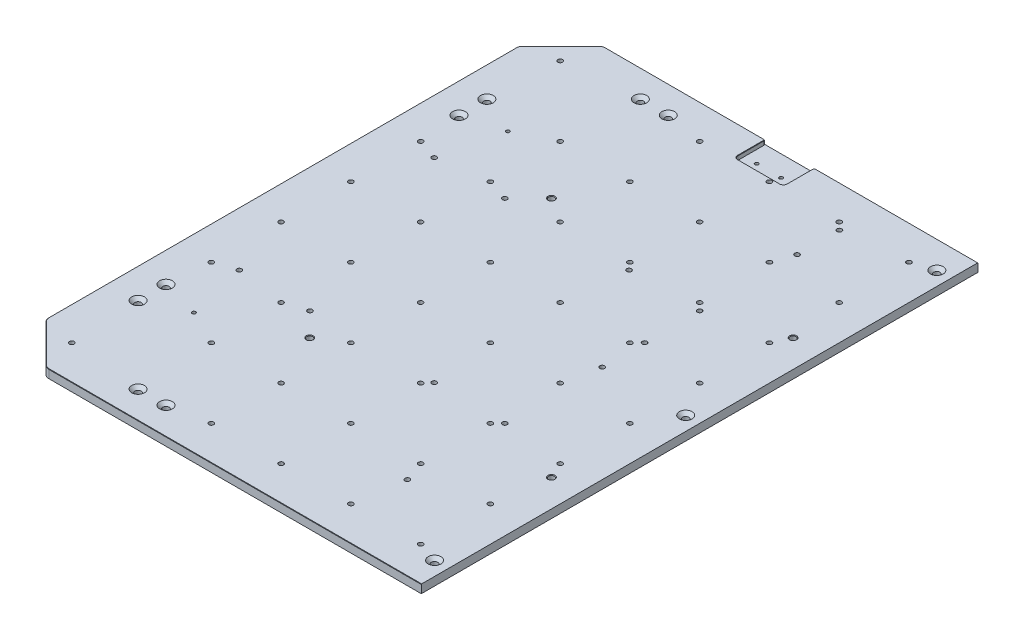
ISO-10303-21;
HEADER;
FILE_DESCRIPTION(('STEP AP214'),'2;1');
FILE_NAME('part.step','',(''),(''),'','','');
FILE_SCHEMA(('AUTOMOTIVE_DESIGN { 1 0 10303 214 1 1 1 1 }'));
ENDSEC;
DATA;
#1=APPLICATION_CONTEXT('core data for automotive mechanical design processes');
#2=APPLICATION_PROTOCOL_DEFINITION('international standard','automotive_design',2000,#1);
#3=PRODUCT_CONTEXT('',#1,'mechanical');
#4=PRODUCT('Part','Part','',(#3));
#5=PRODUCT_RELATED_PRODUCT_CATEGORY('part','',(#4));
#6=PRODUCT_DEFINITION_FORMATION('','',#4);
#7=PRODUCT_DEFINITION_CONTEXT('part definition',#1,'design');
#8=PRODUCT_DEFINITION('design','',#6,#7);
#9=PRODUCT_DEFINITION_SHAPE('','',#8);
#10=(LENGTH_UNIT() NAMED_UNIT(*) SI_UNIT(.MILLI.,.METRE.));
#11=(NAMED_UNIT(*) PLANE_ANGLE_UNIT() SI_UNIT($,.RADIAN.));
#12=(NAMED_UNIT(*) SI_UNIT($,.STERADIAN.) SOLID_ANGLE_UNIT());
#13=UNCERTAINTY_MEASURE_WITH_UNIT(LENGTH_MEASURE(1.E-05),#10,'distance_accuracy_value','');
#14=(GEOMETRIC_REPRESENTATION_CONTEXT(3) GLOBAL_UNCERTAINTY_ASSIGNED_CONTEXT((#13)) GLOBAL_UNIT_ASSIGNED_CONTEXT((#10,
#11,#12)) REPRESENTATION_CONTEXT('',''));
#15=CARTESIAN_POINT('',(0.,0.,0.));
#16=DIRECTION('',(0.,0.,1.));
#17=DIRECTION('',(1.,0.,0.));
#18=AXIS2_PLACEMENT_3D('',#15,#16,#17);
#19=CARTESIAN_POINT('',(0.,0.,0.));
#20=DIRECTION('',(1.,0.,0.));
#21=DIRECTION('',(0.,0.,-1.));
#22=AXIS2_PLACEMENT_3D('',#19,#20,#21);
#23=PLANE('',#22);
#24=DIRECTION('',(0.,0.707106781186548,-0.707106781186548));
#25=VECTOR('',#24,1.);
#26=CARTESIAN_POINT('',(0.,12.,398.5));
#27=LINE('',#26,#25);
#28=CARTESIAN_POINT('',(0.,11.4999999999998,399.));
#29=VERTEX_POINT('',#28);
#30=CARTESIAN_POINT('',(0.,12.,398.5));
#31=VERTEX_POINT('',#30);
#32=EDGE_CURVE('E927',#29,#31,#27,.T.);
#33=ORIENTED_EDGE('',*,*,#32,.F.);
#34=DIRECTION('',(0.,-1.,0.));
#35=VECTOR('',#34,1.);
#36=CARTESIAN_POINT('',(0.,12.,399.));
#37=LINE('',#36,#35);
#38=CARTESIAN_POINT('',(0.,0.,399.));
#39=VERTEX_POINT('',#38);
#40=EDGE_CURVE('E935',#29,#39,#37,.T.);
#41=ORIENTED_EDGE('',*,*,#40,.T.);
#42=DIRECTION('',(0.,0.,-1.));
#43=VECTOR('',#42,1.);
#44=CARTESIAN_POINT('',(0.,0.,0.));
#45=LINE('',#44,#43);
#46=CARTESIAN_POINT('',(0.,0.,-399.));
#47=VERTEX_POINT('',#46);
#48=EDGE_CURVE('E316',#39,#47,#45,.T.);
#49=ORIENTED_EDGE('',*,*,#48,.T.);
#50=DIRECTION('',(0.,1.,0.));
#51=VECTOR('',#50,1.);
#52=CARTESIAN_POINT('',(0.,12.,-399.));
#53=LINE('',#52,#51);
#54=CARTESIAN_POINT('',(0.,11.4999999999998,-399.));
#55=VERTEX_POINT('',#54);
#56=EDGE_CURVE('E932',#47,#55,#53,.T.);
#57=ORIENTED_EDGE('',*,*,#56,.T.);
#58=DIRECTION('',(0.,-0.707106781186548,-0.707106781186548));
#59=VECTOR('',#58,1.);
#60=CARTESIAN_POINT('',(0.,12.,-398.5));
#61=LINE('',#60,#59);
#62=CARTESIAN_POINT('',(0.,12.,-398.5));
#63=VERTEX_POINT('',#62);
#64=EDGE_CURVE('E925',#63,#55,#61,.T.);
#65=ORIENTED_EDGE('',*,*,#64,.F.);
#66=DIRECTION('',(0.,0.,-1.));
#67=VECTOR('',#66,1.);
#68=CARTESIAN_POINT('',(0.,12.,0.));
#69=LINE('',#68,#67);
#70=EDGE_CURVE('E929',#31,#63,#69,.T.);
#71=ORIENTED_EDGE('',*,*,#70,.F.);
#72=EDGE_LOOP('',(#33,#41,#49,#57,#65,#71));
#73=FACE_BOUND('',#72,.T.);
#74=ADVANCED_FACE('F38',(#73),#23,.T.);
#75=CARTESIAN_POINT('',(-305.1,6.,-399.));
#76=DIRECTION('',(-1.,0.,0.));
#77=DIRECTION('',(0.,0.,1.));
#78=AXIS2_PLACEMENT_3D('',#75,#76,#77);
#79=PLANE('',#78);
#80=DIRECTION('',(0.,1.,0.));
#81=VECTOR('',#80,1.);
#82=CARTESIAN_POINT('',(-305.1,6.,-397.));
#83=LINE('',#82,#81);
#84=CARTESIAN_POINT('',(-305.1,6.,-397.));
#85=VERTEX_POINT('',#84);
#86=CARTESIAN_POINT('',(-305.1,11.4999999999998,-397.));
#87=VERTEX_POINT('',#86);
#88=EDGE_CURVE('E436',#85,#87,#83,.T.);
#89=ORIENTED_EDGE('',*,*,#88,.T.);
#90=DIRECTION('',(0.,0.,1.));
#91=VECTOR('',#90,1.);
#92=CARTESIAN_POINT('',(-305.1,11.4999999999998,-360.));
#93=LINE('',#92,#91);
#94=CARTESIAN_POINT('',(-305.1,11.4999999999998,-360.));
#95=VERTEX_POINT('',#94);
#96=EDGE_CURVE('E384',#87,#95,#93,.T.);
#97=ORIENTED_EDGE('',*,*,#96,.T.);
#98=DIRECTION('',(0.,1.,0.));
#99=VECTOR('',#98,1.);
#100=CARTESIAN_POINT('',(-305.1,6.,-360.));
#101=LINE('',#100,#99);
#102=CARTESIAN_POINT('',(-305.1,6.,-360.));
#103=VERTEX_POINT('',#102);
#104=EDGE_CURVE('E850',#103,#95,#101,.T.);
#105=ORIENTED_EDGE('',*,*,#104,.F.);
#106=DIRECTION('',(0.,0.,1.));
#107=VECTOR('',#106,1.);
#108=CARTESIAN_POINT('',(-305.1,6.,-399.));
#109=LINE('',#108,#107);
#110=EDGE_CURVE('E876',#85,#103,#109,.T.);
#111=ORIENTED_EDGE('',*,*,#110,.F.);
#112=EDGE_LOOP('',(#89,#97,#105,#111));
#113=FACE_BOUND('',#112,.T.);
#114=ADVANCED_FACE('F1276',(#113),#79,.F.);
#115=CARTESIAN_POINT('',(-300.1,6.,-360.));
#116=DIRECTION('',(0.,1.,0.));
#117=DIRECTION('',(0.,0.,1.));
#118=AXIS2_PLACEMENT_3D('',#115,#116,#117);
#119=CYLINDRICAL_SURFACE('',#118,5.);
#120=ORIENTED_EDGE('',*,*,#104,.T.);
#121=CARTESIAN_POINT('',(-300.1,11.4999999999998,-360.));
#122=DIRECTION('',(0.,1.,0.));
#123=DIRECTION('',(0.,0.,1.));
#124=AXIS2_PLACEMENT_3D('',#121,#122,#123);
#125=CIRCLE('',#124,5.);
#126=CARTESIAN_POINT('',(-300.1,11.4999999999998,-355.));
#127=VERTEX_POINT('',#126);
#128=EDGE_CURVE('E386',#95,#127,#125,.T.);
#129=ORIENTED_EDGE('',*,*,#128,.T.);
#130=DIRECTION('',(0.,1.,0.));
#131=VECTOR('',#130,1.);
#132=CARTESIAN_POINT('',(-300.1,6.,-355.));
#133=LINE('',#132,#131);
#134=CARTESIAN_POINT('',(-300.1,6.,-355.));
#135=VERTEX_POINT('',#134);
#136=EDGE_CURVE('E854',#135,#127,#133,.T.);
#137=ORIENTED_EDGE('',*,*,#136,.F.);
#138=CARTESIAN_POINT('',(-300.1,6.,-360.));
#139=DIRECTION('',(0.,1.,0.));
#140=DIRECTION('',(0.,0.,-1.));
#141=AXIS2_PLACEMENT_3D('',#138,#139,#140);
#142=CIRCLE('',#141,5.);
#143=EDGE_CURVE('E873',#103,#135,#142,.T.);
#144=ORIENTED_EDGE('',*,*,#143,.F.);
#145=EDGE_LOOP('',(#120,#129,#137,#144));
#146=FACE_BOUND('',#145,.T.);
#147=ADVANCED_FACE('F1278',(#146),#119,.F.);
#148=CARTESIAN_POINT('',(-300.1,6.,-355.));
#149=DIRECTION('',(0.,0.,1.));
#150=DIRECTION('',(1.,0.,0.));
#151=AXIS2_PLACEMENT_3D('',#148,#149,#150);
#152=PLANE('',#151);
#153=ORIENTED_EDGE('',*,*,#136,.T.);
#154=DIRECTION('',(1.,0.,0.));
#155=VECTOR('',#154,1.);
#156=CARTESIAN_POINT('',(-239.9,11.4999999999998,-355.));
#157=LINE('',#156,#155);
#158=CARTESIAN_POINT('',(-239.9,11.4999999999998,-355.));
#159=VERTEX_POINT('',#158);
#160=EDGE_CURVE('E388',#127,#159,#157,.T.);
#161=ORIENTED_EDGE('',*,*,#160,.T.);
#162=DIRECTION('',(0.,1.,0.));
#163=VECTOR('',#162,1.);
#164=CARTESIAN_POINT('',(-239.9,6.,-355.));
#165=LINE('',#164,#163);
#166=CARTESIAN_POINT('',(-239.9,6.,-355.));
#167=VERTEX_POINT('',#166);
#168=EDGE_CURVE('E857',#167,#159,#165,.T.);
#169=ORIENTED_EDGE('',*,*,#168,.F.);
#170=DIRECTION('',(1.,0.,0.));
#171=VECTOR('',#170,1.);
#172=CARTESIAN_POINT('',(-300.1,6.,-355.));
#173=LINE('',#172,#171);
#174=EDGE_CURVE('E870',#135,#167,#173,.T.);
#175=ORIENTED_EDGE('',*,*,#174,.F.);
#176=EDGE_LOOP('',(#153,#161,#169,#175));
#177=FACE_BOUND('',#176,.T.);
#178=ADVANCED_FACE('F1285',(#177),#152,.F.);
#179=CARTESIAN_POINT('',(-239.9,6.,-360.));
#180=DIRECTION('',(0.,1.,0.));
#181=DIRECTION('',(0.,0.,1.));
#182=AXIS2_PLACEMENT_3D('',#179,#180,#181);
#183=CYLINDRICAL_SURFACE('',#182,5.00000000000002);
#184=ORIENTED_EDGE('',*,*,#168,.T.);
#185=CARTESIAN_POINT('',(-239.9,11.4999999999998,-360.));
#186=DIRECTION('',(0.,1.,0.));
#187=DIRECTION('',(0.,0.,1.));
#188=AXIS2_PLACEMENT_3D('',#185,#186,#187);
#189=CIRCLE('',#188,5.00000000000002);
#190=CARTESIAN_POINT('',(-234.9,11.4999999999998,-360.));
#191=VERTEX_POINT('',#190);
#192=EDGE_CURVE('E390',#159,#191,#189,.T.);
#193=ORIENTED_EDGE('',*,*,#192,.T.);
#194=DIRECTION('',(0.,1.,0.));
#195=VECTOR('',#194,1.);
#196=CARTESIAN_POINT('',(-234.9,6.,-360.));
#197=LINE('',#196,#195);
#198=CARTESIAN_POINT('',(-234.9,6.,-360.));
#199=VERTEX_POINT('',#198);
#200=EDGE_CURVE('E849',#199,#191,#197,.T.);
#201=ORIENTED_EDGE('',*,*,#200,.F.);
#202=CARTESIAN_POINT('',(-239.9,6.,-360.));
#203=DIRECTION('',(0.,1.,0.));
#204=DIRECTION('',(0.,0.,-1.));
#205=AXIS2_PLACEMENT_3D('',#202,#203,#204);
#206=CIRCLE('',#205,5.00000000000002);
#207=EDGE_CURVE('E867',#167,#199,#206,.T.);
#208=ORIENTED_EDGE('',*,*,#207,.F.);
#209=EDGE_LOOP('',(#184,#193,#201,#208));
#210=FACE_BOUND('',#209,.T.);
#211=ADVANCED_FACE('F1296',(#210),#183,.F.);
#212=CARTESIAN_POINT('',(-234.9,6.,-399.));
#213=DIRECTION('',(1.,0.,0.));
#214=DIRECTION('',(0.,0.,-1.));
#215=AXIS2_PLACEMENT_3D('',#212,#213,#214);
#216=PLANE('',#215);
#217=ORIENTED_EDGE('',*,*,#200,.T.);
#218=DIRECTION('',(0.,0.,-1.));
#219=VECTOR('',#218,1.);
#220=CARTESIAN_POINT('',(-234.9,11.4999999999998,-397.));
#221=LINE('',#220,#219);
#222=CARTESIAN_POINT('',(-234.9,11.4999999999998,-397.));
#223=VERTEX_POINT('',#222);
#224=EDGE_CURVE('E392',#191,#223,#221,.T.);
#225=ORIENTED_EDGE('',*,*,#224,.T.);
#226=DIRECTION('',(0.,1.,0.));
#227=VECTOR('',#226,1.);
#228=CARTESIAN_POINT('',(-234.9,6.,-397.));
#229=LINE('',#228,#227);
#230=CARTESIAN_POINT('',(-234.9,6.,-397.));
#231=VERTEX_POINT('',#230);
#232=EDGE_CURVE('E439',#223,#231,#229,.F.);
#233=ORIENTED_EDGE('',*,*,#232,.T.);
#234=DIRECTION('',(0.,0.,-1.));
#235=VECTOR('',#234,1.);
#236=CARTESIAN_POINT('',(-234.9,6.,-399.));
#237=LINE('',#236,#235);
#238=EDGE_CURVE('E864',#199,#231,#237,.T.);
#239=ORIENTED_EDGE('',*,*,#238,.F.);
#240=EDGE_LOOP('',(#217,#225,#233,#239));
#241=FACE_BOUND('',#240,.T.);
#242=ADVANCED_FACE('F1206',(#241),#216,.F.);
#243=CARTESIAN_POINT('',(-500.,4.,225.));
#244=DIRECTION('',(0.,1.,0.));
#245=DIRECTION('',(0.,0.,1.));
#246=AXIS2_PLACEMENT_3D('',#243,#244,#245);
#247=CONICAL_SURFACE('',#246,2.5,1.02974425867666);
#248=CARTESIAN_POINT('',(-500.,2.4978484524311,225.));
#249=VERTEX_POINT('',#248);
#250=VERTEX_LOOP('',#249);
#251=FACE_BOUND('',#250,.T.);
#252=CARTESIAN_POINT('',(-500.,4.,225.));
#253=DIRECTION('',(0.,1.,0.));
#254=DIRECTION('',(0.,0.,1.));
#255=AXIS2_PLACEMENT_3D('',#252,#253,#254);
#256=CIRCLE('',#255,2.5);
#257=CARTESIAN_POINT('',(-500.,4.,227.5));
#258=VERTEX_POINT('',#257);
#259=EDGE_CURVE('E920',#258,#258,#256,.T.);
#260=ORIENTED_EDGE('',*,*,#259,.T.);
#261=EDGE_LOOP('',(#260));
#262=FACE_BOUND('',#261,.T.);
#263=ADVANCED_FACE('F1302',(#251,#262),#247,.F.);
#264=CARTESIAN_POINT('',(-500.,4.,-225.));
#265=DIRECTION('',(0.,1.,0.));
#266=DIRECTION('',(0.,0.,1.));
#267=AXIS2_PLACEMENT_3D('',#264,#265,#266);
#268=CONICAL_SURFACE('',#267,2.5,1.02974425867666);
#269=CARTESIAN_POINT('',(-500.,2.4978484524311,-225.));
#270=VERTEX_POINT('',#269);
#271=VERTEX_LOOP('',#270);
#272=FACE_BOUND('',#271,.T.);
#273=CARTESIAN_POINT('',(-500.,4.,-225.));
#274=DIRECTION('',(0.,1.,0.));
#275=DIRECTION('',(0.,0.,1.));
#276=AXIS2_PLACEMENT_3D('',#273,#274,#275);
#277=CIRCLE('',#276,2.5);
#278=CARTESIAN_POINT('',(-500.,4.,-222.5));
#279=VERTEX_POINT('',#278);
#280=EDGE_CURVE('E914',#279,#279,#277,.T.);
#281=ORIENTED_EDGE('',*,*,#280,.T.);
#282=EDGE_LOOP('',(#281));
#283=FACE_BOUND('',#282,.T.);
#284=ADVANCED_FACE('F1331',(#272,#283),#268,.F.);
#285=CARTESIAN_POINT('',(-232.9,12.,-397.));
#286=DIRECTION('',(0.,1.,0.));
#287=DIRECTION('',(0.,0.,1.));
#288=AXIS2_PLACEMENT_3D('',#285,#286,#287);
#289=CYLINDRICAL_SURFACE('',#288,2.);
#290=ORIENTED_EDGE('',*,*,#232,.F.);
#291=CARTESIAN_POINT('',(-232.9,11.4999999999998,-397.));
#292=DIRECTION('',(0.,1.,0.));
#293=DIRECTION('',(0.,0.,1.));
#294=AXIS2_PLACEMENT_3D('',#291,#292,#293);
#295=CIRCLE('',#294,2.);
#296=CARTESIAN_POINT('',(-232.9,11.4999999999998,-399.));
#297=VERTEX_POINT('',#296);
#298=EDGE_CURVE('E394',#223,#297,#295,.F.);
#299=ORIENTED_EDGE('',*,*,#298,.T.);
#300=DIRECTION('',(0.,1.,0.));
#301=VECTOR('',#300,1.);
#302=CARTESIAN_POINT('',(-232.9,12.,-399.));
#303=LINE('',#302,#301);
#304=CARTESIAN_POINT('',(-232.9,6.,-399.));
#305=VERTEX_POINT('',#304);
#306=EDGE_CURVE('E441',#305,#297,#303,.T.);
#307=ORIENTED_EDGE('',*,*,#306,.F.);
#308=CARTESIAN_POINT('',(-232.9,6.,-397.));
#309=DIRECTION('',(0.,-1.,0.));
#310=DIRECTION('',(0.,0.,-1.));
#311=AXIS2_PLACEMENT_3D('',#308,#309,#310);
#312=CIRCLE('',#311,2.);
#313=EDGE_CURVE('E433',#231,#305,#312,.T.);
#314=ORIENTED_EDGE('',*,*,#313,.F.);
#315=EDGE_LOOP('',(#290,#299,#307,#314));
#316=FACE_BOUND('',#315,.T.);
#317=ADVANCED_FACE('F1196',(#316),#289,.T.);
#318=CARTESIAN_POINT('',(-300.1,6.,-360.));
#319=DIRECTION('',(0.,-1.,0.));
#320=DIRECTION('',(0.,0.,-1.));
#321=AXIS2_PLACEMENT_3D('',#318,#319,#320);
#322=PLANE('',#321);
#323=CARTESIAN_POINT('',(-287.5,6.,-369.2));
#324=DIRECTION('',(0.,1.,0.));
#325=DIRECTION('',(0.,0.,1.));
#326=AXIS2_PLACEMENT_3D('',#323,#324,#325);
#327=CIRCLE('',#326,2.5);
#328=CARTESIAN_POINT('',(-287.5,6.,-366.7));
#329=VERTEX_POINT('',#328);
#330=EDGE_CURVE('E887',#329,#329,#327,.T.);
#331=ORIENTED_EDGE('',*,*,#330,.F.);
#332=EDGE_LOOP('',(#331));
#333=FACE_BOUND('',#332,.T.);
#334=CARTESIAN_POINT('',(-252.5,6.,-369.2));
#335=DIRECTION('',(0.,1.,0.));
#336=DIRECTION('',(0.,0.,1.));
#337=AXIS2_PLACEMENT_3D('',#334,#335,#336);
#338=CIRCLE('',#337,2.5);
#339=CARTESIAN_POINT('',(-252.5,6.,-366.7));
#340=VERTEX_POINT('',#339);
#341=EDGE_CURVE('E881',#340,#340,#338,.T.);
#342=ORIENTED_EDGE('',*,*,#341,.F.);
#343=EDGE_LOOP('',(#342));
#344=FACE_BOUND('',#343,.T.);
#345=DIRECTION('',(-1.,0.,0.));
#346=VECTOR('',#345,1.);
#347=CARTESIAN_POINT('',(-305.1,6.,-399.));
#348=LINE('',#347,#346);
#349=CARTESIAN_POINT('',(-307.1,6.,-399.));
#350=VERTEX_POINT('',#349);
#351=EDGE_CURVE('E853',#305,#350,#348,.T.);
#352=ORIENTED_EDGE('',*,*,#351,.T.);
#353=CARTESIAN_POINT('',(-307.1,6.,-397.));
#354=DIRECTION('',(0.,-1.,0.));
#355=DIRECTION('',(0.,0.,-1.));
#356=AXIS2_PLACEMENT_3D('',#353,#354,#355);
#357=CIRCLE('',#356,2.);
#358=EDGE_CURVE('E431',#350,#85,#357,.T.);
#359=ORIENTED_EDGE('',*,*,#358,.T.);
#360=ORIENTED_EDGE('',*,*,#110,.T.);
#361=ORIENTED_EDGE('',*,*,#143,.T.);
#362=ORIENTED_EDGE('',*,*,#174,.T.);
#363=ORIENTED_EDGE('',*,*,#207,.T.);
#364=ORIENTED_EDGE('',*,*,#238,.T.);
#365=ORIENTED_EDGE('',*,*,#313,.T.);
#366=EDGE_LOOP('',(#352,#359,#360,#361,#362,#363,#364,#365));
#367=FACE_BOUND('',#366,.T.);
#368=ADVANCED_FACE('F1202',(#333,#344,#367),#322,.F.);
#369=CARTESIAN_POINT('',(-307.1,6.,-397.));
#370=DIRECTION('',(0.,1.,0.));
#371=DIRECTION('',(0.,0.,1.));
#372=AXIS2_PLACEMENT_3D('',#369,#370,#371);
#373=CYLINDRICAL_SURFACE('',#372,2.);
#374=DIRECTION('',(0.,1.,0.));
#375=VECTOR('',#374,1.);
#376=CARTESIAN_POINT('',(-307.1,12.,-399.));
#377=LINE('',#376,#375);
#378=CARTESIAN_POINT('',(-307.1,11.4999999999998,-399.));
#379=VERTEX_POINT('',#378);
#380=EDGE_CURVE('E444',#379,#350,#377,.F.);
#381=ORIENTED_EDGE('',*,*,#380,.F.);
#382=CARTESIAN_POINT('',(-307.1,11.4999999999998,-397.));
#383=DIRECTION('',(0.,1.,0.));
#384=DIRECTION('',(0.,0.,1.));
#385=AXIS2_PLACEMENT_3D('',#382,#383,#384);
#386=CIRCLE('',#385,2.);
#387=EDGE_CURVE('E382',#379,#87,#386,.F.);
#388=ORIENTED_EDGE('',*,*,#387,.T.);
#389=ORIENTED_EDGE('',*,*,#88,.F.);
#390=ORIENTED_EDGE('',*,*,#358,.F.);
#391=EDGE_LOOP('',(#381,#388,#389,#390));
#392=FACE_BOUND('',#391,.T.);
#393=ADVANCED_FACE('F1266',(#392),#373,.T.);
#394=CARTESIAN_POINT('',(-468.146446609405,12.,468.146446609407));
#395=DIRECTION('',(-0.499999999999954,0.707106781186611,0.499999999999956));
#396=DIRECTION('',(-0.707106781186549,0.,-0.707106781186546));
#397=AXIS2_PLACEMENT_3D('',#394,#395,#396);
#398=PLANE('',#397);
#399=DIRECTION('',(0.500000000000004,0.707106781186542,-0.500000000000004));
#400=VECTOR('',#399,1.);
#401=CARTESIAN_POINT('',(-540.928932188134,11.4999999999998,396.071067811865));
#402=LINE('',#401,#400);
#403=CARTESIAN_POINT('',(-540.928932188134,11.4999999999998,396.071067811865));
#404=VERTEX_POINT('',#403);
#405=CARTESIAN_POINT('',(-540.575378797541,12.,395.717514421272));
#406=VERTEX_POINT('',#405);
#407=EDGE_CURVE('E320',#404,#406,#402,.T.);
#408=ORIENTED_EDGE('',*,*,#407,.T.);
#409=DIRECTION('',(0.707106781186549,0.,0.707106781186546));
#410=VECTOR('',#409,1.);
#411=CARTESIAN_POINT('',(-540.575378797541,12.,395.717514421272));
#412=LINE('',#411,#410);
#413=CARTESIAN_POINT('',(-594.717514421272,12.,341.575378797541));
#414=VERTEX_POINT('',#413);
#415=EDGE_CURVE('E426',#414,#406,#412,.T.);
#416=ORIENTED_EDGE('',*,*,#415,.F.);
#417=DIRECTION('',(0.500000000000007,0.707106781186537,-0.500000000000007));
#418=VECTOR('',#417,1.);
#419=CARTESIAN_POINT('',(-595.071067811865,11.4999999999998,341.928932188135));
#420=LINE('',#419,#418);
#421=CARTESIAN_POINT('',(-595.071067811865,11.4999999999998,341.928932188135));
#422=VERTEX_POINT('',#421);
#423=EDGE_CURVE('E324',#422,#414,#420,.T.);
#424=ORIENTED_EDGE('',*,*,#423,.F.);
#425=DIRECTION('',(-0.707106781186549,0.,-0.707106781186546));
#426=VECTOR('',#425,1.);
#427=CARTESIAN_POINT('',(-595.071067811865,11.4999999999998,341.928932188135));
#428=LINE('',#427,#426);
#429=EDGE_CURVE('E369',#404,#422,#428,.T.);
#430=ORIENTED_EDGE('',*,*,#429,.F.);
#431=EDGE_LOOP('',(#408,#416,#424,#430));
#432=FACE_BOUND('',#431,.T.);
#433=ADVANCED_FACE('F1264',(#432),#398,.T.);
#434=CARTESIAN_POINT('',(-588.,12.,334.857864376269));
#435=DIRECTION('',(0.,-1.,0.));
#436=DIRECTION('',(0.,0.,-1.));
#437=AXIS2_PLACEMENT_3D('',#434,#435,#436);
#438=CONICAL_SURFACE('',#437,9.49999999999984,0.78539816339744);
#439=ORIENTED_EDGE('',*,*,#423,.T.);
#440=CARTESIAN_POINT('',(-588.,12.,334.857864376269));
#441=DIRECTION('',(0.,1.,0.));
#442=DIRECTION('',(0.,0.,1.));
#443=AXIS2_PLACEMENT_3D('',#440,#441,#442);
#444=CIRCLE('',#443,9.49999999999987);
#445=CARTESIAN_POINT('',(-597.5,12.,334.857864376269));
#446=VERTEX_POINT('',#445);
#447=EDGE_CURVE('E424',#446,#414,#444,.T.);
#448=ORIENTED_EDGE('',*,*,#447,.F.);
#449=DIRECTION('',(0.707106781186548,0.707106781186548,0.));
#450=VECTOR('',#449,1.);
#451=CARTESIAN_POINT('',(-598.,11.4999999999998,334.857864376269));
#452=LINE('',#451,#450);
#453=CARTESIAN_POINT('',(-598.,11.4999999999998,334.857864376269));
#454=VERTEX_POINT('',#453);
#455=EDGE_CURVE('E327',#454,#446,#452,.T.);
#456=ORIENTED_EDGE('',*,*,#455,.F.);
#457=CARTESIAN_POINT('',(-588.,11.4999999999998,334.857864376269));
#458=DIRECTION('',(0.,1.,0.));
#459=DIRECTION('',(0.,0.,1.));
#460=AXIS2_PLACEMENT_3D('',#457,#458,#459);
#461=CIRCLE('',#460,10.);
#462=EDGE_CURVE('E372',#422,#454,#461,.F.);
#463=ORIENTED_EDGE('',*,*,#462,.F.);
#464=EDGE_LOOP('',(#439,#448,#456,#463));
#465=FACE_BOUND('',#464,.T.);
#466=ADVANCED_FACE('F1260',(#465),#438,.T.);
#467=CARTESIAN_POINT('',(-597.5,12.,0.));
#468=DIRECTION('',(-0.707106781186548,0.707106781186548,0.));
#469=DIRECTION('',(0.,0.,-1.));
#470=AXIS2_PLACEMENT_3D('',#467,#468,#469);
#471=PLANE('',#470);
#472=ORIENTED_EDGE('',*,*,#455,.T.);
#473=DIRECTION('',(0.,0.,1.));
#474=VECTOR('',#473,1.);
#475=CARTESIAN_POINT('',(-597.5,12.,334.857864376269));
#476=LINE('',#475,#474);
#477=CARTESIAN_POINT('',(-597.5,12.,-334.857864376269));
#478=VERTEX_POINT('',#477);
#479=EDGE_CURVE('E422',#478,#446,#476,.T.);
#480=ORIENTED_EDGE('',*,*,#479,.F.);
#481=DIRECTION('',(0.707106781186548,0.707106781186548,0.));
#482=VECTOR('',#481,1.);
#483=CARTESIAN_POINT('',(-598.,11.4999999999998,-334.857864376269));
#484=LINE('',#483,#482);
#485=CARTESIAN_POINT('',(-598.,11.4999999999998,-334.857864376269));
#486=VERTEX_POINT('',#485);
#487=EDGE_CURVE('E330',#486,#478,#484,.T.);
#488=ORIENTED_EDGE('',*,*,#487,.F.);
#489=DIRECTION('',(0.,0.,-1.));
#490=VECTOR('',#489,1.);
#491=CARTESIAN_POINT('',(-598.,11.4999999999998,-334.857864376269));
#492=LINE('',#491,#490);
#493=EDGE_CURVE('E374',#454,#486,#492,.T.);
#494=ORIENTED_EDGE('',*,*,#493,.F.);
#495=EDGE_LOOP('',(#472,#480,#488,#494));
#496=FACE_BOUND('',#495,.T.);
#497=ADVANCED_FACE('F1255',(#496),#471,.T.);
#498=CARTESIAN_POINT('',(-588.,12.,-334.857864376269));
#499=DIRECTION('',(0.,-1.,0.));
#500=DIRECTION('',(0.,0.,-1.));
#501=AXIS2_PLACEMENT_3D('',#498,#499,#500);
#502=CONICAL_SURFACE('',#501,9.49999999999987,0.785398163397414);
#503=ORIENTED_EDGE('',*,*,#487,.T.);
#504=CARTESIAN_POINT('',(-588.,12.,-334.857864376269));
#505=DIRECTION('',(0.,1.,0.));
#506=DIRECTION('',(0.,0.,1.));
#507=AXIS2_PLACEMENT_3D('',#504,#505,#506);
#508=CIRCLE('',#507,9.49999999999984);
#509=CARTESIAN_POINT('',(-594.717514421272,12.,-341.575378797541));
#510=VERTEX_POINT('',#509);
#511=EDGE_CURVE('E420',#510,#478,#508,.T.);
#512=ORIENTED_EDGE('',*,*,#511,.F.);
#513=DIRECTION('',(0.500000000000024,0.70710678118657,0.499999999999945));
#514=VECTOR('',#513,1.);
#515=CARTESIAN_POINT('',(-595.071067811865,11.4999999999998,-341.928932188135));
#516=LINE('',#515,#514);
#517=CARTESIAN_POINT('',(-595.071067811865,11.4999999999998,-341.928932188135));
#518=VERTEX_POINT('',#517);
#519=EDGE_CURVE('E333',#518,#510,#516,.T.);
#520=ORIENTED_EDGE('',*,*,#519,.F.);
#521=CARTESIAN_POINT('',(-588.,11.4999999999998,-334.857864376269));
#522=DIRECTION('',(0.,1.,0.));
#523=DIRECTION('',(0.,0.,1.));
#524=AXIS2_PLACEMENT_3D('',#521,#522,#523);
#525=CIRCLE('',#524,10.);
#526=EDGE_CURVE('E376',#486,#518,#525,.F.);
#527=ORIENTED_EDGE('',*,*,#526,.F.);
#528=EDGE_LOOP('',(#503,#512,#520,#527));
#529=FACE_BOUND('',#528,.T.);
#530=ADVANCED_FACE('F1250',(#529),#502,.T.);
#531=CARTESIAN_POINT('',(-468.146446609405,12.,-468.146446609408));
#532=DIRECTION('',(-0.500000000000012,0.707106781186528,-0.500000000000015));
#533=DIRECTION('',(0.707106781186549,0.,-0.707106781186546));
#534=AXIS2_PLACEMENT_3D('',#531,#532,#533);
#535=PLANE('',#534);
#536=ORIENTED_EDGE('',*,*,#519,.T.);
#537=DIRECTION('',(-0.707106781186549,0.,0.707106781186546));
#538=VECTOR('',#537,1.);
#539=CARTESIAN_POINT('',(-594.717514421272,12.,-341.575378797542));
#540=LINE('',#539,#538);
#541=CARTESIAN_POINT('',(-540.575378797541,12.,-395.717514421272));
#542=VERTEX_POINT('',#541);
#543=EDGE_CURVE('E418',#542,#510,#540,.T.);
#544=ORIENTED_EDGE('',*,*,#543,.F.);
#545=DIRECTION('',(0.500000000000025,0.707106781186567,0.499999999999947));
#546=VECTOR('',#545,1.);
#547=CARTESIAN_POINT('',(-540.928932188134,11.4999999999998,-396.071067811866));
#548=LINE('',#547,#546);
#549=CARTESIAN_POINT('',(-540.928932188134,11.4999999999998,-396.071067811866));
#550=VERTEX_POINT('',#549);
#551=EDGE_CURVE('E336',#550,#542,#548,.T.);
#552=ORIENTED_EDGE('',*,*,#551,.F.);
#553=DIRECTION('',(0.707106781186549,0.,-0.707106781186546));
#554=VECTOR('',#553,1.);
#555=CARTESIAN_POINT('',(-540.928932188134,11.4999999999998,-396.071067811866));
#556=LINE('',#555,#554);
#557=EDGE_CURVE('E378',#518,#550,#556,.T.);
#558=ORIENTED_EDGE('',*,*,#557,.F.);
#559=EDGE_LOOP('',(#536,#544,#552,#558));
#560=FACE_BOUND('',#559,.T.);
#561=ADVANCED_FACE('F1245',(#560),#535,.T.);
#562=CARTESIAN_POINT('',(-533.857864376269,12.,-389.));
#563=DIRECTION('',(0.,-1.,0.));
#564=DIRECTION('',(0.,0.,-1.));
#565=AXIS2_PLACEMENT_3D('',#562,#563,#564);
#566=CONICAL_SURFACE('',#565,9.49999999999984,0.78539816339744);
#567=ORIENTED_EDGE('',*,*,#551,.T.);
#568=CARTESIAN_POINT('',(-533.857864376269,12.,-389.));
#569=DIRECTION('',(0.,1.,0.));
#570=DIRECTION('',(0.,0.,1.));
#571=AXIS2_PLACEMENT_3D('',#568,#569,#570);
#572=CIRCLE('',#571,9.49999999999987);
#573=CARTESIAN_POINT('',(-533.857864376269,12.,-398.5));
#574=VERTEX_POINT('',#573);
#575=EDGE_CURVE('E416',#574,#542,#572,.T.);
#576=ORIENTED_EDGE('',*,*,#575,.F.);
#577=DIRECTION('',(0.,0.707106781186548,0.707106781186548));
#578=VECTOR('',#577,1.);
#579=CARTESIAN_POINT('',(-533.857864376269,11.4999999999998,-399.));
#580=LINE('',#579,#578);
#581=CARTESIAN_POINT('',(-533.857864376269,11.4999999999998,-399.));
#582=VERTEX_POINT('',#581);
#583=EDGE_CURVE('E339',#582,#574,#580,.T.);
#584=ORIENTED_EDGE('',*,*,#583,.F.);
#585=CARTESIAN_POINT('',(-533.857864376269,11.4999999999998,-389.));
#586=DIRECTION('',(0.,1.,0.));
#587=DIRECTION('',(0.,0.,1.));
#588=AXIS2_PLACEMENT_3D('',#585,#586,#587);
#589=CIRCLE('',#588,10.);
#590=EDGE_CURVE('E380',#550,#582,#589,.F.);
#591=ORIENTED_EDGE('',*,*,#590,.F.);
#592=EDGE_LOOP('',(#567,#576,#584,#591));
#593=FACE_BOUND('',#592,.T.);
#594=ADVANCED_FACE('F1240',(#593),#566,.T.);
#595=CARTESIAN_POINT('',(0.,12.,-398.5));
#596=DIRECTION('',(0.,0.707106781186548,-0.707106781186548));
#597=DIRECTION('',(1.,0.,0.));
#598=AXIS2_PLACEMENT_3D('',#595,#596,#597);
#599=PLANE('',#598);
#600=ORIENTED_EDGE('',*,*,#583,.T.);
#601=DIRECTION('',(-1.,0.,0.));
#602=VECTOR('',#601,1.);
#603=CARTESIAN_POINT('',(-533.857864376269,12.,-398.5));
#604=LINE('',#603,#602);
#605=CARTESIAN_POINT('',(-307.1,12.,-398.5));
#606=VERTEX_POINT('',#605);
#607=EDGE_CURVE('E414',#606,#574,#604,.T.);
#608=ORIENTED_EDGE('',*,*,#607,.F.);
#609=DIRECTION('',(0.,0.707106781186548,0.707106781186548));
#610=VECTOR('',#609,1.);
#611=CARTESIAN_POINT('',(-307.1,11.4999999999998,-399.));
#612=LINE('',#611,#610);
#613=EDGE_CURVE('E342',#379,#606,#612,.T.);
#614=ORIENTED_EDGE('',*,*,#613,.F.);
#615=DIRECTION('',(1.,0.,0.));
#616=VECTOR('',#615,1.);
#617=CARTESIAN_POINT('',(-307.1,11.4999999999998,-399.));
#618=LINE('',#617,#616);
#619=EDGE_CURVE('E397',#582,#379,#618,.T.);
#620=ORIENTED_EDGE('',*,*,#619,.F.);
#621=EDGE_LOOP('',(#600,#608,#614,#620));
#622=FACE_BOUND('',#621,.T.);
#623=ADVANCED_FACE('F1235',(#622),#599,.T.);
#624=CARTESIAN_POINT('',(-307.1,12.,-397.));
#625=DIRECTION('',(0.,-1.,0.));
#626=DIRECTION('',(0.,0.,-1.));
#627=AXIS2_PLACEMENT_3D('',#624,#625,#626);
#628=CONICAL_SURFACE('',#627,1.49999999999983,0.785398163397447);
#629=ORIENTED_EDGE('',*,*,#613,.T.);
#630=CARTESIAN_POINT('',(-307.1,12.,-397.));
#631=DIRECTION('',(0.,1.,0.));
#632=DIRECTION('',(0.,0.,1.));
#633=AXIS2_PLACEMENT_3D('',#630,#631,#632);
#634=CIRCLE('',#633,1.49999999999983);
#635=CARTESIAN_POINT('',(-305.6,12.,-397.));
#636=VERTEX_POINT('',#635);
#637=EDGE_CURVE('E412',#636,#606,#634,.T.);
#638=ORIENTED_EDGE('',*,*,#637,.F.);
#639=DIRECTION('',(-0.707106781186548,0.707106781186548,0.));
#640=VECTOR('',#639,1.);
#641=CARTESIAN_POINT('',(-305.1,11.4999999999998,-397.));
#642=LINE('',#641,#640);
#643=EDGE_CURVE('E345',#87,#636,#642,.T.);
#644=ORIENTED_EDGE('',*,*,#643,.F.);
#645=ORIENTED_EDGE('',*,*,#387,.F.);
#646=EDGE_LOOP('',(#629,#638,#644,#645));
#647=FACE_BOUND('',#646,.T.);
#648=ADVANCED_FACE('F1230',(#647),#628,.T.);
#649=CARTESIAN_POINT('',(-305.1,11.4999999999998,-399.));
#650=DIRECTION('',(0.707106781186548,0.707106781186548,0.));
#651=DIRECTION('',(0.,0.,-1.));
#652=AXIS2_PLACEMENT_3D('',#649,#650,#651);
#653=PLANE('',#652);
#654=ORIENTED_EDGE('',*,*,#643,.T.);
#655=DIRECTION('',(0.,0.,-1.));
#656=VECTOR('',#655,1.);
#657=CARTESIAN_POINT('',(-305.6,12.,-397.));
#658=LINE('',#657,#656);
#659=CARTESIAN_POINT('',(-305.6,12.,-360.));
#660=VERTEX_POINT('',#659);
#661=EDGE_CURVE('E410',#660,#636,#658,.T.);
#662=ORIENTED_EDGE('',*,*,#661,.F.);
#663=DIRECTION('',(-0.707106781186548,0.707106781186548,0.));
#664=VECTOR('',#663,1.);
#665=CARTESIAN_POINT('',(-305.1,11.4999999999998,-360.));
#666=LINE('',#665,#664);
#667=EDGE_CURVE('E348',#95,#660,#666,.T.);
#668=ORIENTED_EDGE('',*,*,#667,.F.);
#669=ORIENTED_EDGE('',*,*,#96,.F.);
#670=EDGE_LOOP('',(#654,#662,#668,#669));
#671=FACE_BOUND('',#670,.T.);
#672=ADVANCED_FACE('F1225',(#671),#653,.T.);
#673=CARTESIAN_POINT('',(-300.1,11.4999999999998,-360.));
#674=DIRECTION('',(0.,1.,0.));
#675=DIRECTION('',(0.,0.,1.));
#676=AXIS2_PLACEMENT_3D('',#673,#674,#675);
#677=CONICAL_SURFACE('',#676,5.,0.785398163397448);
#678=ORIENTED_EDGE('',*,*,#667,.T.);
#679=CARTESIAN_POINT('',(-300.1,12.,-360.));
#680=DIRECTION('',(0.,1.,0.));
#681=DIRECTION('',(0.,0.,1.));
#682=AXIS2_PLACEMENT_3D('',#679,#680,#681);
#683=CIRCLE('',#682,5.50000000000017);
#684=CARTESIAN_POINT('',(-300.1,12.,-354.5));
#685=VERTEX_POINT('',#684);
#686=EDGE_CURVE('E408',#685,#660,#683,.F.);
#687=ORIENTED_EDGE('',*,*,#686,.F.);
#688=DIRECTION('',(0.,0.707106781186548,0.707106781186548));
#689=VECTOR('',#688,1.);
#690=CARTESIAN_POINT('',(-300.1,11.4999999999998,-355.));
#691=LINE('',#690,#689);
#692=EDGE_CURVE('E351',#127,#685,#691,.T.);
#693=ORIENTED_EDGE('',*,*,#692,.F.);
#694=ORIENTED_EDGE('',*,*,#128,.F.);
#695=EDGE_LOOP('',(#678,#687,#693,#694));
#696=FACE_BOUND('',#695,.T.);
#697=ADVANCED_FACE('F1220',(#696),#677,.F.);
#698=CARTESIAN_POINT('',(-300.1,11.4999999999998,-355.));
#699=DIRECTION('',(0.,0.707106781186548,-0.707106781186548));
#700=DIRECTION('',(-1.,0.,0.));
#701=AXIS2_PLACEMENT_3D('',#698,#699,#700);
#702=PLANE('',#701);
#703=ORIENTED_EDGE('',*,*,#692,.T.);
#704=DIRECTION('',(-1.,0.,0.));
#705=VECTOR('',#704,1.);
#706=CARTESIAN_POINT('',(-300.1,12.,-354.5));
#707=LINE('',#706,#705);
#708=CARTESIAN_POINT('',(-239.9,12.,-354.5));
#709=VERTEX_POINT('',#708);
#710=EDGE_CURVE('E406',#709,#685,#707,.T.);
#711=ORIENTED_EDGE('',*,*,#710,.F.);
#712=DIRECTION('',(0.,0.707106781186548,0.707106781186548));
#713=VECTOR('',#712,1.);
#714=CARTESIAN_POINT('',(-239.9,11.4999999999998,-355.));
#715=LINE('',#714,#713);
#716=EDGE_CURVE('E354',#159,#709,#715,.T.);
#717=ORIENTED_EDGE('',*,*,#716,.F.);
#718=ORIENTED_EDGE('',*,*,#160,.F.);
#719=EDGE_LOOP('',(#703,#711,#717,#718));
#720=FACE_BOUND('',#719,.T.);
#721=ADVANCED_FACE('F1215',(#720),#702,.T.);
#722=CARTESIAN_POINT('',(-239.9,11.4999999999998,-360.));
#723=DIRECTION('',(0.,1.,0.));
#724=DIRECTION('',(0.,0.,1.));
#725=AXIS2_PLACEMENT_3D('',#722,#723,#724);
#726=CONICAL_SURFACE('',#725,5.00000000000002,0.785398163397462);
#727=ORIENTED_EDGE('',*,*,#716,.T.);
#728=CARTESIAN_POINT('',(-239.9,12.,-360.));
#729=DIRECTION('',(0.,1.,0.));
#730=DIRECTION('',(0.,0.,1.));
#731=AXIS2_PLACEMENT_3D('',#728,#729,#730);
#732=CIRCLE('',#731,5.50000000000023);
#733=CARTESIAN_POINT('',(-234.4,12.,-360.));
#734=VERTEX_POINT('',#733);
#735=EDGE_CURVE('E404',#734,#709,#732,.F.);
#736=ORIENTED_EDGE('',*,*,#735,.F.);
#737=DIRECTION('',(0.707106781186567,0.707106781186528,0.));
#738=VECTOR('',#737,1.);
#739=CARTESIAN_POINT('',(-234.9,11.4999999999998,-360.));
#740=LINE('',#739,#738);
#741=EDGE_CURVE('E357',#191,#734,#740,.T.);
#742=ORIENTED_EDGE('',*,*,#741,.F.);
#743=ORIENTED_EDGE('',*,*,#192,.F.);
#744=EDGE_LOOP('',(#727,#736,#742,#743));
#745=FACE_BOUND('',#744,.T.);
#746=ADVANCED_FACE('F1210',(#745),#726,.F.);
#747=CARTESIAN_POINT('',(-234.9,11.4999999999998,-399.));
#748=DIRECTION('',(-0.707106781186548,0.707106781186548,0.));
#749=DIRECTION('',(0.,0.,1.));
#750=AXIS2_PLACEMENT_3D('',#747,#748,#749);
#751=PLANE('',#750);
#752=ORIENTED_EDGE('',*,*,#741,.T.);
#753=DIRECTION('',(0.,0.,1.));
#754=VECTOR('',#753,1.);
#755=CARTESIAN_POINT('',(-234.4,12.,-360.));
#756=LINE('',#755,#754);
#757=CARTESIAN_POINT('',(-234.4,12.,-397.));
#758=VERTEX_POINT('',#757);
#759=EDGE_CURVE('E402',#758,#734,#756,.T.);
#760=ORIENTED_EDGE('',*,*,#759,.F.);
#761=DIRECTION('',(0.707106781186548,0.707106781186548,0.));
#762=VECTOR('',#761,1.);
#763=CARTESIAN_POINT('',(-234.9,11.4999999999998,-397.));
#764=LINE('',#763,#762);
#765=EDGE_CURVE('E360',#223,#758,#764,.T.);
#766=ORIENTED_EDGE('',*,*,#765,.F.);
#767=ORIENTED_EDGE('',*,*,#224,.F.);
#768=EDGE_LOOP('',(#752,#760,#766,#767));
#769=FACE_BOUND('',#768,.T.);
#770=ADVANCED_FACE('F1188',(#769),#751,.T.);
#771=CARTESIAN_POINT('',(-500.,12.,225.));
#772=DIRECTION('',(0.,1.,0.));
#773=DIRECTION('',(0.,0.,1.));
#774=AXIS2_PLACEMENT_3D('',#771,#772,#773);
#775=CYLINDRICAL_SURFACE('',#774,2.5);
#776=ORIENTED_EDGE('',*,*,#259,.F.);
#777=EDGE_LOOP('',(#776));
#778=FACE_BOUND('',#777,.T.);
#779=CARTESIAN_POINT('',(-500.,12.,225.));
#780=DIRECTION('',(0.,1.,0.));
#781=DIRECTION('',(0.,0.,1.));
#782=AXIS2_PLACEMENT_3D('',#779,#780,#781);
#783=CIRCLE('',#782,2.5);
#784=CARTESIAN_POINT('',(-500.,12.,227.5));
#785=VERTEX_POINT('',#784);
#786=EDGE_CURVE('E321',#785,#785,#783,.T.);
#787=ORIENTED_EDGE('',*,*,#786,.T.);
#788=EDGE_LOOP('',(#787));
#789=FACE_BOUND('',#788,.T.);
#790=ADVANCED_FACE('F1338',(#778,#789),#775,.F.);
#791=CARTESIAN_POINT('',(-500.,12.,-225.));
#792=DIRECTION('',(0.,1.,0.));
#793=DIRECTION('',(0.,0.,1.));
#794=AXIS2_PLACEMENT_3D('',#791,#792,#793);
#795=CYLINDRICAL_SURFACE('',#794,2.5);
#796=ORIENTED_EDGE('',*,*,#280,.F.);
#797=EDGE_LOOP('',(#796));
#798=FACE_BOUND('',#797,.T.);
#799=CARTESIAN_POINT('',(-500.,12.,-225.));
#800=DIRECTION('',(0.,1.,0.));
#801=DIRECTION('',(0.,0.,1.));
#802=AXIS2_PLACEMENT_3D('',#799,#800,#801);
#803=CIRCLE('',#802,2.5);
#804=CARTESIAN_POINT('',(-500.,12.,-222.5));
#805=VERTEX_POINT('',#804);
#806=EDGE_CURVE('E917',#805,#805,#803,.T.);
#807=ORIENTED_EDGE('',*,*,#806,.T.);
#808=EDGE_LOOP('',(#807));
#809=FACE_BOUND('',#808,.T.);
#810=ADVANCED_FACE('F1335',(#798,#809),#795,.F.);
#811=CARTESIAN_POINT('',(-445.,12.,-360.));
#812=DIRECTION('',(0.,1.,0.));
#813=DIRECTION('',(0.,0.,1.));
#814=AXIS2_PLACEMENT_3D('',#811,#812,#813);
#815=CONICAL_SURFACE('',#814,9.12499999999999,0.785398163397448);
#816=CARTESIAN_POINT('',(-445.,7.375,-360.));
#817=DIRECTION('',(0.,1.,0.));
#818=DIRECTION('',(0.,0.,1.));
#819=AXIS2_PLACEMENT_3D('',#816,#817,#818);
#820=CIRCLE('',#819,4.5);
#821=CARTESIAN_POINT('',(-445.,7.375,-355.5));
#822=VERTEX_POINT('',#821);
#823=EDGE_CURVE('E843',#822,#822,#820,.T.);
#824=ORIENTED_EDGE('',*,*,#823,.F.);
#825=EDGE_LOOP('',(#824));
#826=FACE_BOUND('',#825,.T.);
#827=CARTESIAN_POINT('',(-445.,12.,-360.));
#828=DIRECTION('',(0.,1.,0.));
#829=DIRECTION('',(0.,0.,1.));
#830=AXIS2_PLACEMENT_3D('',#827,#828,#829);
#831=CIRCLE('',#830,9.12499999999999);
#832=CARTESIAN_POINT('',(-445.,12.,-350.875));
#833=VERTEX_POINT('',#832);
#834=EDGE_CURVE('E846',#833,#833,#831,.T.);
#835=ORIENTED_EDGE('',*,*,#834,.T.);
#836=EDGE_LOOP('',(#835));
#837=FACE_BOUND('',#836,.T.);
#838=ADVANCED_FACE('F1291',(#826,#837),#815,.F.);
#839=CARTESIAN_POINT('',(-445.,12.,360.));
#840=DIRECTION('',(0.,1.,0.));
#841=DIRECTION('',(0.,0.,1.));
#842=AXIS2_PLACEMENT_3D('',#839,#840,#841);
#843=CONICAL_SURFACE('',#842,9.12499999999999,0.785398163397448);
#844=CARTESIAN_POINT('',(-445.,7.375,360.));
#845=DIRECTION('',(0.,1.,0.));
#846=DIRECTION('',(0.,0.,1.));
#847=AXIS2_PLACEMENT_3D('',#844,#845,#846);
#848=CIRCLE('',#847,4.5);
#849=CARTESIAN_POINT('',(-445.,7.375,364.5));
#850=VERTEX_POINT('',#849);
#851=EDGE_CURVE('E834',#850,#850,#848,.T.);
#852=ORIENTED_EDGE('',*,*,#851,.F.);
#853=EDGE_LOOP('',(#852));
#854=FACE_BOUND('',#853,.T.);
#855=CARTESIAN_POINT('',(-445.,12.,360.));
#856=DIRECTION('',(0.,1.,0.));
#857=DIRECTION('',(0.,0.,1.));
#858=AXIS2_PLACEMENT_3D('',#855,#856,#857);
#859=CIRCLE('',#858,9.12499999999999);
#860=CARTESIAN_POINT('',(-445.,12.,369.125));
#861=VERTEX_POINT('',#860);
#862=EDGE_CURVE('E837',#861,#861,#859,.T.);
#863=ORIENTED_EDGE('',*,*,#862,.T.);
#864=EDGE_LOOP('',(#863));
#865=FACE_BOUND('',#864,.T.);
#866=ADVANCED_FACE('F2524',(#854,#865),#843,.F.);
#867=CARTESIAN_POINT('',(-555.,12.,-210.));
#868=DIRECTION('',(0.,1.,0.));
#869=DIRECTION('',(0.,0.,1.));
#870=AXIS2_PLACEMENT_3D('',#867,#868,#869);
#871=CONICAL_SURFACE('',#870,9.12500000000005,0.78539816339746);
#872=CARTESIAN_POINT('',(-555.,7.375,-210.));
#873=DIRECTION('',(0.,1.,0.));
#874=DIRECTION('',(0.,0.,1.));
#875=AXIS2_PLACEMENT_3D('',#872,#873,#874);
#876=CIRCLE('',#875,4.49999999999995);
#877=CARTESIAN_POINT('',(-555.,7.375,-205.5));
#878=VERTEX_POINT('',#877);
#879=EDGE_CURVE('E825',#878,#878,#876,.T.);
#880=ORIENTED_EDGE('',*,*,#879,.F.);
#881=EDGE_LOOP('',(#880));
#882=FACE_BOUND('',#881,.T.);
#883=CARTESIAN_POINT('',(-555.,12.,-210.));
#884=DIRECTION('',(0.,1.,0.));
#885=DIRECTION('',(0.,0.,1.));
#886=AXIS2_PLACEMENT_3D('',#883,#884,#885);
#887=CIRCLE('',#886,9.12500000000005);
#888=CARTESIAN_POINT('',(-555.,12.,-200.875));
#889=VERTEX_POINT('',#888);
#890=EDGE_CURVE('E828',#889,#889,#887,.T.);
#891=ORIENTED_EDGE('',*,*,#890,.T.);
#892=EDGE_LOOP('',(#891));
#893=FACE_BOUND('',#892,.T.);
#894=ADVANCED_FACE('F2515',(#882,#893),#871,.F.);
#895=CARTESIAN_POINT('',(-555.,12.,210.));
#896=DIRECTION('',(0.,1.,0.));
#897=DIRECTION('',(0.,0.,1.));
#898=AXIS2_PLACEMENT_3D('',#895,#896,#897);
#899=CONICAL_SURFACE('',#898,9.12500000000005,0.78539816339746);
#900=CARTESIAN_POINT('',(-555.,7.375,210.));
#901=DIRECTION('',(0.,1.,0.));
#902=DIRECTION('',(0.,0.,1.));
#903=AXIS2_PLACEMENT_3D('',#900,#901,#902);
#904=CIRCLE('',#903,4.49999999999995);
#905=CARTESIAN_POINT('',(-555.,7.375,214.5));
#906=VERTEX_POINT('',#905);
#907=EDGE_CURVE('E816',#906,#906,#904,.T.);
#908=ORIENTED_EDGE('',*,*,#907,.F.);
#909=EDGE_LOOP('',(#908));
#910=FACE_BOUND('',#909,.T.);
#911=CARTESIAN_POINT('',(-555.,12.,210.));
#912=DIRECTION('',(0.,1.,0.));
#913=DIRECTION('',(0.,0.,1.));
#914=AXIS2_PLACEMENT_3D('',#911,#912,#913);
#915=CIRCLE('',#914,9.12500000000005);
#916=CARTESIAN_POINT('',(-555.,12.,219.125));
#917=VERTEX_POINT('',#916);
#918=EDGE_CURVE('E819',#917,#917,#915,.T.);
#919=ORIENTED_EDGE('',*,*,#918,.T.);
#920=EDGE_LOOP('',(#919));
#921=FACE_BOUND('',#920,.T.);
#922=ADVANCED_FACE('F2506',(#910,#921),#899,.F.);
#923=CARTESIAN_POINT('',(-20.,12.,-360.));
#924=DIRECTION('',(0.,1.,0.));
#925=DIRECTION('',(0.,0.,1.));
#926=AXIS2_PLACEMENT_3D('',#923,#924,#925);
#927=CONICAL_SURFACE('',#926,9.125,0.785398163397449);
#928=CARTESIAN_POINT('',(-20.,7.375,-360.));
#929=DIRECTION('',(0.,1.,0.));
#930=DIRECTION('',(0.,0.,1.));
#931=AXIS2_PLACEMENT_3D('',#928,#929,#930);
#932=CIRCLE('',#931,4.5);
#933=CARTESIAN_POINT('',(-20.,7.375,-355.5));
#934=VERTEX_POINT('',#933);
#935=EDGE_CURVE('E807',#934,#934,#932,.T.);
#936=ORIENTED_EDGE('',*,*,#935,.F.);
#937=EDGE_LOOP('',(#936));
#938=FACE_BOUND('',#937,.T.);
#939=CARTESIAN_POINT('',(-20.,12.,-360.));
#940=DIRECTION('',(0.,1.,0.));
#941=DIRECTION('',(0.,0.,1.));
#942=AXIS2_PLACEMENT_3D('',#939,#940,#941);
#943=CIRCLE('',#942,9.125);
#944=CARTESIAN_POINT('',(-20.,12.,-350.875));
#945=VERTEX_POINT('',#944);
#946=EDGE_CURVE('E810',#945,#945,#943,.T.);
#947=ORIENTED_EDGE('',*,*,#946,.T.);
#948=EDGE_LOOP('',(#947));
#949=FACE_BOUND('',#948,.T.);
#950=ADVANCED_FACE('F2497',(#938,#949),#927,.F.);
#951=CARTESIAN_POINT('',(-20.,12.,360.));
#952=DIRECTION('',(0.,1.,0.));
#953=DIRECTION('',(0.,0.,1.));
#954=AXIS2_PLACEMENT_3D('',#951,#952,#953);
#955=CONICAL_SURFACE('',#954,9.125,0.785398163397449);
#956=CARTESIAN_POINT('',(-20.,7.375,360.));
#957=DIRECTION('',(0.,1.,0.));
#958=DIRECTION('',(0.,0.,1.));
#959=AXIS2_PLACEMENT_3D('',#956,#957,#958);
#960=CIRCLE('',#959,4.5);
#961=CARTESIAN_POINT('',(-20.,7.375,364.5));
#962=VERTEX_POINT('',#961);
#963=EDGE_CURVE('E798',#962,#962,#960,.T.);
#964=ORIENTED_EDGE('',*,*,#963,.F.);
#965=EDGE_LOOP('',(#964));
#966=FACE_BOUND('',#965,.T.);
#967=CARTESIAN_POINT('',(-20.,12.,360.));
#968=DIRECTION('',(0.,1.,0.));
#969=DIRECTION('',(0.,0.,1.));
#970=AXIS2_PLACEMENT_3D('',#967,#968,#969);
#971=CIRCLE('',#970,9.125);
#972=CARTESIAN_POINT('',(-20.,12.,369.125));
#973=VERTEX_POINT('',#972);
#974=EDGE_CURVE('E801',#973,#973,#971,.T.);
#975=ORIENTED_EDGE('',*,*,#974,.T.);
#976=EDGE_LOOP('',(#975));
#977=FACE_BOUND('',#976,.T.);
#978=ADVANCED_FACE('F2488',(#966,#977),#955,.F.);
#979=CARTESIAN_POINT('',(-20.,12.,0.));
#980=DIRECTION('',(0.,1.,0.));
#981=DIRECTION('',(0.,0.,1.));
#982=AXIS2_PLACEMENT_3D('',#979,#980,#981);
#983=CONICAL_SURFACE('',#982,9.125,0.785398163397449);
#984=CARTESIAN_POINT('',(-20.,7.375,0.));
#985=DIRECTION('',(0.,1.,0.));
#986=DIRECTION('',(0.,0.,1.));
#987=AXIS2_PLACEMENT_3D('',#984,#985,#986);
#988=CIRCLE('',#987,4.5);
#989=CARTESIAN_POINT('',(-20.,7.375,4.5));
#990=VERTEX_POINT('',#989);
#991=EDGE_CURVE('E789',#990,#990,#988,.T.);
#992=ORIENTED_EDGE('',*,*,#991,.F.);
#993=EDGE_LOOP('',(#992));
#994=FACE_BOUND('',#993,.T.);
#995=CARTESIAN_POINT('',(-20.,12.,0.));
#996=DIRECTION('',(0.,1.,0.));
#997=DIRECTION('',(0.,0.,1.));
#998=AXIS2_PLACEMENT_3D('',#995,#996,#997);
#999=CIRCLE('',#998,9.125);
#1000=CARTESIAN_POINT('',(-20.,12.,9.125));
#1001=VERTEX_POINT('',#1000);
#1002=EDGE_CURVE('E792',#1001,#1001,#999,.T.);
#1003=ORIENTED_EDGE('',*,*,#1002,.T.);
#1004=EDGE_LOOP('',(#1003));
#1005=FACE_BOUND('',#1004,.T.);
#1006=ADVANCED_FACE('F2479',(#994,#1005),#983,.F.);
#1007=CARTESIAN_POINT('',(-555.,12.,-250.));
#1008=DIRECTION('',(0.,1.,0.));
#1009=DIRECTION('',(0.,0.,1.));
#1010=AXIS2_PLACEMENT_3D('',#1007,#1008,#1009);
#1011=CONICAL_SURFACE('',#1010,9.12500000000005,0.78539816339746);
#1012=CARTESIAN_POINT('',(-555.,7.375,-250.));
#1013=DIRECTION('',(0.,1.,0.));
#1014=DIRECTION('',(0.,0.,1.));
#1015=AXIS2_PLACEMENT_3D('',#1012,#1013,#1014);
#1016=CIRCLE('',#1015,4.49999999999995);
#1017=CARTESIAN_POINT('',(-555.,7.375,-245.5));
#1018=VERTEX_POINT('',#1017);
#1019=EDGE_CURVE('E780',#1018,#1018,#1016,.T.);
#1020=ORIENTED_EDGE('',*,*,#1019,.F.);
#1021=EDGE_LOOP('',(#1020));
#1022=FACE_BOUND('',#1021,.T.);
#1023=CARTESIAN_POINT('',(-555.,12.,-250.));
#1024=DIRECTION('',(0.,1.,0.));
#1025=DIRECTION('',(0.,0.,1.));
#1026=AXIS2_PLACEMENT_3D('',#1023,#1024,#1025);
#1027=CIRCLE('',#1026,9.12500000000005);
#1028=CARTESIAN_POINT('',(-555.,12.,-240.875));
#1029=VERTEX_POINT('',#1028);
#1030=EDGE_CURVE('E783',#1029,#1029,#1027,.T.);
#1031=ORIENTED_EDGE('',*,*,#1030,.T.);
#1032=EDGE_LOOP('',(#1031));
#1033=FACE_BOUND('',#1032,.T.);
#1034=ADVANCED_FACE('F2470',(#1022,#1033),#1011,.F.);
#1035=CARTESIAN_POINT('',(-555.,12.,250.));
#1036=DIRECTION('',(0.,1.,0.));
#1037=DIRECTION('',(0.,0.,1.));
#1038=AXIS2_PLACEMENT_3D('',#1035,#1036,#1037);
#1039=CONICAL_SURFACE('',#1038,9.12500000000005,0.78539816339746);
#1040=CARTESIAN_POINT('',(-555.,7.375,250.));
#1041=DIRECTION('',(0.,1.,0.));
#1042=DIRECTION('',(0.,0.,1.));
#1043=AXIS2_PLACEMENT_3D('',#1040,#1041,#1042);
#1044=CIRCLE('',#1043,4.49999999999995);
#1045=CARTESIAN_POINT('',(-555.,7.375,254.5));
#1046=VERTEX_POINT('',#1045);
#1047=EDGE_CURVE('E771',#1046,#1046,#1044,.T.);
#1048=ORIENTED_EDGE('',*,*,#1047,.F.);
#1049=EDGE_LOOP('',(#1048));
#1050=FACE_BOUND('',#1049,.T.);
#1051=CARTESIAN_POINT('',(-555.,12.,250.));
#1052=DIRECTION('',(0.,1.,0.));
#1053=DIRECTION('',(0.,0.,1.));
#1054=AXIS2_PLACEMENT_3D('',#1051,#1052,#1053);
#1055=CIRCLE('',#1054,9.12500000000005);
#1056=CARTESIAN_POINT('',(-555.,12.,259.125));
#1057=VERTEX_POINT('',#1056);
#1058=EDGE_CURVE('E774',#1057,#1057,#1055,.T.);
#1059=ORIENTED_EDGE('',*,*,#1058,.T.);
#1060=EDGE_LOOP('',(#1059));
#1061=FACE_BOUND('',#1060,.T.);
#1062=ADVANCED_FACE('F2461',(#1050,#1061),#1039,.F.);
#1063=CARTESIAN_POINT('',(-405.,12.,-360.));
#1064=DIRECTION('',(0.,1.,0.));
#1065=DIRECTION('',(0.,0.,1.));
#1066=AXIS2_PLACEMENT_3D('',#1063,#1064,#1065);
#1067=CONICAL_SURFACE('',#1066,9.12499999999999,0.785398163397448);
#1068=CARTESIAN_POINT('',(-405.,7.375,-360.));
#1069=DIRECTION('',(0.,1.,0.));
#1070=DIRECTION('',(0.,0.,1.));
#1071=AXIS2_PLACEMENT_3D('',#1068,#1069,#1070);
#1072=CIRCLE('',#1071,4.5);
#1073=CARTESIAN_POINT('',(-405.,7.375,-355.5));
#1074=VERTEX_POINT('',#1073);
#1075=EDGE_CURVE('E762',#1074,#1074,#1072,.T.);
#1076=ORIENTED_EDGE('',*,*,#1075,.F.);
#1077=EDGE_LOOP('',(#1076));
#1078=FACE_BOUND('',#1077,.T.);
#1079=CARTESIAN_POINT('',(-405.,12.,-360.));
#1080=DIRECTION('',(0.,1.,0.));
#1081=DIRECTION('',(0.,0.,1.));
#1082=AXIS2_PLACEMENT_3D('',#1079,#1080,#1081);
#1083=CIRCLE('',#1082,9.12499999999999);
#1084=CARTESIAN_POINT('',(-405.,12.,-350.875));
#1085=VERTEX_POINT('',#1084);
#1086=EDGE_CURVE('E765',#1085,#1085,#1083,.T.);
#1087=ORIENTED_EDGE('',*,*,#1086,.T.);
#1088=EDGE_LOOP('',(#1087));
#1089=FACE_BOUND('',#1088,.T.);
#1090=ADVANCED_FACE('F2452',(#1078,#1089),#1067,.F.);
#1091=CARTESIAN_POINT('',(-405.,12.,360.));
#1092=DIRECTION('',(0.,1.,0.));
#1093=DIRECTION('',(0.,0.,1.));
#1094=AXIS2_PLACEMENT_3D('',#1091,#1092,#1093);
#1095=CONICAL_SURFACE('',#1094,9.12499999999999,0.785398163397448);
#1096=CARTESIAN_POINT('',(-405.,7.375,360.));
#1097=DIRECTION('',(0.,1.,0.));
#1098=DIRECTION('',(0.,0.,1.));
#1099=AXIS2_PLACEMENT_3D('',#1096,#1097,#1098);
#1100=CIRCLE('',#1099,4.5);
#1101=CARTESIAN_POINT('',(-405.,7.375,364.5));
#1102=VERTEX_POINT('',#1101);
#1103=EDGE_CURVE('E753',#1102,#1102,#1100,.T.);
#1104=ORIENTED_EDGE('',*,*,#1103,.F.);
#1105=EDGE_LOOP('',(#1104));
#1106=FACE_BOUND('',#1105,.T.);
#1107=CARTESIAN_POINT('',(-405.,12.,360.));
#1108=DIRECTION('',(0.,1.,0.));
#1109=DIRECTION('',(0.,0.,1.));
#1110=AXIS2_PLACEMENT_3D('',#1107,#1108,#1109);
#1111=CIRCLE('',#1110,9.12499999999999);
#1112=CARTESIAN_POINT('',(-405.,12.,369.125));
#1113=VERTEX_POINT('',#1112);
#1114=EDGE_CURVE('E756',#1113,#1113,#1111,.T.);
#1115=ORIENTED_EDGE('',*,*,#1114,.T.);
#1116=EDGE_LOOP('',(#1115));
#1117=FACE_BOUND('',#1116,.T.);
#1118=ADVANCED_FACE('F2442',(#1106,#1117),#1095,.F.);
#1119=CARTESIAN_POINT('',(-533.857864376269,12.,-389.));
#1120=DIRECTION('',(0.,-1.,0.));
#1121=DIRECTION('',(0.,0.,-1.));
#1122=AXIS2_PLACEMENT_3D('',#1119,#1120,#1121);
#1123=CYLINDRICAL_SURFACE('',#1122,10.);
#1124=DIRECTION('',(0.,-1.,0.));
#1125=VECTOR('',#1124,1.);
#1126=CARTESIAN_POINT('',(-540.928932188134,12.,-396.071067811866));
#1127=LINE('',#1126,#1125);
#1128=CARTESIAN_POINT('',(-540.928932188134,0.,-396.071067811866));
#1129=VERTEX_POINT('',#1128);
#1130=EDGE_CURVE('E452',#550,#1129,#1127,.T.);
#1131=ORIENTED_EDGE('',*,*,#1130,.F.);
#1132=ORIENTED_EDGE('',*,*,#590,.T.);
#1133=DIRECTION('',(0.,-1.,0.));
#1134=VECTOR('',#1133,1.);
#1135=CARTESIAN_POINT('',(-533.857864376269,12.,-399.));
#1136=LINE('',#1135,#1134);
#1137=CARTESIAN_POINT('',(-533.857864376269,0.,-399.));
#1138=VERTEX_POINT('',#1137);
#1139=EDGE_CURVE('E446',#1138,#582,#1136,.F.);
#1140=ORIENTED_EDGE('',*,*,#1139,.F.);
#1141=CARTESIAN_POINT('',(-533.857864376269,0.,-389.));
#1142=DIRECTION('',(0.,1.,0.));
#1143=DIRECTION('',(0.,0.,1.));
#1144=AXIS2_PLACEMENT_3D('',#1141,#1142,#1143);
#1145=CIRCLE('',#1144,10.);
#1146=EDGE_CURVE('E472',#1129,#1138,#1145,.F.);
#1147=ORIENTED_EDGE('',*,*,#1146,.F.);
#1148=EDGE_LOOP('',(#1131,#1132,#1140,#1147));
#1149=FACE_BOUND('',#1148,.T.);
#1150=ADVANCED_FACE('F2433',(#1149),#1123,.T.);
#1151=CARTESIAN_POINT('',(-538.,12.,-399.));
#1152=DIRECTION('',(0.707106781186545,0.,0.707106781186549));
#1153=DIRECTION('',(0.707106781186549,0.,-0.707106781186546));
#1154=AXIS2_PLACEMENT_3D('',#1151,#1152,#1153);
#1155=PLANE('',#1154);
#1156=DIRECTION('',(0.,-1.,0.));
#1157=VECTOR('',#1156,1.);
#1158=CARTESIAN_POINT('',(-595.071067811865,12.,-341.928932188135));
#1159=LINE('',#1158,#1157);
#1160=CARTESIAN_POINT('',(-595.071067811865,0.,-341.928932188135));
#1161=VERTEX_POINT('',#1160);
#1162=EDGE_CURVE('E449',#1161,#518,#1159,.F.);
#1163=ORIENTED_EDGE('',*,*,#1162,.T.);
#1164=ORIENTED_EDGE('',*,*,#557,.T.);
#1165=ORIENTED_EDGE('',*,*,#1130,.T.);
#1166=DIRECTION('',(-0.707106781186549,0.,0.707106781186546));
#1167=VECTOR('',#1166,1.);
#1168=CARTESIAN_POINT('',(-538.,0.,-399.));
#1169=LINE('',#1168,#1167);
#1170=EDGE_CURVE('E482',#1129,#1161,#1169,.T.);
#1171=ORIENTED_EDGE('',*,*,#1170,.T.);
#1172=EDGE_LOOP('',(#1163,#1164,#1165,#1171));
#1173=FACE_BOUND('',#1172,.T.);
#1174=ADVANCED_FACE('F2423',(#1173),#1155,.F.);
#1175=CARTESIAN_POINT('',(-588.,12.,-334.857864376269));
#1176=DIRECTION('',(0.,-1.,0.));
#1177=DIRECTION('',(0.,0.,-1.));
#1178=AXIS2_PLACEMENT_3D('',#1175,#1176,#1177);
#1179=CYLINDRICAL_SURFACE('',#1178,10.);
#1180=DIRECTION('',(0.,-1.,0.));
#1181=VECTOR('',#1180,1.);
#1182=CARTESIAN_POINT('',(-598.,12.,-334.857864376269));
#1183=LINE('',#1182,#1181);
#1184=CARTESIAN_POINT('',(-598.,0.,-334.857864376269));
#1185=VERTEX_POINT('',#1184);
#1186=EDGE_CURVE('E457',#486,#1185,#1183,.T.);
#1187=ORIENTED_EDGE('',*,*,#1186,.F.);
#1188=ORIENTED_EDGE('',*,*,#526,.T.);
#1189=ORIENTED_EDGE('',*,*,#1162,.F.);
#1190=CARTESIAN_POINT('',(-588.,0.,-334.857864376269));
#1191=DIRECTION('',(0.,1.,0.));
#1192=DIRECTION('',(0.,0.,1.));
#1193=AXIS2_PLACEMENT_3D('',#1190,#1191,#1192);
#1194=CIRCLE('',#1193,10.);
#1195=EDGE_CURVE('E470',#1185,#1161,#1194,.F.);
#1196=ORIENTED_EDGE('',*,*,#1195,.F.);
#1197=EDGE_LOOP('',(#1187,#1188,#1189,#1196));
#1198=FACE_BOUND('',#1197,.T.);
#1199=ADVANCED_FACE('F2414',(#1198),#1179,.T.);
#1200=CARTESIAN_POINT('',(-598.,12.,-339.));
#1201=DIRECTION('',(1.,0.,0.));
#1202=DIRECTION('',(0.,0.,-1.));
#1203=AXIS2_PLACEMENT_3D('',#1200,#1201,#1202);
#1204=PLANE('',#1203);
#1205=DIRECTION('',(0.,-1.,0.));
#1206=VECTOR('',#1205,1.);
#1207=CARTESIAN_POINT('',(-598.,12.,334.857864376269));
#1208=LINE('',#1207,#1206);
#1209=CARTESIAN_POINT('',(-598.,0.,334.857864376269));
#1210=VERTEX_POINT('',#1209);
#1211=EDGE_CURVE('E454',#1210,#454,#1208,.F.);
#1212=ORIENTED_EDGE('',*,*,#1211,.T.);
#1213=ORIENTED_EDGE('',*,*,#493,.T.);
#1214=ORIENTED_EDGE('',*,*,#1186,.T.);
#1215=DIRECTION('',(0.,0.,1.));
#1216=VECTOR('',#1215,1.);
#1217=CARTESIAN_POINT('',(-598.,0.,-339.));
#1218=LINE('',#1217,#1216);
#1219=EDGE_CURVE('E479',#1185,#1210,#1218,.T.);
#1220=ORIENTED_EDGE('',*,*,#1219,.T.);
#1221=EDGE_LOOP('',(#1212,#1213,#1214,#1220));
#1222=FACE_BOUND('',#1221,.T.);
#1223=ADVANCED_FACE('F2404',(#1222),#1204,.F.);
#1224=CARTESIAN_POINT('',(-588.,12.,334.857864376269));
#1225=DIRECTION('',(0.,-1.,0.));
#1226=DIRECTION('',(0.,0.,-1.));
#1227=AXIS2_PLACEMENT_3D('',#1224,#1225,#1226);
#1228=CYLINDRICAL_SURFACE('',#1227,10.);
#1229=DIRECTION('',(0.,-1.,0.));
#1230=VECTOR('',#1229,1.);
#1231=CARTESIAN_POINT('',(-595.071067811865,12.,341.928932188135));
#1232=LINE('',#1231,#1230);
#1233=CARTESIAN_POINT('',(-595.071067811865,0.,341.928932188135));
#1234=VERTEX_POINT('',#1233);
#1235=EDGE_CURVE('E462',#422,#1234,#1232,.T.);
#1236=ORIENTED_EDGE('',*,*,#1235,.F.);
#1237=ORIENTED_EDGE('',*,*,#462,.T.);
#1238=ORIENTED_EDGE('',*,*,#1211,.F.);
#1239=CARTESIAN_POINT('',(-588.,0.,334.857864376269));
#1240=DIRECTION('',(0.,1.,0.));
#1241=DIRECTION('',(0.,0.,1.));
#1242=AXIS2_PLACEMENT_3D('',#1239,#1240,#1241);
#1243=CIRCLE('',#1242,10.);
#1244=EDGE_CURVE('E468',#1234,#1210,#1243,.F.);
#1245=ORIENTED_EDGE('',*,*,#1244,.F.);
#1246=EDGE_LOOP('',(#1236,#1237,#1238,#1245));
#1247=FACE_BOUND('',#1246,.T.);
#1248=ADVANCED_FACE('F2396',(#1247),#1228,.T.);
#1249=CARTESIAN_POINT('',(-538.,12.,399.));
#1250=DIRECTION('',(0.707106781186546,0.,-0.707106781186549));
#1251=DIRECTION('',(-0.707106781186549,0.,-0.707106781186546));
#1252=AXIS2_PLACEMENT_3D('',#1249,#1250,#1251);
#1253=PLANE('',#1252);
#1254=DIRECTION('',(0.,-1.,0.));
#1255=VECTOR('',#1254,1.);
#1256=CARTESIAN_POINT('',(-540.928932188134,12.,396.071067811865));
#1257=LINE('',#1256,#1255);
#1258=CARTESIAN_POINT('',(-540.928932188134,0.,396.071067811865));
#1259=VERTEX_POINT('',#1258);
#1260=EDGE_CURVE('E459',#1259,#404,#1257,.F.);
#1261=ORIENTED_EDGE('',*,*,#1260,.T.);
#1262=ORIENTED_EDGE('',*,*,#429,.T.);
#1263=ORIENTED_EDGE('',*,*,#1235,.T.);
#1264=DIRECTION('',(0.707106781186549,0.,0.707106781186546));
#1265=VECTOR('',#1264,1.);
#1266=CARTESIAN_POINT('',(-538.,0.,399.));
#1267=LINE('',#1266,#1265);
#1268=EDGE_CURVE('E476',#1234,#1259,#1267,.T.);
#1269=ORIENTED_EDGE('',*,*,#1268,.T.);
#1270=EDGE_LOOP('',(#1261,#1262,#1263,#1269));
#1271=FACE_BOUND('',#1270,.T.);
#1272=ADVANCED_FACE('F1166',(#1271),#1253,.F.);
#1273=CARTESIAN_POINT('',(-533.857864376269,12.,389.));
#1274=DIRECTION('',(0.,-1.,0.));
#1275=DIRECTION('',(0.,0.,-1.));
#1276=AXIS2_PLACEMENT_3D('',#1273,#1274,#1275);
#1277=CYLINDRICAL_SURFACE('',#1276,10.);
#1278=DIRECTION('',(0.,-1.,0.));
#1279=VECTOR('',#1278,1.);
#1280=CARTESIAN_POINT('',(-533.857864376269,12.,399.));
#1281=LINE('',#1280,#1279);
#1282=CARTESIAN_POINT('',(-533.857864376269,11.4999999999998,399.));
#1283=VERTEX_POINT('',#1282);
#1284=CARTESIAN_POINT('',(-533.857864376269,0.,399.));
#1285=VERTEX_POINT('',#1284);
#1286=EDGE_CURVE('E464',#1283,#1285,#1281,.T.);
#1287=ORIENTED_EDGE('',*,*,#1286,.F.);
#1288=CARTESIAN_POINT('',(-533.857864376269,11.4999999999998,389.));
#1289=DIRECTION('',(0.,1.,0.));
#1290=DIRECTION('',(0.,0.,1.));
#1291=AXIS2_PLACEMENT_3D('',#1288,#1289,#1290);
#1292=CIRCLE('',#1291,10.);
#1293=EDGE_CURVE('E367',#1283,#404,#1292,.F.);
#1294=ORIENTED_EDGE('',*,*,#1293,.T.);
#1295=ORIENTED_EDGE('',*,*,#1260,.F.);
#1296=CARTESIAN_POINT('',(-533.857864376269,0.,389.));
#1297=DIRECTION('',(0.,1.,0.));
#1298=DIRECTION('',(0.,0.,1.));
#1299=AXIS2_PLACEMENT_3D('',#1296,#1297,#1298);
#1300=CIRCLE('',#1299,10.);
#1301=EDGE_CURVE('E466',#1285,#1259,#1300,.F.);
#1302=ORIENTED_EDGE('',*,*,#1301,.F.);
#1303=EDGE_LOOP('',(#1287,#1294,#1295,#1302));
#1304=FACE_BOUND('',#1303,.T.);
#1305=ADVANCED_FACE('F1163',(#1304),#1277,.T.);
#1306=CARTESIAN_POINT('',(-533.857864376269,12.,389.));
#1307=DIRECTION('',(0.,-1.,0.));
#1308=DIRECTION('',(0.,0.,-1.));
#1309=AXIS2_PLACEMENT_3D('',#1306,#1307,#1308);
#1310=CONICAL_SURFACE('',#1309,9.49999999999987,0.785398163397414);
#1311=DIRECTION('',(0.,0.707106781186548,-0.707106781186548));
#1312=VECTOR('',#1311,1.);
#1313=CARTESIAN_POINT('',(-533.857864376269,11.4999999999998,399.));
#1314=LINE('',#1313,#1312);
#1315=CARTESIAN_POINT('',(-533.857864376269,12.,398.5));
#1316=VERTEX_POINT('',#1315);
#1317=EDGE_CURVE('E317',#1283,#1316,#1314,.T.);
#1318=ORIENTED_EDGE('',*,*,#1317,.T.);
#1319=CARTESIAN_POINT('',(-533.857864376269,12.,389.));
#1320=DIRECTION('',(0.,1.,0.));
#1321=DIRECTION('',(0.,0.,1.));
#1322=AXIS2_PLACEMENT_3D('',#1319,#1320,#1321);
#1323=CIRCLE('',#1322,9.49999999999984);
#1324=EDGE_CURVE('E428',#406,#1316,#1323,.T.);
#1325=ORIENTED_EDGE('',*,*,#1324,.F.);
#1326=ORIENTED_EDGE('',*,*,#407,.F.);
#1327=ORIENTED_EDGE('',*,*,#1293,.F.);
#1328=EDGE_LOOP('',(#1318,#1325,#1326,#1327));
#1329=FACE_BOUND('',#1328,.T.);
#1330=ADVANCED_FACE('F1157',(#1329),#1310,.T.);
#1331=CARTESIAN_POINT('',(-232.9,12.,-397.));
#1332=DIRECTION('',(0.,-1.,0.));
#1333=DIRECTION('',(0.,0.,-1.));
#1334=AXIS2_PLACEMENT_3D('',#1331,#1332,#1333);
#1335=CONICAL_SURFACE('',#1334,1.49999999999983,0.785398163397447);
#1336=ORIENTED_EDGE('',*,*,#765,.T.);
#1337=CARTESIAN_POINT('',(-232.9,12.,-397.));
#1338=DIRECTION('',(0.,1.,0.));
#1339=DIRECTION('',(0.,0.,1.));
#1340=AXIS2_PLACEMENT_3D('',#1337,#1338,#1339);
#1341=CIRCLE('',#1340,1.49999999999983);
#1342=CARTESIAN_POINT('',(-232.9,12.,-398.5));
#1343=VERTEX_POINT('',#1342);
#1344=EDGE_CURVE('E400',#1343,#758,#1341,.T.);
#1345=ORIENTED_EDGE('',*,*,#1344,.F.);
#1346=DIRECTION('',(0.,0.707106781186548,0.707106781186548));
#1347=VECTOR('',#1346,1.);
#1348=CARTESIAN_POINT('',(-232.9,11.4999999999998,-399.));
#1349=LINE('',#1348,#1347);
#1350=EDGE_CURVE('E363',#297,#1343,#1349,.T.);
#1351=ORIENTED_EDGE('',*,*,#1350,.F.);
#1352=ORIENTED_EDGE('',*,*,#298,.F.);
#1353=EDGE_LOOP('',(#1336,#1345,#1351,#1352));
#1354=FACE_BOUND('',#1353,.T.);
#1355=ADVANCED_FACE('F1192',(#1354),#1335,.T.);
#1356=CARTESIAN_POINT('',(-538.,12.,-399.));
#1357=DIRECTION('',(0.,0.,1.));
#1358=DIRECTION('',(1.,0.,0.));
#1359=AXIS2_PLACEMENT_3D('',#1356,#1357,#1358);
#1360=PLANE('',#1359);
#1361=ORIENTED_EDGE('',*,*,#56,.F.);
#1362=DIRECTION('',(-1.,0.,0.));
#1363=VECTOR('',#1362,1.);
#1364=CARTESIAN_POINT('',(-538.,0.,-399.));
#1365=LINE('',#1364,#1363);
#1366=EDGE_CURVE('E485',#47,#1138,#1365,.T.);
#1367=ORIENTED_EDGE('',*,*,#1366,.T.);
#1368=ORIENTED_EDGE('',*,*,#1139,.T.);
#1369=ORIENTED_EDGE('',*,*,#619,.T.);
#1370=ORIENTED_EDGE('',*,*,#380,.T.);
#1371=ORIENTED_EDGE('',*,*,#351,.F.);
#1372=ORIENTED_EDGE('',*,*,#306,.T.);
#1373=DIRECTION('',(1.,0.,0.));
#1374=VECTOR('',#1373,1.);
#1375=CARTESIAN_POINT('',(232.9,11.4999999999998,-399.));
#1376=LINE('',#1375,#1374);
#1377=EDGE_CURVE('E396',#297,#55,#1376,.T.);
#1378=ORIENTED_EDGE('',*,*,#1377,.T.);
#1379=EDGE_LOOP('',(#1361,#1367,#1368,#1369,#1370,#1371,#1372,#1378));
#1380=FACE_BOUND('',#1379,.T.);
#1381=ADVANCED_FACE('F1010',(#1380),#1360,.F.);
#1382=CARTESIAN_POINT('',(0.,12.,0.));
#1383=DIRECTION('',(0.,1.,0.));
#1384=DIRECTION('',(0.,0.,1.));
#1385=AXIS2_PLACEMENT_3D('',#1382,#1383,#1384);
#1386=PLANE('',#1385);
#1387=CARTESIAN_POINT('',(-385.741161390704,12.,173.241161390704));
#1388=DIRECTION('',(0.,1.,0.));
#1389=DIRECTION('',(0.,0.,1.));
#1390=AXIS2_PLACEMENT_3D('',#1387,#1388,#1389);
#1391=CIRCLE('',#1390,5.025);
#1392=CARTESIAN_POINT('',(-385.741161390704,12.,178.266161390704));
#1393=VERTEX_POINT('',#1392);
#1394=EDGE_CURVE('E2804',#1393,#1393,#1391,.T.);
#1395=ORIENTED_EDGE('',*,*,#1394,.F.);
#1396=EDGE_LOOP('',(#1395));
#1397=FACE_BOUND('',#1396,.T.);
#1398=CARTESIAN_POINT('',(-39.2588386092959,12.,173.241161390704));
#1399=DIRECTION('',(0.,1.,0.));
#1400=DIRECTION('',(0.,0.,1.));
#1401=AXIS2_PLACEMENT_3D('',#1398,#1399,#1400);
#1402=CIRCLE('',#1401,5.025);
#1403=CARTESIAN_POINT('',(-39.2588386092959,12.,178.266161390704));
#1404=VERTEX_POINT('',#1403);
#1405=EDGE_CURVE('E975',#1404,#1404,#1402,.T.);
#1406=ORIENTED_EDGE('',*,*,#1405,.F.);
#1407=EDGE_LOOP('',(#1406));
#1408=FACE_BOUND('',#1407,.T.);
#1409=CARTESIAN_POINT('',(-385.741161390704,12.,-173.241161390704));
#1410=DIRECTION('',(0.,1.,0.));
#1411=DIRECTION('',(0.,0.,1.));
#1412=AXIS2_PLACEMENT_3D('',#1409,#1410,#1411);
#1413=CIRCLE('',#1412,5.025);
#1414=CARTESIAN_POINT('',(-385.741161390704,12.,-168.216161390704));
#1415=VERTEX_POINT('',#1414);
#1416=EDGE_CURVE('E968',#1415,#1415,#1413,.T.);
#1417=ORIENTED_EDGE('',*,*,#1416,.F.);
#1418=EDGE_LOOP('',(#1417));
#1419=FACE_BOUND('',#1418,.T.);
#1420=CARTESIAN_POINT('',(-39.2588386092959,12.,-173.241161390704));
#1421=DIRECTION('',(0.,1.,0.));
#1422=DIRECTION('',(0.,0.,1.));
#1423=AXIS2_PLACEMENT_3D('',#1420,#1421,#1422);
#1424=CIRCLE('',#1423,5.025);
#1425=CARTESIAN_POINT('',(-39.2588386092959,12.,-168.216161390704));
#1426=VERTEX_POINT('',#1425);
#1427=EDGE_CURVE('E964',#1426,#1426,#1424,.T.);
#1428=ORIENTED_EDGE('',*,*,#1427,.F.);
#1429=EDGE_LOOP('',(#1428));
#1430=FACE_BOUND('',#1429,.T.);
#1431=CARTESIAN_POINT('',(-139.653589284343,12.,-340.));
#1432=DIRECTION('',(0.,1.,0.));
#1433=DIRECTION('',(0.,0.,1.));
#1434=AXIS2_PLACEMENT_3D('',#1431,#1432,#1433);
#1435=CIRCLE('',#1434,3.39999999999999);
#1436=CARTESIAN_POINT('',(-139.653589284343,12.,-336.6));
#1437=VERTEX_POINT('',#1436);
#1438=EDGE_CURVE('E960',#1437,#1437,#1435,.T.);
#1439=ORIENTED_EDGE('',*,*,#1438,.F.);
#1440=EDGE_LOOP('',(#1439));
#1441=FACE_BOUND('',#1440,.T.);
#1442=CARTESIAN_POINT('',(-139.653589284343,12.,-60.6928214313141));
#1443=DIRECTION('',(0.,1.,0.));
#1444=DIRECTION('',(0.,0.,1.));
#1445=AXIS2_PLACEMENT_3D('',#1442,#1443,#1444);
#1446=CIRCLE('',#1445,3.39999999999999);
#1447=CARTESIAN_POINT('',(-139.653589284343,12.,-57.2928214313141));
#1448=VERTEX_POINT('',#1447);
#1449=EDGE_CURVE('E994',#1448,#1448,#1446,.T.);
#1450=ORIENTED_EDGE('',*,*,#1449,.F.);
#1451=EDGE_LOOP('',(#1450));
#1452=FACE_BOUND('',#1451,.T.);
#1453=CARTESIAN_POINT('',(-139.653589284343,12.,-279.31));
#1454=DIRECTION('',(0.,1.,0.));
#1455=DIRECTION('',(0.,0.,1.));
#1456=AXIS2_PLACEMENT_3D('',#1453,#1454,#1455);
#1457=CIRCLE('',#1456,3.39999999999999);
#1458=CARTESIAN_POINT('',(-139.653589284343,12.,-275.91));
#1459=VERTEX_POINT('',#1458);
#1460=EDGE_CURVE('E1000',#1459,#1459,#1457,.T.);
#1461=ORIENTED_EDGE('',*,*,#1460,.F.);
#1462=EDGE_LOOP('',(#1461));
#1463=FACE_BOUND('',#1462,.T.);
#1464=CARTESIAN_POINT('',(-139.653589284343,12.,-0.00282143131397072));
#1465=DIRECTION('',(0.,1.,0.));
#1466=DIRECTION('',(0.,0.,1.));
#1467=AXIS2_PLACEMENT_3D('',#1464,#1465,#1466);
#1468=CIRCLE('',#1467,3.39999999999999);
#1469=CARTESIAN_POINT('',(-136.253589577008,12.,-0.00141071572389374));
#1470=VERTEX_POINT('',#1469);
#1471=CARTESIAN_POINT('',(-143.053588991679,12.,-0.00141071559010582));
#1472=VERTEX_POINT('',#1471);
#1473=EDGE_CURVE('E264',#1470,#1472,#1468,.T.);
#1474=ORIENTED_EDGE('',*,*,#1473,.F.);
#1475=CARTESIAN_POINT('',(-139.653589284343,12.,0.));
#1476=DIRECTION('',(0.,1.,0.));
#1477=DIRECTION('',(0.,0.,1.));
#1478=AXIS2_PLACEMENT_3D('',#1475,#1476,#1477);
#1479=CIRCLE('',#1478,3.39999999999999);
#1480=EDGE_CURVE('E263',#1472,#1470,#1479,.T.);
#1481=ORIENTED_EDGE('',*,*,#1480,.F.);
#1482=EDGE_LOOP('',(#1474,#1481));
#1483=FACE_BOUND('',#1482,.T.);
#1484=CARTESIAN_POINT('',(-139.653589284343,12.,279.307178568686));
#1485=DIRECTION('',(0.,1.,0.));
#1486=DIRECTION('',(0.,0.,1.));
#1487=AXIS2_PLACEMENT_3D('',#1484,#1485,#1486);
#1488=CIRCLE('',#1487,3.39999999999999);
#1489=CARTESIAN_POINT('',(-139.653589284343,12.,282.707178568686));
#1490=VERTEX_POINT('',#1489);
#1491=EDGE_CURVE('E275',#1490,#1490,#1488,.T.);
#1492=ORIENTED_EDGE('',*,*,#1491,.F.);
#1493=EDGE_LOOP('',(#1492));
#1494=FACE_BOUND('',#1493,.T.);
#1495=CARTESIAN_POINT('',(-139.656410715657,12.,139.653589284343));
#1496=DIRECTION('',(0.,1.,0.));
#1497=DIRECTION('',(0.,0.,1.));
#1498=AXIS2_PLACEMENT_3D('',#1495,#1496,#1497);
#1499=CIRCLE('',#1498,3.39999999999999);
#1500=CARTESIAN_POINT('',(-139.655,12.,136.253589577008));
#1501=VERTEX_POINT('',#1500);
#1502=CARTESIAN_POINT('',(-139.655,12.,143.053588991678));
#1503=VERTEX_POINT('',#1502);
#1504=EDGE_CURVE('E284',#1501,#1503,#1499,.T.);
#1505=ORIENTED_EDGE('',*,*,#1504,.F.);
#1506=CARTESIAN_POINT('',(-139.653589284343,12.,139.653589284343));
#1507=DIRECTION('',(0.,1.,0.));
#1508=DIRECTION('',(0.,0.,1.));
#1509=AXIS2_PLACEMENT_3D('',#1506,#1507,#1508);
#1510=CIRCLE('',#1509,3.39999999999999);
#1511=EDGE_CURVE('E310',#1503,#1501,#1510,.T.);
#1512=ORIENTED_EDGE('',*,*,#1511,.F.);
#1513=EDGE_LOOP('',(#1505,#1512));
#1514=FACE_BOUND('',#1513,.T.);
#1515=CARTESIAN_POINT('',(-418.963589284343,12.,-139.653589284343));
#1516=DIRECTION('',(0.,1.,0.));
#1517=DIRECTION('',(0.,0.,1.));
#1518=AXIS2_PLACEMENT_3D('',#1515,#1516,#1517);
#1519=CIRCLE('',#1518,3.40000000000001);
#1520=CARTESIAN_POINT('',(-418.963589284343,12.,-136.253589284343));
#1521=VERTEX_POINT('',#1520);
#1522=EDGE_CURVE('E287',#1521,#1521,#1519,.T.);
#1523=ORIENTED_EDGE('',*,*,#1522,.F.);
#1524=EDGE_LOOP('',(#1523));
#1525=FACE_BOUND('',#1524,.T.);
#1526=CARTESIAN_POINT('',(-418.963589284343,12.,139.653589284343));
#1527=DIRECTION('',(0.,1.,0.));
#1528=DIRECTION('',(0.,0.,1.));
#1529=AXIS2_PLACEMENT_3D('',#1526,#1527,#1528);
#1530=CIRCLE('',#1529,3.40000000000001);
#1531=CARTESIAN_POINT('',(-418.963589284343,12.,143.053589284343));
#1532=VERTEX_POINT('',#1531);
#1533=EDGE_CURVE('E293',#1532,#1532,#1530,.T.);
#1534=ORIENTED_EDGE('',*,*,#1533,.F.);
#1535=EDGE_LOOP('',(#1534));
#1536=FACE_BOUND('',#1535,.T.);
#1537=CARTESIAN_POINT('',(-139.656410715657,12.,-139.653589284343));
#1538=DIRECTION('',(0.,1.,0.));
#1539=DIRECTION('',(0.,0.,1.));
#1540=AXIS2_PLACEMENT_3D('',#1537,#1538,#1539);
#1541=CIRCLE('',#1540,3.39999999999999);
#1542=CARTESIAN_POINT('',(-139.655,12.,-143.053588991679));
#1543=VERTEX_POINT('',#1542);
#1544=CARTESIAN_POINT('',(-139.655,12.,-136.253589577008));
#1545=VERTEX_POINT('',#1544);
#1546=EDGE_CURVE('E299',#1543,#1545,#1541,.T.);
#1547=ORIENTED_EDGE('',*,*,#1546,.F.);
#1548=CARTESIAN_POINT('',(-139.653589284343,12.,-139.653589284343));
#1549=DIRECTION('',(0.,1.,0.));
#1550=DIRECTION('',(0.,0.,1.));
#1551=AXIS2_PLACEMENT_3D('',#1548,#1549,#1550);
#1552=CIRCLE('',#1551,3.39999999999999);
#1553=EDGE_CURVE('E304',#1545,#1543,#1552,.T.);
#1554=ORIENTED_EDGE('',*,*,#1553,.F.);
#1555=EDGE_LOOP('',(#1547,#1554));
#1556=FACE_BOUND('',#1555,.T.);
#1557=CARTESIAN_POINT('',(-550.,12.,350.));
#1558=DIRECTION('',(0.,1.,0.));
#1559=DIRECTION('',(0.,0.,1.));
#1560=AXIS2_PLACEMENT_3D('',#1557,#1558,#1559);
#1561=CIRCLE('',#1560,3.39999999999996);
#1562=CARTESIAN_POINT('',(-550.,12.,353.4));
#1563=VERTEX_POINT('',#1562);
#1564=EDGE_CURVE('E489',#1563,#1563,#1561,.T.);
#1565=ORIENTED_EDGE('',*,*,#1564,.F.);
#1566=EDGE_LOOP('',(#1565));
#1567=FACE_BOUND('',#1566,.T.);
#1568=CARTESIAN_POINT('',(-550.,12.,150.));
#1569=DIRECTION('',(0.,1.,0.));
#1570=DIRECTION('',(0.,0.,1.));
#1571=AXIS2_PLACEMENT_3D('',#1568,#1569,#1570);
#1572=CIRCLE('',#1571,3.39999999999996);
#1573=CARTESIAN_POINT('',(-550.,12.,153.4));
#1574=VERTEX_POINT('',#1573);
#1575=EDGE_CURVE('E495',#1574,#1574,#1572,.T.);
#1576=ORIENTED_EDGE('',*,*,#1575,.F.);
#1577=EDGE_LOOP('',(#1576));
#1578=FACE_BOUND('',#1577,.T.);
#1579=CARTESIAN_POINT('',(-550.,12.,49.9999999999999));
#1580=DIRECTION('',(0.,1.,0.));
#1581=DIRECTION('',(0.,0.,1.));
#1582=AXIS2_PLACEMENT_3D('',#1579,#1580,#1581);
#1583=CIRCLE('',#1582,3.39999999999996);
#1584=CARTESIAN_POINT('',(-550.,12.,53.3999999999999));
#1585=VERTEX_POINT('',#1584);
#1586=EDGE_CURVE('E501',#1585,#1585,#1583,.T.);
#1587=ORIENTED_EDGE('',*,*,#1586,.F.);
#1588=EDGE_LOOP('',(#1587));
#1589=FACE_BOUND('',#1588,.T.);
#1590=CARTESIAN_POINT('',(-550.,12.,-50.));
#1591=DIRECTION('',(0.,1.,0.));
#1592=DIRECTION('',(0.,0.,1.));
#1593=AXIS2_PLACEMENT_3D('',#1590,#1591,#1592);
#1594=CIRCLE('',#1593,3.39999999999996);
#1595=CARTESIAN_POINT('',(-550.,12.,-46.6000000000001));
#1596=VERTEX_POINT('',#1595);
#1597=EDGE_CURVE('E507',#1596,#1596,#1594,.T.);
#1598=ORIENTED_EDGE('',*,*,#1597,.F.);
#1599=EDGE_LOOP('',(#1598));
#1600=FACE_BOUND('',#1599,.T.);
#1601=CARTESIAN_POINT('',(-550.,12.,-150.));
#1602=DIRECTION('',(0.,1.,0.));
#1603=DIRECTION('',(0.,0.,1.));
#1604=AXIS2_PLACEMENT_3D('',#1601,#1602,#1603);
#1605=CIRCLE('',#1604,3.39999999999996);
#1606=CARTESIAN_POINT('',(-550.,12.,-146.6));
#1607=VERTEX_POINT('',#1606);
#1608=EDGE_CURVE('E513',#1607,#1607,#1605,.T.);
#1609=ORIENTED_EDGE('',*,*,#1608,.F.);
#1610=EDGE_LOOP('',(#1609));
#1611=FACE_BOUND('',#1610,.T.);
#1612=CARTESIAN_POINT('',(-550.,12.,-350.));
#1613=DIRECTION('',(0.,1.,0.));
#1614=DIRECTION('',(0.,0.,1.));
#1615=AXIS2_PLACEMENT_3D('',#1612,#1613,#1614);
#1616=CIRCLE('',#1615,3.39999999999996);
#1617=CARTESIAN_POINT('',(-550.,12.,-346.6));
#1618=VERTEX_POINT('',#1617);
#1619=EDGE_CURVE('E519',#1618,#1618,#1616,.T.);
#1620=ORIENTED_EDGE('',*,*,#1619,.F.);
#1621=EDGE_LOOP('',(#1620));
#1622=FACE_BOUND('',#1621,.T.);
#1623=CARTESIAN_POINT('',(-450.,12.,250.));
#1624=DIRECTION('',(0.,1.,0.));
#1625=DIRECTION('',(0.,0.,1.));
#1626=AXIS2_PLACEMENT_3D('',#1623,#1624,#1625);
#1627=CIRCLE('',#1626,3.40000000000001);
#1628=CARTESIAN_POINT('',(-450.,12.,253.4));
#1629=VERTEX_POINT('',#1628);
#1630=EDGE_CURVE('E525',#1629,#1629,#1627,.T.);
#1631=ORIENTED_EDGE('',*,*,#1630,.F.);
#1632=EDGE_LOOP('',(#1631));
#1633=FACE_BOUND('',#1632,.T.);
#1634=CARTESIAN_POINT('',(-450.,12.,150.));
#1635=DIRECTION('',(0.,1.,0.));
#1636=DIRECTION('',(0.,0.,1.));
#1637=AXIS2_PLACEMENT_3D('',#1634,#1635,#1636);
#1638=CIRCLE('',#1637,3.40000000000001);
#1639=CARTESIAN_POINT('',(-450.,12.,153.4));
#1640=VERTEX_POINT('',#1639);
#1641=EDGE_CURVE('E531',#1640,#1640,#1638,.T.);
#1642=ORIENTED_EDGE('',*,*,#1641,.F.);
#1643=EDGE_LOOP('',(#1642));
#1644=FACE_BOUND('',#1643,.T.);
#1645=CARTESIAN_POINT('',(-450.,12.,49.9999999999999));
#1646=DIRECTION('',(0.,1.,0.));
#1647=DIRECTION('',(0.,0.,1.));
#1648=AXIS2_PLACEMENT_3D('',#1645,#1646,#1647);
#1649=CIRCLE('',#1648,3.40000000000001);
#1650=CARTESIAN_POINT('',(-450.,12.,53.3999999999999));
#1651=VERTEX_POINT('',#1650);
#1652=EDGE_CURVE('E537',#1651,#1651,#1649,.T.);
#1653=ORIENTED_EDGE('',*,*,#1652,.F.);
#1654=EDGE_LOOP('',(#1653));
#1655=FACE_BOUND('',#1654,.T.);
#1656=CARTESIAN_POINT('',(-450.,12.,-50.));
#1657=DIRECTION('',(0.,1.,0.));
#1658=DIRECTION('',(0.,0.,1.));
#1659=AXIS2_PLACEMENT_3D('',#1656,#1657,#1658);
#1660=CIRCLE('',#1659,3.40000000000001);
#1661=CARTESIAN_POINT('',(-450.,12.,-46.6));
#1662=VERTEX_POINT('',#1661);
#1663=EDGE_CURVE('E543',#1662,#1662,#1660,.T.);
#1664=ORIENTED_EDGE('',*,*,#1663,.F.);
#1665=EDGE_LOOP('',(#1664));
#1666=FACE_BOUND('',#1665,.T.);
#1667=CARTESIAN_POINT('',(-450.,12.,-150.));
#1668=DIRECTION('',(0.,1.,0.));
#1669=DIRECTION('',(0.,0.,1.));
#1670=AXIS2_PLACEMENT_3D('',#1667,#1668,#1669);
#1671=CIRCLE('',#1670,3.40000000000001);
#1672=CARTESIAN_POINT('',(-450.,12.,-146.6));
#1673=VERTEX_POINT('',#1672);
#1674=EDGE_CURVE('E549',#1673,#1673,#1671,.T.);
#1675=ORIENTED_EDGE('',*,*,#1674,.F.);
#1676=EDGE_LOOP('',(#1675));
#1677=FACE_BOUND('',#1676,.T.);
#1678=CARTESIAN_POINT('',(-450.,12.,-250.));
#1679=DIRECTION('',(0.,1.,0.));
#1680=DIRECTION('',(0.,0.,1.));
#1681=AXIS2_PLACEMENT_3D('',#1678,#1679,#1680);
#1682=CIRCLE('',#1681,3.40000000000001);
#1683=CARTESIAN_POINT('',(-450.,12.,-246.6));
#1684=VERTEX_POINT('',#1683);
#1685=EDGE_CURVE('E555',#1684,#1684,#1682,.T.);
#1686=ORIENTED_EDGE('',*,*,#1685,.F.);
#1687=EDGE_LOOP('',(#1686));
#1688=FACE_BOUND('',#1687,.T.);
#1689=CARTESIAN_POINT('',(-350.,12.,350.));
#1690=DIRECTION('',(0.,1.,0.));
#1691=DIRECTION('',(0.,0.,1.));
#1692=AXIS2_PLACEMENT_3D('',#1689,#1690,#1691);
#1693=CIRCLE('',#1692,3.40000000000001);
#1694=CARTESIAN_POINT('',(-350.,12.,353.4));
#1695=VERTEX_POINT('',#1694);
#1696=EDGE_CURVE('E561',#1695,#1695,#1693,.T.);
#1697=ORIENTED_EDGE('',*,*,#1696,.F.);
#1698=EDGE_LOOP('',(#1697));
#1699=FACE_BOUND('',#1698,.T.);
#1700=CARTESIAN_POINT('',(-350.,12.,250.));
#1701=DIRECTION('',(0.,1.,0.));
#1702=DIRECTION('',(0.,0.,1.));
#1703=AXIS2_PLACEMENT_3D('',#1700,#1701,#1702);
#1704=CIRCLE('',#1703,3.40000000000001);
#1705=CARTESIAN_POINT('',(-350.,12.,253.4));
#1706=VERTEX_POINT('',#1705);
#1707=EDGE_CURVE('E567',#1706,#1706,#1704,.T.);
#1708=ORIENTED_EDGE('',*,*,#1707,.F.);
#1709=EDGE_LOOP('',(#1708));
#1710=FACE_BOUND('',#1709,.T.);
#1711=CARTESIAN_POINT('',(-350.,12.,150.));
#1712=DIRECTION('',(0.,1.,0.));
#1713=DIRECTION('',(0.,0.,1.));
#1714=AXIS2_PLACEMENT_3D('',#1711,#1712,#1713);
#1715=CIRCLE('',#1714,3.40000000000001);
#1716=CARTESIAN_POINT('',(-350.,12.,153.4));
#1717=VERTEX_POINT('',#1716);
#1718=EDGE_CURVE('E573',#1717,#1717,#1715,.T.);
#1719=ORIENTED_EDGE('',*,*,#1718,.F.);
#1720=EDGE_LOOP('',(#1719));
#1721=FACE_BOUND('',#1720,.T.);
#1722=CARTESIAN_POINT('',(-350.,12.,49.9999999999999));
#1723=DIRECTION('',(0.,1.,0.));
#1724=DIRECTION('',(0.,0.,1.));
#1725=AXIS2_PLACEMENT_3D('',#1722,#1723,#1724);
#1726=CIRCLE('',#1725,3.40000000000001);
#1727=CARTESIAN_POINT('',(-350.,12.,53.3999999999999));
#1728=VERTEX_POINT('',#1727);
#1729=EDGE_CURVE('E579',#1728,#1728,#1726,.T.);
#1730=ORIENTED_EDGE('',*,*,#1729,.F.);
#1731=EDGE_LOOP('',(#1730));
#1732=FACE_BOUND('',#1731,.T.);
#1733=CARTESIAN_POINT('',(-350.,12.,-50.));
#1734=DIRECTION('',(0.,1.,0.));
#1735=DIRECTION('',(0.,0.,1.));
#1736=AXIS2_PLACEMENT_3D('',#1733,#1734,#1735);
#1737=CIRCLE('',#1736,3.40000000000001);
#1738=CARTESIAN_POINT('',(-350.,12.,-46.6));
#1739=VERTEX_POINT('',#1738);
#1740=EDGE_CURVE('E585',#1739,#1739,#1737,.T.);
#1741=ORIENTED_EDGE('',*,*,#1740,.F.);
#1742=EDGE_LOOP('',(#1741));
#1743=FACE_BOUND('',#1742,.T.);
#1744=CARTESIAN_POINT('',(-350.,12.,-150.));
#1745=DIRECTION('',(0.,1.,0.));
#1746=DIRECTION('',(0.,0.,1.));
#1747=AXIS2_PLACEMENT_3D('',#1744,#1745,#1746);
#1748=CIRCLE('',#1747,3.40000000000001);
#1749=CARTESIAN_POINT('',(-350.,12.,-146.6));
#1750=VERTEX_POINT('',#1749);
#1751=EDGE_CURVE('E591',#1750,#1750,#1748,.T.);
#1752=ORIENTED_EDGE('',*,*,#1751,.F.);
#1753=EDGE_LOOP('',(#1752));
#1754=FACE_BOUND('',#1753,.T.);
#1755=CARTESIAN_POINT('',(-350.,12.,-250.));
#1756=DIRECTION('',(0.,1.,0.));
#1757=DIRECTION('',(0.,0.,1.));
#1758=AXIS2_PLACEMENT_3D('',#1755,#1756,#1757);
#1759=CIRCLE('',#1758,3.40000000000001);
#1760=CARTESIAN_POINT('',(-350.,12.,-246.6));
#1761=VERTEX_POINT('',#1760);
#1762=EDGE_CURVE('E597',#1761,#1761,#1759,.T.);
#1763=ORIENTED_EDGE('',*,*,#1762,.F.);
#1764=EDGE_LOOP('',(#1763));
#1765=FACE_BOUND('',#1764,.T.);
#1766=CARTESIAN_POINT('',(-350.,12.,-350.));
#1767=DIRECTION('',(0.,1.,0.));
#1768=DIRECTION('',(0.,0.,1.));
#1769=AXIS2_PLACEMENT_3D('',#1766,#1767,#1768);
#1770=CIRCLE('',#1769,3.40000000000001);
#1771=CARTESIAN_POINT('',(-350.,12.,-346.6));
#1772=VERTEX_POINT('',#1771);
#1773=EDGE_CURVE('E603',#1772,#1772,#1770,.T.);
#1774=ORIENTED_EDGE('',*,*,#1773,.F.);
#1775=EDGE_LOOP('',(#1774));
#1776=FACE_BOUND('',#1775,.T.);
#1777=CARTESIAN_POINT('',(-250.,12.,350.));
#1778=DIRECTION('',(0.,1.,0.));
#1779=DIRECTION('',(0.,0.,1.));
#1780=AXIS2_PLACEMENT_3D('',#1777,#1778,#1779);
#1781=CIRCLE('',#1780,3.39999999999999);
#1782=CARTESIAN_POINT('',(-250.,12.,353.4));
#1783=VERTEX_POINT('',#1782);
#1784=EDGE_CURVE('E609',#1783,#1783,#1781,.T.);
#1785=ORIENTED_EDGE('',*,*,#1784,.F.);
#1786=EDGE_LOOP('',(#1785));
#1787=FACE_BOUND('',#1786,.T.);
#1788=CARTESIAN_POINT('',(-250.,12.,250.));
#1789=DIRECTION('',(0.,1.,0.));
#1790=DIRECTION('',(0.,0.,1.));
#1791=AXIS2_PLACEMENT_3D('',#1788,#1789,#1790);
#1792=CIRCLE('',#1791,3.39999999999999);
#1793=CARTESIAN_POINT('',(-250.,12.,253.4));
#1794=VERTEX_POINT('',#1793);
#1795=EDGE_CURVE('E615',#1794,#1794,#1792,.T.);
#1796=ORIENTED_EDGE('',*,*,#1795,.F.);
#1797=EDGE_LOOP('',(#1796));
#1798=FACE_BOUND('',#1797,.T.);
#1799=CARTESIAN_POINT('',(-250.,12.,150.));
#1800=DIRECTION('',(0.,1.,0.));
#1801=DIRECTION('',(0.,0.,1.));
#1802=AXIS2_PLACEMENT_3D('',#1799,#1800,#1801);
#1803=CIRCLE('',#1802,3.39999999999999);
#1804=CARTESIAN_POINT('',(-250.,12.,153.4));
#1805=VERTEX_POINT('',#1804);
#1806=EDGE_CURVE('E621',#1805,#1805,#1803,.T.);
#1807=ORIENTED_EDGE('',*,*,#1806,.F.);
#1808=EDGE_LOOP('',(#1807));
#1809=FACE_BOUND('',#1808,.T.);
#1810=CARTESIAN_POINT('',(-250.,12.,49.9999999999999));
#1811=DIRECTION('',(0.,1.,0.));
#1812=DIRECTION('',(0.,0.,1.));
#1813=AXIS2_PLACEMENT_3D('',#1810,#1811,#1812);
#1814=CIRCLE('',#1813,3.39999999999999);
#1815=CARTESIAN_POINT('',(-250.,12.,53.3999999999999));
#1816=VERTEX_POINT('',#1815);
#1817=EDGE_CURVE('E627',#1816,#1816,#1814,.T.);
#1818=ORIENTED_EDGE('',*,*,#1817,.F.);
#1819=EDGE_LOOP('',(#1818));
#1820=FACE_BOUND('',#1819,.T.);
#1821=CARTESIAN_POINT('',(-250.,12.,-50.));
#1822=DIRECTION('',(0.,1.,0.));
#1823=DIRECTION('',(0.,0.,1.));
#1824=AXIS2_PLACEMENT_3D('',#1821,#1822,#1823);
#1825=CIRCLE('',#1824,3.39999999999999);
#1826=CARTESIAN_POINT('',(-250.,12.,-46.6000000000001));
#1827=VERTEX_POINT('',#1826);
#1828=EDGE_CURVE('E633',#1827,#1827,#1825,.T.);
#1829=ORIENTED_EDGE('',*,*,#1828,.F.);
#1830=EDGE_LOOP('',(#1829));
#1831=FACE_BOUND('',#1830,.T.);
#1832=CARTESIAN_POINT('',(-250.,12.,-150.));
#1833=DIRECTION('',(0.,1.,0.));
#1834=DIRECTION('',(0.,0.,1.));
#1835=AXIS2_PLACEMENT_3D('',#1832,#1833,#1834);
#1836=CIRCLE('',#1835,3.39999999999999);
#1837=CARTESIAN_POINT('',(-250.,12.,-146.6));
#1838=VERTEX_POINT('',#1837);
#1839=EDGE_CURVE('E639',#1838,#1838,#1836,.T.);
#1840=ORIENTED_EDGE('',*,*,#1839,.F.);
#1841=EDGE_LOOP('',(#1840));
#1842=FACE_BOUND('',#1841,.T.);
#1843=CARTESIAN_POINT('',(-250.,12.,-250.));
#1844=DIRECTION('',(0.,1.,0.));
#1845=DIRECTION('',(0.,0.,1.));
#1846=AXIS2_PLACEMENT_3D('',#1843,#1844,#1845);
#1847=CIRCLE('',#1846,3.39999999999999);
#1848=CARTESIAN_POINT('',(-250.,12.,-246.6));
#1849=VERTEX_POINT('',#1848);
#1850=EDGE_CURVE('E645',#1849,#1849,#1847,.T.);
#1851=ORIENTED_EDGE('',*,*,#1850,.F.);
#1852=EDGE_LOOP('',(#1851));
#1853=FACE_BOUND('',#1852,.T.);
#1854=CARTESIAN_POINT('',(-250.,12.,-350.));
#1855=DIRECTION('',(0.,1.,0.));
#1856=DIRECTION('',(0.,0.,1.));
#1857=AXIS2_PLACEMENT_3D('',#1854,#1855,#1856);
#1858=CIRCLE('',#1857,3.39999999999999);
#1859=CARTESIAN_POINT('',(-250.,12.,-346.6));
#1860=VERTEX_POINT('',#1859);
#1861=EDGE_CURVE('E651',#1860,#1860,#1858,.T.);
#1862=ORIENTED_EDGE('',*,*,#1861,.F.);
#1863=EDGE_LOOP('',(#1862));
#1864=FACE_BOUND('',#1863,.T.);
#1865=CARTESIAN_POINT('',(-150.,12.,350.));
#1866=DIRECTION('',(0.,1.,0.));
#1867=DIRECTION('',(0.,0.,1.));
#1868=AXIS2_PLACEMENT_3D('',#1865,#1866,#1867);
#1869=CIRCLE('',#1868,3.39999999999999);
#1870=CARTESIAN_POINT('',(-150.,12.,353.4));
#1871=VERTEX_POINT('',#1870);
#1872=EDGE_CURVE('E657',#1871,#1871,#1869,.T.);
#1873=ORIENTED_EDGE('',*,*,#1872,.F.);
#1874=EDGE_LOOP('',(#1873));
#1875=FACE_BOUND('',#1874,.T.);
#1876=CARTESIAN_POINT('',(-150.,12.,250.));
#1877=DIRECTION('',(0.,1.,0.));
#1878=DIRECTION('',(0.,0.,1.));
#1879=AXIS2_PLACEMENT_3D('',#1876,#1877,#1878);
#1880=CIRCLE('',#1879,3.39999999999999);
#1881=CARTESIAN_POINT('',(-150.,12.,253.4));
#1882=VERTEX_POINT('',#1881);
#1883=EDGE_CURVE('E663',#1882,#1882,#1880,.T.);
#1884=ORIENTED_EDGE('',*,*,#1883,.F.);
#1885=EDGE_LOOP('',(#1884));
#1886=FACE_BOUND('',#1885,.T.);
#1887=CARTESIAN_POINT('',(-150.,12.,150.));
#1888=DIRECTION('',(0.,1.,0.));
#1889=DIRECTION('',(0.,0.,1.));
#1890=AXIS2_PLACEMENT_3D('',#1887,#1888,#1889);
#1891=CIRCLE('',#1890,3.39999999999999);
#1892=CARTESIAN_POINT('',(-150.,12.,153.4));
#1893=VERTEX_POINT('',#1892);
#1894=EDGE_CURVE('E669',#1893,#1893,#1891,.T.);
#1895=ORIENTED_EDGE('',*,*,#1894,.F.);
#1896=EDGE_LOOP('',(#1895));
#1897=FACE_BOUND('',#1896,.T.);
#1898=CARTESIAN_POINT('',(-150.,12.,49.9999999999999));
#1899=DIRECTION('',(0.,1.,0.));
#1900=DIRECTION('',(0.,0.,1.));
#1901=AXIS2_PLACEMENT_3D('',#1898,#1899,#1900);
#1902=CIRCLE('',#1901,3.39999999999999);
#1903=CARTESIAN_POINT('',(-150.,12.,53.3999999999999));
#1904=VERTEX_POINT('',#1903);
#1905=EDGE_CURVE('E675',#1904,#1904,#1902,.T.);
#1906=ORIENTED_EDGE('',*,*,#1905,.F.);
#1907=EDGE_LOOP('',(#1906));
#1908=FACE_BOUND('',#1907,.T.);
#1909=CARTESIAN_POINT('',(-150.,12.,-50.));
#1910=DIRECTION('',(0.,1.,0.));
#1911=DIRECTION('',(0.,0.,1.));
#1912=AXIS2_PLACEMENT_3D('',#1909,#1910,#1911);
#1913=CIRCLE('',#1912,3.39999999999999);
#1914=CARTESIAN_POINT('',(-150.,12.,-46.6000000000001));
#1915=VERTEX_POINT('',#1914);
#1916=EDGE_CURVE('E681',#1915,#1915,#1913,.T.);
#1917=ORIENTED_EDGE('',*,*,#1916,.F.);
#1918=EDGE_LOOP('',(#1917));
#1919=FACE_BOUND('',#1918,.T.);
#1920=CARTESIAN_POINT('',(-150.,12.,-150.));
#1921=DIRECTION('',(0.,1.,0.));
#1922=DIRECTION('',(0.,0.,1.));
#1923=AXIS2_PLACEMENT_3D('',#1920,#1921,#1922);
#1924=CIRCLE('',#1923,3.39999999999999);
#1925=CARTESIAN_POINT('',(-150.,12.,-146.6));
#1926=VERTEX_POINT('',#1925);
#1927=EDGE_CURVE('E687',#1926,#1926,#1924,.T.);
#1928=ORIENTED_EDGE('',*,*,#1927,.F.);
#1929=EDGE_LOOP('',(#1928));
#1930=FACE_BOUND('',#1929,.T.);
#1931=CARTESIAN_POINT('',(-150.,12.,-250.));
#1932=DIRECTION('',(0.,1.,0.));
#1933=DIRECTION('',(0.,0.,1.));
#1934=AXIS2_PLACEMENT_3D('',#1931,#1932,#1933);
#1935=CIRCLE('',#1934,3.39999999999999);
#1936=CARTESIAN_POINT('',(-150.,12.,-246.6));
#1937=VERTEX_POINT('',#1936);
#1938=EDGE_CURVE('E693',#1937,#1937,#1935,.T.);
#1939=ORIENTED_EDGE('',*,*,#1938,.F.);
#1940=EDGE_LOOP('',(#1939));
#1941=FACE_BOUND('',#1940,.T.);
#1942=CARTESIAN_POINT('',(-150.,12.,-350.));
#1943=DIRECTION('',(0.,1.,0.));
#1944=DIRECTION('',(0.,0.,1.));
#1945=AXIS2_PLACEMENT_3D('',#1942,#1943,#1944);
#1946=CIRCLE('',#1945,3.39999999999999);
#1947=CARTESIAN_POINT('',(-150.,12.,-346.6));
#1948=VERTEX_POINT('',#1947);
#1949=EDGE_CURVE('E699',#1948,#1948,#1946,.T.);
#1950=ORIENTED_EDGE('',*,*,#1949,.F.);
#1951=EDGE_LOOP('',(#1950));
#1952=FACE_BOUND('',#1951,.T.);
#1953=CARTESIAN_POINT('',(-50.,12.,350.));
#1954=DIRECTION('',(0.,1.,0.));
#1955=DIRECTION('',(0.,0.,1.));
#1956=AXIS2_PLACEMENT_3D('',#1953,#1954,#1955);
#1957=CIRCLE('',#1956,3.4);
#1958=CARTESIAN_POINT('',(-50.,12.,353.4));
#1959=VERTEX_POINT('',#1958);
#1960=EDGE_CURVE('E705',#1959,#1959,#1957,.T.);
#1961=ORIENTED_EDGE('',*,*,#1960,.F.);
#1962=EDGE_LOOP('',(#1961));
#1963=FACE_BOUND('',#1962,.T.);
#1964=CARTESIAN_POINT('',(-50.,12.,250.));
#1965=DIRECTION('',(0.,1.,0.));
#1966=DIRECTION('',(0.,0.,1.));
#1967=AXIS2_PLACEMENT_3D('',#1964,#1965,#1966);
#1968=CIRCLE('',#1967,3.4);
#1969=CARTESIAN_POINT('',(-50.,12.,253.4));
#1970=VERTEX_POINT('',#1969);
#1971=EDGE_CURVE('E711',#1970,#1970,#1968,.T.);
#1972=ORIENTED_EDGE('',*,*,#1971,.F.);
#1973=EDGE_LOOP('',(#1972));
#1974=FACE_BOUND('',#1973,.T.);
#1975=CARTESIAN_POINT('',(-50.,12.,150.));
#1976=DIRECTION('',(0.,1.,0.));
#1977=DIRECTION('',(0.,0.,1.));
#1978=AXIS2_PLACEMENT_3D('',#1975,#1976,#1977);
#1979=CIRCLE('',#1978,3.4);
#1980=CARTESIAN_POINT('',(-50.,12.,153.4));
#1981=VERTEX_POINT('',#1980);
#1982=EDGE_CURVE('E717',#1981,#1981,#1979,.T.);
#1983=ORIENTED_EDGE('',*,*,#1982,.F.);
#1984=EDGE_LOOP('',(#1983));
#1985=FACE_BOUND('',#1984,.T.);
#1986=CARTESIAN_POINT('',(-50.,12.,49.9999999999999));
#1987=DIRECTION('',(0.,1.,0.));
#1988=DIRECTION('',(0.,0.,1.));
#1989=AXIS2_PLACEMENT_3D('',#1986,#1987,#1988);
#1990=CIRCLE('',#1989,3.4);
#1991=CARTESIAN_POINT('',(-50.,12.,53.3999999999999));
#1992=VERTEX_POINT('',#1991);
#1993=EDGE_CURVE('E723',#1992,#1992,#1990,.T.);
#1994=ORIENTED_EDGE('',*,*,#1993,.F.);
#1995=EDGE_LOOP('',(#1994));
#1996=FACE_BOUND('',#1995,.T.);
#1997=CARTESIAN_POINT('',(-50.,12.,-50.));
#1998=DIRECTION('',(0.,1.,0.));
#1999=DIRECTION('',(0.,0.,1.));
#2000=AXIS2_PLACEMENT_3D('',#1997,#1998,#1999);
#2001=CIRCLE('',#2000,3.4);
#2002=CARTESIAN_POINT('',(-50.,12.,-46.6));
#2003=VERTEX_POINT('',#2002);
#2004=EDGE_CURVE('E729',#2003,#2003,#2001,.T.);
#2005=ORIENTED_EDGE('',*,*,#2004,.F.);
#2006=EDGE_LOOP('',(#2005));
#2007=FACE_BOUND('',#2006,.T.);
#2008=CARTESIAN_POINT('',(-50.,12.,-150.));
#2009=DIRECTION('',(0.,1.,0.));
#2010=DIRECTION('',(0.,0.,1.));
#2011=AXIS2_PLACEMENT_3D('',#2008,#2009,#2010);
#2012=CIRCLE('',#2011,3.4);
#2013=CARTESIAN_POINT('',(-50.,12.,-146.6));
#2014=VERTEX_POINT('',#2013);
#2015=EDGE_CURVE('E735',#2014,#2014,#2012,.T.);
#2016=ORIENTED_EDGE('',*,*,#2015,.F.);
#2017=EDGE_LOOP('',(#2016));
#2018=FACE_BOUND('',#2017,.T.);
#2019=CARTESIAN_POINT('',(-50.,12.,-250.));
#2020=DIRECTION('',(0.,1.,0.));
#2021=DIRECTION('',(0.,0.,1.));
#2022=AXIS2_PLACEMENT_3D('',#2019,#2020,#2021);
#2023=CIRCLE('',#2022,3.4);
#2024=CARTESIAN_POINT('',(-50.,12.,-246.6));
#2025=VERTEX_POINT('',#2024);
#2026=EDGE_CURVE('E741',#2025,#2025,#2023,.T.);
#2027=ORIENTED_EDGE('',*,*,#2026,.F.);
#2028=EDGE_LOOP('',(#2027));
#2029=FACE_BOUND('',#2028,.T.);
#2030=CARTESIAN_POINT('',(-50.,12.,-350.));
#2031=DIRECTION('',(0.,1.,0.));
#2032=DIRECTION('',(0.,0.,1.));
#2033=AXIS2_PLACEMENT_3D('',#2030,#2031,#2032);
#2034=CIRCLE('',#2033,3.4);
#2035=CARTESIAN_POINT('',(-50.,12.,-346.6));
#2036=VERTEX_POINT('',#2035);
#2037=EDGE_CURVE('E747',#2036,#2036,#2034,.T.);
#2038=ORIENTED_EDGE('',*,*,#2037,.F.);
#2039=EDGE_LOOP('',(#2038));
#2040=FACE_BOUND('',#2039,.T.);
#2041=ORIENTED_EDGE('',*,*,#1114,.F.);
#2042=EDGE_LOOP('',(#2041));
#2043=FACE_BOUND('',#2042,.T.);
#2044=ORIENTED_EDGE('',*,*,#1086,.F.);
#2045=EDGE_LOOP('',(#2044));
#2046=FACE_BOUND('',#2045,.T.);
#2047=ORIENTED_EDGE('',*,*,#1058,.F.);
#2048=EDGE_LOOP('',(#2047));
#2049=FACE_BOUND('',#2048,.T.);
#2050=ORIENTED_EDGE('',*,*,#1030,.F.);
#2051=EDGE_LOOP('',(#2050));
#2052=FACE_BOUND('',#2051,.T.);
#2053=ORIENTED_EDGE('',*,*,#1002,.F.);
#2054=EDGE_LOOP('',(#2053));
#2055=FACE_BOUND('',#2054,.T.);
#2056=ORIENTED_EDGE('',*,*,#974,.F.);
#2057=EDGE_LOOP('',(#2056));
#2058=FACE_BOUND('',#2057,.T.);
#2059=ORIENTED_EDGE('',*,*,#946,.F.);
#2060=EDGE_LOOP('',(#2059));
#2061=FACE_BOUND('',#2060,.T.);
#2062=ORIENTED_EDGE('',*,*,#918,.F.);
#2063=EDGE_LOOP('',(#2062));
#2064=FACE_BOUND('',#2063,.T.);
#2065=ORIENTED_EDGE('',*,*,#890,.F.);
#2066=EDGE_LOOP('',(#2065));
#2067=FACE_BOUND('',#2066,.T.);
#2068=ORIENTED_EDGE('',*,*,#862,.F.);
#2069=EDGE_LOOP('',(#2068));
#2070=FACE_BOUND('',#2069,.T.);
#2071=ORIENTED_EDGE('',*,*,#834,.F.);
#2072=EDGE_LOOP('',(#2071));
#2073=FACE_BOUND('',#2072,.T.);
#2074=CARTESIAN_POINT('',(-520.153589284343,12.,139.653589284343));
#2075=DIRECTION('',(0.,1.,0.));
#2076=DIRECTION('',(0.,0.,1.));
#2077=AXIS2_PLACEMENT_3D('',#2074,#2075,#2076);
#2078=CIRCLE('',#2077,3.39999999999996);
#2079=CARTESIAN_POINT('',(-520.153589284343,12.,143.053589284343));
#2080=VERTEX_POINT('',#2079);
#2081=EDGE_CURVE('E893',#2080,#2080,#2078,.T.);
#2082=ORIENTED_EDGE('',*,*,#2081,.F.);
#2083=EDGE_LOOP('',(#2082));
#2084=FACE_BOUND('',#2083,.T.);
#2085=CARTESIAN_POINT('',(-240.846410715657,12.,-139.653589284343));
#2086=DIRECTION('',(0.,1.,0.));
#2087=DIRECTION('',(0.,0.,1.));
#2088=AXIS2_PLACEMENT_3D('',#2085,#2086,#2087);
#2089=CIRCLE('',#2088,3.39999999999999);
#2090=CARTESIAN_POINT('',(-240.846410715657,12.,-136.253589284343));
#2091=VERTEX_POINT('',#2090);
#2092=EDGE_CURVE('E899',#2091,#2091,#2089,.T.);
#2093=ORIENTED_EDGE('',*,*,#2092,.F.);
#2094=EDGE_LOOP('',(#2093));
#2095=FACE_BOUND('',#2094,.T.);
#2096=CARTESIAN_POINT('',(-240.846410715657,12.,139.653589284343));
#2097=DIRECTION('',(0.,1.,0.));
#2098=DIRECTION('',(0.,0.,1.));
#2099=AXIS2_PLACEMENT_3D('',#2096,#2097,#2098);
#2100=CIRCLE('',#2099,3.39999999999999);
#2101=CARTESIAN_POINT('',(-240.846410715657,12.,143.053589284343));
#2102=VERTEX_POINT('',#2101);
#2103=EDGE_CURVE('E905',#2102,#2102,#2100,.T.);
#2104=ORIENTED_EDGE('',*,*,#2103,.F.);
#2105=EDGE_LOOP('',(#2104));
#2106=FACE_BOUND('',#2105,.T.);
#2107=CARTESIAN_POINT('',(-520.153589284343,12.,-139.653589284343));
#2108=DIRECTION('',(0.,1.,0.));
#2109=DIRECTION('',(0.,0.,1.));
#2110=AXIS2_PLACEMENT_3D('',#2107,#2108,#2109);
#2111=CIRCLE('',#2110,3.39999999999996);
#2112=CARTESIAN_POINT('',(-520.153589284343,12.,-136.253589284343));
#2113=VERTEX_POINT('',#2112);
#2114=EDGE_CURVE('E911',#2113,#2113,#2111,.T.);
#2115=ORIENTED_EDGE('',*,*,#2114,.F.);
#2116=EDGE_LOOP('',(#2115));
#2117=FACE_BOUND('',#2116,.T.);
#2118=ORIENTED_EDGE('',*,*,#806,.F.);
#2119=EDGE_LOOP('',(#2118));
#2120=FACE_BOUND('',#2119,.T.);
#2121=ORIENTED_EDGE('',*,*,#786,.F.);
#2122=EDGE_LOOP('',(#2121));
#2123=FACE_BOUND('',#2122,.T.);
#2124=DIRECTION('',(1.,0.,0.));
#2125=VECTOR('',#2124,1.);
#2126=CARTESIAN_POINT('',(533.857864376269,12.,398.5));
#2127=LINE('',#2126,#2125);
#2128=EDGE_CURVE('E430',#1316,#31,#2127,.T.);
#2129=ORIENTED_EDGE('',*,*,#2128,.T.);
#2130=ORIENTED_EDGE('',*,*,#70,.T.);
#2131=DIRECTION('',(-1.,0.,0.));
#2132=VECTOR('',#2131,1.);
#2133=CARTESIAN_POINT('',(-232.9,12.,-398.5));
#2134=LINE('',#2133,#2132);
#2135=EDGE_CURVE('E399',#63,#1343,#2134,.T.);
#2136=ORIENTED_EDGE('',*,*,#2135,.T.);
#2137=ORIENTED_EDGE('',*,*,#1344,.T.);
#2138=ORIENTED_EDGE('',*,*,#759,.T.);
#2139=ORIENTED_EDGE('',*,*,#735,.T.);
#2140=ORIENTED_EDGE('',*,*,#710,.T.);
#2141=ORIENTED_EDGE('',*,*,#686,.T.);
#2142=ORIENTED_EDGE('',*,*,#661,.T.);
#2143=ORIENTED_EDGE('',*,*,#637,.T.);
#2144=ORIENTED_EDGE('',*,*,#607,.T.);
#2145=ORIENTED_EDGE('',*,*,#575,.T.);
#2146=ORIENTED_EDGE('',*,*,#543,.T.);
#2147=ORIENTED_EDGE('',*,*,#511,.T.);
#2148=ORIENTED_EDGE('',*,*,#479,.T.);
#2149=ORIENTED_EDGE('',*,*,#447,.T.);
#2150=ORIENTED_EDGE('',*,*,#415,.T.);
#2151=ORIENTED_EDGE('',*,*,#1324,.T.);
#2152=EDGE_LOOP('',(#2129,#2130,#2136,#2137,#2138,#2139,#2140,#2141,#2142,#2143,#2144,#2145,
#2146,#2147,#2148,#2149,#2150,#2151));
#2153=FACE_BOUND('',#2152,.T.);
#2154=ADVANCED_FACE('F1007',(#1397,#1408,#1419,#1430,#1441,#1452,#1463,#1483,#1494,#1514,#1525,
#1536,#1556,#1567,#1578,#1589,#1600,#1611,#1622,#1633,#1644,#1655,#1666,#1677,#1688,#1699,#1710,
#1721,#1732,#1743,#1754,#1765,#1776,#1787,#1798,#1809,#1820,#1831,#1842,#1853,#1864,#1875,#1886,
#1897,#1908,#1919,#1930,#1941,#1952,#1963,#1974,#1985,#1996,#2007,#2018,#2029,#2040,#2043,#2046,
#2049,#2052,#2055,#2058,#2061,#2064,#2067,#2070,#2073,#2084,#2095,#2106,#2117,#2120,#2123,
#2153),#1386,.T.);
#2155=CARTESIAN_POINT('',(0.,12.,-398.5));
#2156=DIRECTION('',(0.,0.707106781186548,-0.707106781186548));
#2157=DIRECTION('',(1.,0.,0.));
#2158=AXIS2_PLACEMENT_3D('',#2155,#2156,#2157);
#2159=PLANE('',#2158);
#2160=ORIENTED_EDGE('',*,*,#2135,.F.);
#2161=ORIENTED_EDGE('',*,*,#64,.T.);
#2162=ORIENTED_EDGE('',*,*,#1377,.F.);
#2163=ORIENTED_EDGE('',*,*,#1350,.T.);
#2164=EDGE_LOOP('',(#2160,#2161,#2162,#2163));
#2165=FACE_BOUND('',#2164,.T.);
#2166=ADVANCED_FACE('F40',(#2165),#2159,.T.);
#2167=CARTESIAN_POINT('',(-538.,12.,399.));
#2168=DIRECTION('',(0.,0.,-1.));
#2169=DIRECTION('',(-1.,0.,0.));
#2170=AXIS2_PLACEMENT_3D('',#2167,#2168,#2169);
#2171=PLANE('',#2170);
#2172=ORIENTED_EDGE('',*,*,#40,.F.);
#2173=DIRECTION('',(-1.,0.,0.));
#2174=VECTOR('',#2173,1.);
#2175=CARTESIAN_POINT('',(-533.857864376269,11.4999999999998,399.));
#2176=LINE('',#2175,#2174);
#2177=EDGE_CURVE('E370',#29,#1283,#2176,.T.);
#2178=ORIENTED_EDGE('',*,*,#2177,.T.);
#2179=ORIENTED_EDGE('',*,*,#1286,.T.);
#2180=DIRECTION('',(1.,0.,0.));
#2181=VECTOR('',#2180,1.);
#2182=CARTESIAN_POINT('',(-538.,0.,399.));
#2183=LINE('',#2182,#2181);
#2184=EDGE_CURVE('E475',#1285,#39,#2183,.T.);
#2185=ORIENTED_EDGE('',*,*,#2184,.T.);
#2186=EDGE_LOOP('',(#2172,#2178,#2179,#2185));
#2187=FACE_BOUND('',#2186,.T.);
#2188=ADVANCED_FACE('F1176',(#2187),#2171,.F.);
#2189=CARTESIAN_POINT('',(0.,12.,398.5));
#2190=DIRECTION('',(0.,0.707106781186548,0.707106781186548));
#2191=DIRECTION('',(-1.,0.,0.));
#2192=AXIS2_PLACEMENT_3D('',#2189,#2190,#2191);
#2193=PLANE('',#2192);
#2194=ORIENTED_EDGE('',*,*,#2177,.F.);
#2195=ORIENTED_EDGE('',*,*,#32,.T.);
#2196=ORIENTED_EDGE('',*,*,#2128,.F.);
#2197=ORIENTED_EDGE('',*,*,#1317,.F.);
#2198=EDGE_LOOP('',(#2194,#2195,#2196,#2197));
#2199=FACE_BOUND('',#2198,.T.);
#2200=ADVANCED_FACE('F1154',(#2199),#2193,.T.);
#2201=CARTESIAN_POINT('',(-520.153589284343,12.,-139.653589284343));
#2202=DIRECTION('',(0.,1.,0.));
#2203=DIRECTION('',(0.,0.,1.));
#2204=AXIS2_PLACEMENT_3D('',#2201,#2202,#2203);
#2205=CYLINDRICAL_SURFACE('',#2204,3.39999999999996);
#2206=CARTESIAN_POINT('',(-520.153589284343,0.,-139.653589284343));
#2207=DIRECTION('',(0.,1.,0.));
#2208=DIRECTION('',(0.,0.,1.));
#2209=AXIS2_PLACEMENT_3D('',#2206,#2207,#2208);
#2210=CIRCLE('',#2209,3.39999999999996);
#2211=CARTESIAN_POINT('',(-520.153589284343,0.,-136.253589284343));
#2212=VERTEX_POINT('',#2211);
#2213=EDGE_CURVE('E908',#2212,#2212,#2210,.T.);
#2214=ORIENTED_EDGE('',*,*,#2213,.F.);
#2215=EDGE_LOOP('',(#2214));
#2216=FACE_BOUND('',#2215,.T.);
#2217=ORIENTED_EDGE('',*,*,#2114,.T.);
#2218=EDGE_LOOP('',(#2217));
#2219=FACE_BOUND('',#2218,.T.);
#2220=ADVANCED_FACE('F1326',(#2216,#2219),#2205,.F.);
#2221=CARTESIAN_POINT('',(-240.846410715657,12.,139.653589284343));
#2222=DIRECTION('',(0.,1.,0.));
#2223=DIRECTION('',(0.,0.,1.));
#2224=AXIS2_PLACEMENT_3D('',#2221,#2222,#2223);
#2225=CYLINDRICAL_SURFACE('',#2224,3.39999999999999);
#2226=CARTESIAN_POINT('',(-240.846410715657,0.,139.653589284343));
#2227=DIRECTION('',(0.,1.,0.));
#2228=DIRECTION('',(0.,0.,1.));
#2229=AXIS2_PLACEMENT_3D('',#2226,#2227,#2228);
#2230=CIRCLE('',#2229,3.39999999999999);
#2231=CARTESIAN_POINT('',(-240.846410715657,0.,143.053589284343));
#2232=VERTEX_POINT('',#2231);
#2233=EDGE_CURVE('E902',#2232,#2232,#2230,.T.);
#2234=ORIENTED_EDGE('',*,*,#2233,.F.);
#2235=EDGE_LOOP('',(#2234));
#2236=FACE_BOUND('',#2235,.T.);
#2237=ORIENTED_EDGE('',*,*,#2103,.T.);
#2238=EDGE_LOOP('',(#2237));
#2239=FACE_BOUND('',#2238,.T.);
#2240=ADVANCED_FACE('F1322',(#2236,#2239),#2225,.F.);
#2241=CARTESIAN_POINT('',(-240.846410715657,12.,-139.653589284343));
#2242=DIRECTION('',(0.,1.,0.));
#2243=DIRECTION('',(0.,0.,1.));
#2244=AXIS2_PLACEMENT_3D('',#2241,#2242,#2243);
#2245=CYLINDRICAL_SURFACE('',#2244,3.39999999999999);
#2246=CARTESIAN_POINT('',(-240.846410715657,0.,-139.653589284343));
#2247=DIRECTION('',(0.,1.,0.));
#2248=DIRECTION('',(0.,0.,1.));
#2249=AXIS2_PLACEMENT_3D('',#2246,#2247,#2248);
#2250=CIRCLE('',#2249,3.39999999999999);
#2251=CARTESIAN_POINT('',(-240.846410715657,0.,-136.253589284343));
#2252=VERTEX_POINT('',#2251);
#2253=EDGE_CURVE('E896',#2252,#2252,#2250,.T.);
#2254=ORIENTED_EDGE('',*,*,#2253,.F.);
#2255=EDGE_LOOP('',(#2254));
#2256=FACE_BOUND('',#2255,.T.);
#2257=ORIENTED_EDGE('',*,*,#2092,.T.);
#2258=EDGE_LOOP('',(#2257));
#2259=FACE_BOUND('',#2258,.T.);
#2260=ADVANCED_FACE('F1318',(#2256,#2259),#2245,.F.);
#2261=CARTESIAN_POINT('',(-520.153589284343,12.,139.653589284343));
#2262=DIRECTION('',(0.,1.,0.));
#2263=DIRECTION('',(0.,0.,1.));
#2264=AXIS2_PLACEMENT_3D('',#2261,#2262,#2263);
#2265=CYLINDRICAL_SURFACE('',#2264,3.39999999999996);
#2266=CARTESIAN_POINT('',(-520.153589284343,0.,139.653589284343));
#2267=DIRECTION('',(0.,1.,0.));
#2268=DIRECTION('',(0.,0.,1.));
#2269=AXIS2_PLACEMENT_3D('',#2266,#2267,#2268);
#2270=CIRCLE('',#2269,3.39999999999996);
#2271=CARTESIAN_POINT('',(-520.153589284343,0.,143.053589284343));
#2272=VERTEX_POINT('',#2271);
#2273=EDGE_CURVE('E890',#2272,#2272,#2270,.T.);
#2274=ORIENTED_EDGE('',*,*,#2273,.F.);
#2275=EDGE_LOOP('',(#2274));
#2276=FACE_BOUND('',#2275,.T.);
#2277=ORIENTED_EDGE('',*,*,#2081,.T.);
#2278=EDGE_LOOP('',(#2277));
#2279=FACE_BOUND('',#2278,.T.);
#2280=ADVANCED_FACE('F1314',(#2276,#2279),#2265,.F.);
#2281=CARTESIAN_POINT('',(-287.5,6.,-369.2));
#2282=DIRECTION('',(0.,1.,0.));
#2283=DIRECTION('',(0.,0.,1.));
#2284=AXIS2_PLACEMENT_3D('',#2281,#2282,#2283);
#2285=CYLINDRICAL_SURFACE('',#2284,2.5);
#2286=CARTESIAN_POINT('',(-287.5,0.,-369.2));
#2287=DIRECTION('',(0.,1.,0.));
#2288=DIRECTION('',(0.,0.,1.));
#2289=AXIS2_PLACEMENT_3D('',#2286,#2287,#2288);
#2290=CIRCLE('',#2289,2.5);
#2291=CARTESIAN_POINT('',(-287.5,0.,-366.7));
#2292=VERTEX_POINT('',#2291);
#2293=EDGE_CURVE('E884',#2292,#2292,#2290,.T.);
#2294=ORIENTED_EDGE('',*,*,#2293,.F.);
#2295=EDGE_LOOP('',(#2294));
#2296=FACE_BOUND('',#2295,.T.);
#2297=ORIENTED_EDGE('',*,*,#330,.T.);
#2298=EDGE_LOOP('',(#2297));
#2299=FACE_BOUND('',#2298,.T.);
#2300=ADVANCED_FACE('F1310',(#2296,#2299),#2285,.F.);
#2301=CARTESIAN_POINT('',(-252.5,6.,-369.2));
#2302=DIRECTION('',(0.,1.,0.));
#2303=DIRECTION('',(0.,0.,1.));
#2304=AXIS2_PLACEMENT_3D('',#2301,#2302,#2303);
#2305=CYLINDRICAL_SURFACE('',#2304,2.5);
#2306=CARTESIAN_POINT('',(-252.5,0.,-369.2));
#2307=DIRECTION('',(0.,1.,0.));
#2308=DIRECTION('',(0.,0.,1.));
#2309=AXIS2_PLACEMENT_3D('',#2306,#2307,#2308);
#2310=CIRCLE('',#2309,2.5);
#2311=CARTESIAN_POINT('',(-252.5,0.,-366.7));
#2312=VERTEX_POINT('',#2311);
#2313=EDGE_CURVE('E878',#2312,#2312,#2310,.T.);
#2314=ORIENTED_EDGE('',*,*,#2313,.F.);
#2315=EDGE_LOOP('',(#2314));
#2316=FACE_BOUND('',#2315,.T.);
#2317=ORIENTED_EDGE('',*,*,#341,.T.);
#2318=EDGE_LOOP('',(#2317));
#2319=FACE_BOUND('',#2318,.T.);
#2320=ADVANCED_FACE('F1306',(#2316,#2319),#2305,.F.);
#2321=CARTESIAN_POINT('',(-445.,12.,-360.));
#2322=DIRECTION('',(0.,1.,0.));
#2323=DIRECTION('',(0.,0.,1.));
#2324=AXIS2_PLACEMENT_3D('',#2321,#2322,#2323);
#2325=CYLINDRICAL_SURFACE('',#2324,4.5);
#2326=CARTESIAN_POINT('',(-445.,0.,-360.));
#2327=DIRECTION('',(0.,1.,0.));
#2328=DIRECTION('',(0.,0.,1.));
#2329=AXIS2_PLACEMENT_3D('',#2326,#2327,#2328);
#2330=CIRCLE('',#2329,4.5);
#2331=CARTESIAN_POINT('',(-445.,0.,-355.5));
#2332=VERTEX_POINT('',#2331);
#2333=EDGE_CURVE('E840',#2332,#2332,#2330,.T.);
#2334=ORIENTED_EDGE('',*,*,#2333,.F.);
#2335=EDGE_LOOP('',(#2334));
#2336=FACE_BOUND('',#2335,.T.);
#2337=ORIENTED_EDGE('',*,*,#823,.T.);
#2338=EDGE_LOOP('',(#2337));
#2339=FACE_BOUND('',#2338,.T.);
#2340=ADVANCED_FACE('F1309',(#2336,#2339),#2325,.F.);
#2341=CARTESIAN_POINT('',(-445.,12.,360.));
#2342=DIRECTION('',(0.,1.,0.));
#2343=DIRECTION('',(0.,0.,1.));
#2344=AXIS2_PLACEMENT_3D('',#2341,#2342,#2343);
#2345=CYLINDRICAL_SURFACE('',#2344,4.5);
#2346=CARTESIAN_POINT('',(-445.,0.,360.));
#2347=DIRECTION('',(0.,1.,0.));
#2348=DIRECTION('',(0.,0.,1.));
#2349=AXIS2_PLACEMENT_3D('',#2346,#2347,#2348);
#2350=CIRCLE('',#2349,4.5);
#2351=CARTESIAN_POINT('',(-445.,0.,364.5));
#2352=VERTEX_POINT('',#2351);
#2353=EDGE_CURVE('E831',#2352,#2352,#2350,.T.);
#2354=ORIENTED_EDGE('',*,*,#2353,.F.);
#2355=EDGE_LOOP('',(#2354));
#2356=FACE_BOUND('',#2355,.T.);
#2357=ORIENTED_EDGE('',*,*,#851,.T.);
#2358=EDGE_LOOP('',(#2357));
#2359=FACE_BOUND('',#2358,.T.);
#2360=ADVANCED_FACE('F1391',(#2356,#2359),#2345,.F.);
#2361=CARTESIAN_POINT('',(-555.,12.,-210.));
#2362=DIRECTION('',(0.,1.,0.));
#2363=DIRECTION('',(0.,0.,1.));
#2364=AXIS2_PLACEMENT_3D('',#2361,#2362,#2363);
#2365=CYLINDRICAL_SURFACE('',#2364,4.49999999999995);
#2366=CARTESIAN_POINT('',(-555.,0.,-210.));
#2367=DIRECTION('',(0.,1.,0.));
#2368=DIRECTION('',(0.,0.,1.));
#2369=AXIS2_PLACEMENT_3D('',#2366,#2367,#2368);
#2370=CIRCLE('',#2369,4.49999999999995);
#2371=CARTESIAN_POINT('',(-555.,0.,-205.5));
#2372=VERTEX_POINT('',#2371);
#2373=EDGE_CURVE('E822',#2372,#2372,#2370,.T.);
#2374=ORIENTED_EDGE('',*,*,#2373,.F.);
#2375=EDGE_LOOP('',(#2374));
#2376=FACE_BOUND('',#2375,.T.);
#2377=ORIENTED_EDGE('',*,*,#879,.T.);
#2378=EDGE_LOOP('',(#2377));
#2379=FACE_BOUND('',#2378,.T.);
#2380=ADVANCED_FACE('F1400',(#2376,#2379),#2365,.F.);
#2381=CARTESIAN_POINT('',(-555.,12.,210.));
#2382=DIRECTION('',(0.,1.,0.));
#2383=DIRECTION('',(0.,0.,1.));
#2384=AXIS2_PLACEMENT_3D('',#2381,#2382,#2383);
#2385=CYLINDRICAL_SURFACE('',#2384,4.49999999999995);
#2386=CARTESIAN_POINT('',(-555.,0.,210.));
#2387=DIRECTION('',(0.,1.,0.));
#2388=DIRECTION('',(0.,0.,1.));
#2389=AXIS2_PLACEMENT_3D('',#2386,#2387,#2388);
#2390=CIRCLE('',#2389,4.49999999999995);
#2391=CARTESIAN_POINT('',(-555.,0.,214.5));
#2392=VERTEX_POINT('',#2391);
#2393=EDGE_CURVE('E813',#2392,#2392,#2390,.T.);
#2394=ORIENTED_EDGE('',*,*,#2393,.F.);
#2395=EDGE_LOOP('',(#2394));
#2396=FACE_BOUND('',#2395,.T.);
#2397=ORIENTED_EDGE('',*,*,#907,.T.);
#2398=EDGE_LOOP('',(#2397));
#2399=FACE_BOUND('',#2398,.T.);
#2400=ADVANCED_FACE('F1409',(#2396,#2399),#2385,.F.);
#2401=CARTESIAN_POINT('',(-20.,12.,-360.));
#2402=DIRECTION('',(0.,1.,0.));
#2403=DIRECTION('',(0.,0.,1.));
#2404=AXIS2_PLACEMENT_3D('',#2401,#2402,#2403);
#2405=CYLINDRICAL_SURFACE('',#2404,4.5);
#2406=CARTESIAN_POINT('',(-20.,0.,-360.));
#2407=DIRECTION('',(0.,1.,0.));
#2408=DIRECTION('',(0.,0.,1.));
#2409=AXIS2_PLACEMENT_3D('',#2406,#2407,#2408);
#2410=CIRCLE('',#2409,4.5);
#2411=CARTESIAN_POINT('',(-20.,0.,-355.5));
#2412=VERTEX_POINT('',#2411);
#2413=EDGE_CURVE('E804',#2412,#2412,#2410,.T.);
#2414=ORIENTED_EDGE('',*,*,#2413,.F.);
#2415=EDGE_LOOP('',(#2414));
#2416=FACE_BOUND('',#2415,.T.);
#2417=ORIENTED_EDGE('',*,*,#935,.T.);
#2418=EDGE_LOOP('',(#2417));
#2419=FACE_BOUND('',#2418,.T.);
#2420=ADVANCED_FACE('F1418',(#2416,#2419),#2405,.F.);
#2421=CARTESIAN_POINT('',(-20.,12.,360.));
#2422=DIRECTION('',(0.,1.,0.));
#2423=DIRECTION('',(0.,0.,1.));
#2424=AXIS2_PLACEMENT_3D('',#2421,#2422,#2423);
#2425=CYLINDRICAL_SURFACE('',#2424,4.5);
#2426=CARTESIAN_POINT('',(-20.,0.,360.));
#2427=DIRECTION('',(0.,1.,0.));
#2428=DIRECTION('',(0.,0.,1.));
#2429=AXIS2_PLACEMENT_3D('',#2426,#2427,#2428);
#2430=CIRCLE('',#2429,4.5);
#2431=CARTESIAN_POINT('',(-20.,0.,364.5));
#2432=VERTEX_POINT('',#2431);
#2433=EDGE_CURVE('E795',#2432,#2432,#2430,.T.);
#2434=ORIENTED_EDGE('',*,*,#2433,.F.);
#2435=EDGE_LOOP('',(#2434));
#2436=FACE_BOUND('',#2435,.T.);
#2437=ORIENTED_EDGE('',*,*,#963,.T.);
#2438=EDGE_LOOP('',(#2437));
#2439=FACE_BOUND('',#2438,.T.);
#2440=ADVANCED_FACE('F1427',(#2436,#2439),#2425,.F.);
#2441=CARTESIAN_POINT('',(-20.,12.,0.));
#2442=DIRECTION('',(0.,1.,0.));
#2443=DIRECTION('',(0.,0.,1.));
#2444=AXIS2_PLACEMENT_3D('',#2441,#2442,#2443);
#2445=CYLINDRICAL_SURFACE('',#2444,4.5);
#2446=CARTESIAN_POINT('',(-20.,0.,0.));
#2447=DIRECTION('',(0.,1.,0.));
#2448=DIRECTION('',(0.,0.,1.));
#2449=AXIS2_PLACEMENT_3D('',#2446,#2447,#2448);
#2450=CIRCLE('',#2449,4.5);
#2451=CARTESIAN_POINT('',(-20.,0.,4.5));
#2452=VERTEX_POINT('',#2451);
#2453=EDGE_CURVE('E786',#2452,#2452,#2450,.T.);
#2454=ORIENTED_EDGE('',*,*,#2453,.F.);
#2455=EDGE_LOOP('',(#2454));
#2456=FACE_BOUND('',#2455,.T.);
#2457=ORIENTED_EDGE('',*,*,#991,.T.);
#2458=EDGE_LOOP('',(#2457));
#2459=FACE_BOUND('',#2458,.T.);
#2460=ADVANCED_FACE('F1436',(#2456,#2459),#2445,.F.);
#2461=CARTESIAN_POINT('',(-555.,12.,-250.));
#2462=DIRECTION('',(0.,1.,0.));
#2463=DIRECTION('',(0.,0.,1.));
#2464=AXIS2_PLACEMENT_3D('',#2461,#2462,#2463);
#2465=CYLINDRICAL_SURFACE('',#2464,4.49999999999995);
#2466=CARTESIAN_POINT('',(-555.,0.,-250.));
#2467=DIRECTION('',(0.,1.,0.));
#2468=DIRECTION('',(0.,0.,1.));
#2469=AXIS2_PLACEMENT_3D('',#2466,#2467,#2468);
#2470=CIRCLE('',#2469,4.49999999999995);
#2471=CARTESIAN_POINT('',(-555.,0.,-245.5));
#2472=VERTEX_POINT('',#2471);
#2473=EDGE_CURVE('E777',#2472,#2472,#2470,.T.);
#2474=ORIENTED_EDGE('',*,*,#2473,.F.);
#2475=EDGE_LOOP('',(#2474));
#2476=FACE_BOUND('',#2475,.T.);
#2477=ORIENTED_EDGE('',*,*,#1019,.T.);
#2478=EDGE_LOOP('',(#2477));
#2479=FACE_BOUND('',#2478,.T.);
#2480=ADVANCED_FACE('F1445',(#2476,#2479),#2465,.F.);
#2481=CARTESIAN_POINT('',(-555.,12.,250.));
#2482=DIRECTION('',(0.,1.,0.));
#2483=DIRECTION('',(0.,0.,1.));
#2484=AXIS2_PLACEMENT_3D('',#2481,#2482,#2483);
#2485=CYLINDRICAL_SURFACE('',#2484,4.49999999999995);
#2486=CARTESIAN_POINT('',(-555.,0.,250.));
#2487=DIRECTION('',(0.,1.,0.));
#2488=DIRECTION('',(0.,0.,1.));
#2489=AXIS2_PLACEMENT_3D('',#2486,#2487,#2488);
#2490=CIRCLE('',#2489,4.49999999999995);
#2491=CARTESIAN_POINT('',(-555.,0.,254.5));
#2492=VERTEX_POINT('',#2491);
#2493=EDGE_CURVE('E768',#2492,#2492,#2490,.T.);
#2494=ORIENTED_EDGE('',*,*,#2493,.F.);
#2495=EDGE_LOOP('',(#2494));
#2496=FACE_BOUND('',#2495,.T.);
#2497=ORIENTED_EDGE('',*,*,#1047,.T.);
#2498=EDGE_LOOP('',(#2497));
#2499=FACE_BOUND('',#2498,.T.);
#2500=ADVANCED_FACE('F1454',(#2496,#2499),#2485,.F.);
#2501=CARTESIAN_POINT('',(-405.,12.,-360.));
#2502=DIRECTION('',(0.,1.,0.));
#2503=DIRECTION('',(0.,0.,1.));
#2504=AXIS2_PLACEMENT_3D('',#2501,#2502,#2503);
#2505=CYLINDRICAL_SURFACE('',#2504,4.5);
#2506=CARTESIAN_POINT('',(-405.,0.,-360.));
#2507=DIRECTION('',(0.,1.,0.));
#2508=DIRECTION('',(0.,0.,1.));
#2509=AXIS2_PLACEMENT_3D('',#2506,#2507,#2508);
#2510=CIRCLE('',#2509,4.5);
#2511=CARTESIAN_POINT('',(-405.,0.,-355.5));
#2512=VERTEX_POINT('',#2511);
#2513=EDGE_CURVE('E759',#2512,#2512,#2510,.T.);
#2514=ORIENTED_EDGE('',*,*,#2513,.F.);
#2515=EDGE_LOOP('',(#2514));
#2516=FACE_BOUND('',#2515,.T.);
#2517=ORIENTED_EDGE('',*,*,#1075,.T.);
#2518=EDGE_LOOP('',(#2517));
#2519=FACE_BOUND('',#2518,.T.);
#2520=ADVANCED_FACE('F1462',(#2516,#2519),#2505,.F.);
#2521=CARTESIAN_POINT('',(-405.,12.,360.));
#2522=DIRECTION('',(0.,1.,0.));
#2523=DIRECTION('',(0.,0.,1.));
#2524=AXIS2_PLACEMENT_3D('',#2521,#2522,#2523);
#2525=CYLINDRICAL_SURFACE('',#2524,4.5);
#2526=CARTESIAN_POINT('',(-405.,0.,360.));
#2527=DIRECTION('',(0.,1.,0.));
#2528=DIRECTION('',(0.,0.,1.));
#2529=AXIS2_PLACEMENT_3D('',#2526,#2527,#2528);
#2530=CIRCLE('',#2529,4.5);
#2531=CARTESIAN_POINT('',(-405.,0.,364.5));
#2532=VERTEX_POINT('',#2531);
#2533=EDGE_CURVE('E750',#2532,#2532,#2530,.T.);
#2534=ORIENTED_EDGE('',*,*,#2533,.F.);
#2535=EDGE_LOOP('',(#2534));
#2536=FACE_BOUND('',#2535,.T.);
#2537=ORIENTED_EDGE('',*,*,#1103,.T.);
#2538=EDGE_LOOP('',(#2537));
#2539=FACE_BOUND('',#2538,.T.);
#2540=ADVANCED_FACE('F1470',(#2536,#2539),#2525,.F.);
#2541=CARTESIAN_POINT('',(-50.,12.,-350.));
#2542=DIRECTION('',(0.,1.,0.));
#2543=DIRECTION('',(0.,0.,1.));
#2544=AXIS2_PLACEMENT_3D('',#2541,#2542,#2543);
#2545=CYLINDRICAL_SURFACE('',#2544,3.4);
#2546=CARTESIAN_POINT('',(-50.,0.,-350.));
#2547=DIRECTION('',(0.,1.,0.));
#2548=DIRECTION('',(0.,0.,1.));
#2549=AXIS2_PLACEMENT_3D('',#2546,#2547,#2548);
#2550=CIRCLE('',#2549,3.4);
#2551=CARTESIAN_POINT('',(-50.,0.,-346.6));
#2552=VERTEX_POINT('',#2551);
#2553=EDGE_CURVE('E744',#2552,#2552,#2550,.T.);
#2554=ORIENTED_EDGE('',*,*,#2553,.F.);
#2555=EDGE_LOOP('',(#2554));
#2556=FACE_BOUND('',#2555,.T.);
#2557=ORIENTED_EDGE('',*,*,#2037,.T.);
#2558=EDGE_LOOP('',(#2557));
#2559=FACE_BOUND('',#2558,.T.);
#2560=ADVANCED_FACE('F1478',(#2556,#2559),#2545,.F.);
#2561=CARTESIAN_POINT('',(-50.,12.,-250.));
#2562=DIRECTION('',(0.,1.,0.));
#2563=DIRECTION('',(0.,0.,1.));
#2564=AXIS2_PLACEMENT_3D('',#2561,#2562,#2563);
#2565=CYLINDRICAL_SURFACE('',#2564,3.4);
#2566=CARTESIAN_POINT('',(-50.,0.,-250.));
#2567=DIRECTION('',(0.,1.,0.));
#2568=DIRECTION('',(0.,0.,1.));
#2569=AXIS2_PLACEMENT_3D('',#2566,#2567,#2568);
#2570=CIRCLE('',#2569,3.4);
#2571=CARTESIAN_POINT('',(-50.,0.,-246.6));
#2572=VERTEX_POINT('',#2571);
#2573=EDGE_CURVE('E738',#2572,#2572,#2570,.T.);
#2574=ORIENTED_EDGE('',*,*,#2573,.F.);
#2575=EDGE_LOOP('',(#2574));
#2576=FACE_BOUND('',#2575,.T.);
#2577=ORIENTED_EDGE('',*,*,#2026,.T.);
#2578=EDGE_LOOP('',(#2577));
#2579=FACE_BOUND('',#2578,.T.);
#2580=ADVANCED_FACE('F1487',(#2576,#2579),#2565,.F.);
#2581=CARTESIAN_POINT('',(-50.,12.,-150.));
#2582=DIRECTION('',(0.,1.,0.));
#2583=DIRECTION('',(0.,0.,1.));
#2584=AXIS2_PLACEMENT_3D('',#2581,#2582,#2583);
#2585=CYLINDRICAL_SURFACE('',#2584,3.4);
#2586=CARTESIAN_POINT('',(-50.,0.,-150.));
#2587=DIRECTION('',(0.,1.,0.));
#2588=DIRECTION('',(0.,0.,1.));
#2589=AXIS2_PLACEMENT_3D('',#2586,#2587,#2588);
#2590=CIRCLE('',#2589,3.4);
#2591=CARTESIAN_POINT('',(-50.,0.,-146.6));
#2592=VERTEX_POINT('',#2591);
#2593=EDGE_CURVE('E732',#2592,#2592,#2590,.T.);
#2594=ORIENTED_EDGE('',*,*,#2593,.F.);
#2595=EDGE_LOOP('',(#2594));
#2596=FACE_BOUND('',#2595,.T.);
#2597=ORIENTED_EDGE('',*,*,#2015,.T.);
#2598=EDGE_LOOP('',(#2597));
#2599=FACE_BOUND('',#2598,.T.);
#2600=ADVANCED_FACE('F1496',(#2596,#2599),#2585,.F.);
#2601=CARTESIAN_POINT('',(-50.,12.,-50.));
#2602=DIRECTION('',(0.,1.,0.));
#2603=DIRECTION('',(0.,0.,1.));
#2604=AXIS2_PLACEMENT_3D('',#2601,#2602,#2603);
#2605=CYLINDRICAL_SURFACE('',#2604,3.4);
#2606=CARTESIAN_POINT('',(-50.,0.,-50.));
#2607=DIRECTION('',(0.,1.,0.));
#2608=DIRECTION('',(0.,0.,1.));
#2609=AXIS2_PLACEMENT_3D('',#2606,#2607,#2608);
#2610=CIRCLE('',#2609,3.4);
#2611=CARTESIAN_POINT('',(-50.,0.,-46.6));
#2612=VERTEX_POINT('',#2611);
#2613=EDGE_CURVE('E726',#2612,#2612,#2610,.T.);
#2614=ORIENTED_EDGE('',*,*,#2613,.F.);
#2615=EDGE_LOOP('',(#2614));
#2616=FACE_BOUND('',#2615,.T.);
#2617=ORIENTED_EDGE('',*,*,#2004,.T.);
#2618=EDGE_LOOP('',(#2617));
#2619=FACE_BOUND('',#2618,.T.);
#2620=ADVANCED_FACE('F1505',(#2616,#2619),#2605,.F.);
#2621=CARTESIAN_POINT('',(-50.,12.,49.9999999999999));
#2622=DIRECTION('',(0.,1.,0.));
#2623=DIRECTION('',(0.,0.,1.));
#2624=AXIS2_PLACEMENT_3D('',#2621,#2622,#2623);
#2625=CYLINDRICAL_SURFACE('',#2624,3.4);
#2626=CARTESIAN_POINT('',(-50.,0.,49.9999999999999));
#2627=DIRECTION('',(0.,1.,0.));
#2628=DIRECTION('',(0.,0.,1.));
#2629=AXIS2_PLACEMENT_3D('',#2626,#2627,#2628);
#2630=CIRCLE('',#2629,3.4);
#2631=CARTESIAN_POINT('',(-50.,0.,53.3999999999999));
#2632=VERTEX_POINT('',#2631);
#2633=EDGE_CURVE('E720',#2632,#2632,#2630,.T.);
#2634=ORIENTED_EDGE('',*,*,#2633,.F.);
#2635=EDGE_LOOP('',(#2634));
#2636=FACE_BOUND('',#2635,.T.);
#2637=ORIENTED_EDGE('',*,*,#1993,.T.);
#2638=EDGE_LOOP('',(#2637));
#2639=FACE_BOUND('',#2638,.T.);
#2640=ADVANCED_FACE('F1513',(#2636,#2639),#2625,.F.);
#2641=CARTESIAN_POINT('',(-50.,12.,150.));
#2642=DIRECTION('',(0.,1.,0.));
#2643=DIRECTION('',(0.,0.,1.));
#2644=AXIS2_PLACEMENT_3D('',#2641,#2642,#2643);
#2645=CYLINDRICAL_SURFACE('',#2644,3.4);
#2646=CARTESIAN_POINT('',(-50.,0.,150.));
#2647=DIRECTION('',(0.,1.,0.));
#2648=DIRECTION('',(0.,0.,1.));
#2649=AXIS2_PLACEMENT_3D('',#2646,#2647,#2648);
#2650=CIRCLE('',#2649,3.4);
#2651=CARTESIAN_POINT('',(-50.,0.,153.4));
#2652=VERTEX_POINT('',#2651);
#2653=EDGE_CURVE('E714',#2652,#2652,#2650,.T.);
#2654=ORIENTED_EDGE('',*,*,#2653,.F.);
#2655=EDGE_LOOP('',(#2654));
#2656=FACE_BOUND('',#2655,.T.);
#2657=ORIENTED_EDGE('',*,*,#1982,.T.);
#2658=EDGE_LOOP('',(#2657));
#2659=FACE_BOUND('',#2658,.T.);
#2660=ADVANCED_FACE('F1521',(#2656,#2659),#2645,.F.);
#2661=CARTESIAN_POINT('',(-50.,12.,250.));
#2662=DIRECTION('',(0.,1.,0.));
#2663=DIRECTION('',(0.,0.,1.));
#2664=AXIS2_PLACEMENT_3D('',#2661,#2662,#2663);
#2665=CYLINDRICAL_SURFACE('',#2664,3.4);
#2666=CARTESIAN_POINT('',(-50.,0.,250.));
#2667=DIRECTION('',(0.,1.,0.));
#2668=DIRECTION('',(0.,0.,1.));
#2669=AXIS2_PLACEMENT_3D('',#2666,#2667,#2668);
#2670=CIRCLE('',#2669,3.4);
#2671=CARTESIAN_POINT('',(-50.,0.,253.4));
#2672=VERTEX_POINT('',#2671);
#2673=EDGE_CURVE('E708',#2672,#2672,#2670,.T.);
#2674=ORIENTED_EDGE('',*,*,#2673,.F.);
#2675=EDGE_LOOP('',(#2674));
#2676=FACE_BOUND('',#2675,.T.);
#2677=ORIENTED_EDGE('',*,*,#1971,.T.);
#2678=EDGE_LOOP('',(#2677));
#2679=FACE_BOUND('',#2678,.T.);
#2680=ADVANCED_FACE('F1529',(#2676,#2679),#2665,.F.);
#2681=CARTESIAN_POINT('',(-50.,12.,350.));
#2682=DIRECTION('',(0.,1.,0.));
#2683=DIRECTION('',(0.,0.,1.));
#2684=AXIS2_PLACEMENT_3D('',#2681,#2682,#2683);
#2685=CYLINDRICAL_SURFACE('',#2684,3.4);
#2686=CARTESIAN_POINT('',(-50.,0.,350.));
#2687=DIRECTION('',(0.,1.,0.));
#2688=DIRECTION('',(0.,0.,1.));
#2689=AXIS2_PLACEMENT_3D('',#2686,#2687,#2688);
#2690=CIRCLE('',#2689,3.4);
#2691=CARTESIAN_POINT('',(-50.,0.,353.4));
#2692=VERTEX_POINT('',#2691);
#2693=EDGE_CURVE('E702',#2692,#2692,#2690,.T.);
#2694=ORIENTED_EDGE('',*,*,#2693,.F.);
#2695=EDGE_LOOP('',(#2694));
#2696=FACE_BOUND('',#2695,.T.);
#2697=ORIENTED_EDGE('',*,*,#1960,.T.);
#2698=EDGE_LOOP('',(#2697));
#2699=FACE_BOUND('',#2698,.T.);
#2700=ADVANCED_FACE('F1537',(#2696,#2699),#2685,.F.);
#2701=CARTESIAN_POINT('',(-150.,12.,-350.));
#2702=DIRECTION('',(0.,1.,0.));
#2703=DIRECTION('',(0.,0.,1.));
#2704=AXIS2_PLACEMENT_3D('',#2701,#2702,#2703);
#2705=CYLINDRICAL_SURFACE('',#2704,3.39999999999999);
#2706=CARTESIAN_POINT('',(-150.,0.,-350.));
#2707=DIRECTION('',(0.,1.,0.));
#2708=DIRECTION('',(0.,0.,1.));
#2709=AXIS2_PLACEMENT_3D('',#2706,#2707,#2708);
#2710=CIRCLE('',#2709,3.39999999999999);
#2711=CARTESIAN_POINT('',(-150.,0.,-346.6));
#2712=VERTEX_POINT('',#2711);
#2713=EDGE_CURVE('E696',#2712,#2712,#2710,.T.);
#2714=ORIENTED_EDGE('',*,*,#2713,.F.);
#2715=EDGE_LOOP('',(#2714));
#2716=FACE_BOUND('',#2715,.T.);
#2717=ORIENTED_EDGE('',*,*,#1949,.T.);
#2718=EDGE_LOOP('',(#2717));
#2719=FACE_BOUND('',#2718,.T.);
#2720=ADVANCED_FACE('F1545',(#2716,#2719),#2705,.F.);
#2721=CARTESIAN_POINT('',(-150.,12.,-250.));
#2722=DIRECTION('',(0.,1.,0.));
#2723=DIRECTION('',(0.,0.,1.));
#2724=AXIS2_PLACEMENT_3D('',#2721,#2722,#2723);
#2725=CYLINDRICAL_SURFACE('',#2724,3.39999999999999);
#2726=CARTESIAN_POINT('',(-150.,0.,-250.));
#2727=DIRECTION('',(0.,1.,0.));
#2728=DIRECTION('',(0.,0.,1.));
#2729=AXIS2_PLACEMENT_3D('',#2726,#2727,#2728);
#2730=CIRCLE('',#2729,3.39999999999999);
#2731=CARTESIAN_POINT('',(-150.,0.,-246.6));
#2732=VERTEX_POINT('',#2731);
#2733=EDGE_CURVE('E690',#2732,#2732,#2730,.T.);
#2734=ORIENTED_EDGE('',*,*,#2733,.F.);
#2735=EDGE_LOOP('',(#2734));
#2736=FACE_BOUND('',#2735,.T.);
#2737=ORIENTED_EDGE('',*,*,#1938,.T.);
#2738=EDGE_LOOP('',(#2737));
#2739=FACE_BOUND('',#2738,.T.);
#2740=ADVANCED_FACE('F1553',(#2736,#2739),#2725,.F.);
#2741=CARTESIAN_POINT('',(-150.,12.,-150.));
#2742=DIRECTION('',(0.,1.,0.));
#2743=DIRECTION('',(0.,0.,1.));
#2744=AXIS2_PLACEMENT_3D('',#2741,#2742,#2743);
#2745=CYLINDRICAL_SURFACE('',#2744,3.39999999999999);
#2746=CARTESIAN_POINT('',(-150.,0.,-150.));
#2747=DIRECTION('',(0.,1.,0.));
#2748=DIRECTION('',(0.,0.,1.));
#2749=AXIS2_PLACEMENT_3D('',#2746,#2747,#2748);
#2750=CIRCLE('',#2749,3.39999999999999);
#2751=CARTESIAN_POINT('',(-150.,0.,-146.6));
#2752=VERTEX_POINT('',#2751);
#2753=EDGE_CURVE('E684',#2752,#2752,#2750,.T.);
#2754=ORIENTED_EDGE('',*,*,#2753,.F.);
#2755=EDGE_LOOP('',(#2754));
#2756=FACE_BOUND('',#2755,.T.);
#2757=ORIENTED_EDGE('',*,*,#1927,.T.);
#2758=EDGE_LOOP('',(#2757));
#2759=FACE_BOUND('',#2758,.T.);
#2760=ADVANCED_FACE('F1561',(#2756,#2759),#2745,.F.);
#2761=CARTESIAN_POINT('',(-150.,12.,-50.));
#2762=DIRECTION('',(0.,1.,0.));
#2763=DIRECTION('',(0.,0.,1.));
#2764=AXIS2_PLACEMENT_3D('',#2761,#2762,#2763);
#2765=CYLINDRICAL_SURFACE('',#2764,3.39999999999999);
#2766=CARTESIAN_POINT('',(-150.,0.,-50.));
#2767=DIRECTION('',(0.,1.,0.));
#2768=DIRECTION('',(0.,0.,1.));
#2769=AXIS2_PLACEMENT_3D('',#2766,#2767,#2768);
#2770=CIRCLE('',#2769,3.39999999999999);
#2771=CARTESIAN_POINT('',(-150.,0.,-46.6000000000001));
#2772=VERTEX_POINT('',#2771);
#2773=EDGE_CURVE('E678',#2772,#2772,#2770,.T.);
#2774=ORIENTED_EDGE('',*,*,#2773,.F.);
#2775=EDGE_LOOP('',(#2774));
#2776=FACE_BOUND('',#2775,.T.);
#2777=ORIENTED_EDGE('',*,*,#1916,.T.);
#2778=EDGE_LOOP('',(#2777));
#2779=FACE_BOUND('',#2778,.T.);
#2780=ADVANCED_FACE('F1569',(#2776,#2779),#2765,.F.);
#2781=CARTESIAN_POINT('',(-150.,12.,49.9999999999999));
#2782=DIRECTION('',(0.,1.,0.));
#2783=DIRECTION('',(0.,0.,1.));
#2784=AXIS2_PLACEMENT_3D('',#2781,#2782,#2783);
#2785=CYLINDRICAL_SURFACE('',#2784,3.39999999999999);
#2786=CARTESIAN_POINT('',(-150.,0.,49.9999999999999));
#2787=DIRECTION('',(0.,1.,0.));
#2788=DIRECTION('',(0.,0.,1.));
#2789=AXIS2_PLACEMENT_3D('',#2786,#2787,#2788);
#2790=CIRCLE('',#2789,3.39999999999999);
#2791=CARTESIAN_POINT('',(-150.,0.,53.3999999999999));
#2792=VERTEX_POINT('',#2791);
#2793=EDGE_CURVE('E672',#2792,#2792,#2790,.T.);
#2794=ORIENTED_EDGE('',*,*,#2793,.F.);
#2795=EDGE_LOOP('',(#2794));
#2796=FACE_BOUND('',#2795,.T.);
#2797=ORIENTED_EDGE('',*,*,#1905,.T.);
#2798=EDGE_LOOP('',(#2797));
#2799=FACE_BOUND('',#2798,.T.);
#2800=ADVANCED_FACE('F1577',(#2796,#2799),#2785,.F.);
#2801=CARTESIAN_POINT('',(-150.,12.,150.));
#2802=DIRECTION('',(0.,1.,0.));
#2803=DIRECTION('',(0.,0.,1.));
#2804=AXIS2_PLACEMENT_3D('',#2801,#2802,#2803);
#2805=CYLINDRICAL_SURFACE('',#2804,3.39999999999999);
#2806=CARTESIAN_POINT('',(-150.,0.,150.));
#2807=DIRECTION('',(0.,1.,0.));
#2808=DIRECTION('',(0.,0.,1.));
#2809=AXIS2_PLACEMENT_3D('',#2806,#2807,#2808);
#2810=CIRCLE('',#2809,3.39999999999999);
#2811=CARTESIAN_POINT('',(-150.,0.,153.4));
#2812=VERTEX_POINT('',#2811);
#2813=EDGE_CURVE('E666',#2812,#2812,#2810,.T.);
#2814=ORIENTED_EDGE('',*,*,#2813,.F.);
#2815=EDGE_LOOP('',(#2814));
#2816=FACE_BOUND('',#2815,.T.);
#2817=ORIENTED_EDGE('',*,*,#1894,.T.);
#2818=EDGE_LOOP('',(#2817));
#2819=FACE_BOUND('',#2818,.T.);
#2820=ADVANCED_FACE('F1585',(#2816,#2819),#2805,.F.);
#2821=CARTESIAN_POINT('',(-150.,12.,250.));
#2822=DIRECTION('',(0.,1.,0.));
#2823=DIRECTION('',(0.,0.,1.));
#2824=AXIS2_PLACEMENT_3D('',#2821,#2822,#2823);
#2825=CYLINDRICAL_SURFACE('',#2824,3.39999999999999);
#2826=CARTESIAN_POINT('',(-150.,0.,250.));
#2827=DIRECTION('',(0.,1.,0.));
#2828=DIRECTION('',(0.,0.,1.));
#2829=AXIS2_PLACEMENT_3D('',#2826,#2827,#2828);
#2830=CIRCLE('',#2829,3.39999999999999);
#2831=CARTESIAN_POINT('',(-150.,0.,253.4));
#2832=VERTEX_POINT('',#2831);
#2833=EDGE_CURVE('E660',#2832,#2832,#2830,.T.);
#2834=ORIENTED_EDGE('',*,*,#2833,.F.);
#2835=EDGE_LOOP('',(#2834));
#2836=FACE_BOUND('',#2835,.T.);
#2837=ORIENTED_EDGE('',*,*,#1883,.T.);
#2838=EDGE_LOOP('',(#2837));
#2839=FACE_BOUND('',#2838,.T.);
#2840=ADVANCED_FACE('F1593',(#2836,#2839),#2825,.F.);
#2841=CARTESIAN_POINT('',(-150.,12.,350.));
#2842=DIRECTION('',(0.,1.,0.));
#2843=DIRECTION('',(0.,0.,1.));
#2844=AXIS2_PLACEMENT_3D('',#2841,#2842,#2843);
#2845=CYLINDRICAL_SURFACE('',#2844,3.39999999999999);
#2846=CARTESIAN_POINT('',(-150.,0.,350.));
#2847=DIRECTION('',(0.,1.,0.));
#2848=DIRECTION('',(0.,0.,1.));
#2849=AXIS2_PLACEMENT_3D('',#2846,#2847,#2848);
#2850=CIRCLE('',#2849,3.39999999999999);
#2851=CARTESIAN_POINT('',(-150.,0.,353.4));
#2852=VERTEX_POINT('',#2851);
#2853=EDGE_CURVE('E654',#2852,#2852,#2850,.T.);
#2854=ORIENTED_EDGE('',*,*,#2853,.F.);
#2855=EDGE_LOOP('',(#2854));
#2856=FACE_BOUND('',#2855,.T.);
#2857=ORIENTED_EDGE('',*,*,#1872,.T.);
#2858=EDGE_LOOP('',(#2857));
#2859=FACE_BOUND('',#2858,.T.);
#2860=ADVANCED_FACE('F1601',(#2856,#2859),#2845,.F.);
#2861=CARTESIAN_POINT('',(-250.,12.,-350.));
#2862=DIRECTION('',(0.,1.,0.));
#2863=DIRECTION('',(0.,0.,1.));
#2864=AXIS2_PLACEMENT_3D('',#2861,#2862,#2863);
#2865=CYLINDRICAL_SURFACE('',#2864,3.39999999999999);
#2866=CARTESIAN_POINT('',(-250.,0.,-350.));
#2867=DIRECTION('',(0.,1.,0.));
#2868=DIRECTION('',(0.,0.,1.));
#2869=AXIS2_PLACEMENT_3D('',#2866,#2867,#2868);
#2870=CIRCLE('',#2869,3.39999999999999);
#2871=CARTESIAN_POINT('',(-250.,0.,-346.6));
#2872=VERTEX_POINT('',#2871);
#2873=EDGE_CURVE('E648',#2872,#2872,#2870,.T.);
#2874=ORIENTED_EDGE('',*,*,#2873,.F.);
#2875=EDGE_LOOP('',(#2874));
#2876=FACE_BOUND('',#2875,.T.);
#2877=ORIENTED_EDGE('',*,*,#1861,.T.);
#2878=EDGE_LOOP('',(#2877));
#2879=FACE_BOUND('',#2878,.T.);
#2880=ADVANCED_FACE('F1609',(#2876,#2879),#2865,.F.);
#2881=CARTESIAN_POINT('',(-250.,12.,-250.));
#2882=DIRECTION('',(0.,1.,0.));
#2883=DIRECTION('',(0.,0.,1.));
#2884=AXIS2_PLACEMENT_3D('',#2881,#2882,#2883);
#2885=CYLINDRICAL_SURFACE('',#2884,3.39999999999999);
#2886=CARTESIAN_POINT('',(-250.,0.,-250.));
#2887=DIRECTION('',(0.,1.,0.));
#2888=DIRECTION('',(0.,0.,1.));
#2889=AXIS2_PLACEMENT_3D('',#2886,#2887,#2888);
#2890=CIRCLE('',#2889,3.39999999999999);
#2891=CARTESIAN_POINT('',(-250.,0.,-246.6));
#2892=VERTEX_POINT('',#2891);
#2893=EDGE_CURVE('E642',#2892,#2892,#2890,.T.);
#2894=ORIENTED_EDGE('',*,*,#2893,.F.);
#2895=EDGE_LOOP('',(#2894));
#2896=FACE_BOUND('',#2895,.T.);
#2897=ORIENTED_EDGE('',*,*,#1850,.T.);
#2898=EDGE_LOOP('',(#2897));
#2899=FACE_BOUND('',#2898,.T.);
#2900=ADVANCED_FACE('F1617',(#2896,#2899),#2885,.F.);
#2901=CARTESIAN_POINT('',(-250.,12.,-150.));
#2902=DIRECTION('',(0.,1.,0.));
#2903=DIRECTION('',(0.,0.,1.));
#2904=AXIS2_PLACEMENT_3D('',#2901,#2902,#2903);
#2905=CYLINDRICAL_SURFACE('',#2904,3.39999999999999);
#2906=CARTESIAN_POINT('',(-250.,0.,-150.));
#2907=DIRECTION('',(0.,1.,0.));
#2908=DIRECTION('',(0.,0.,1.));
#2909=AXIS2_PLACEMENT_3D('',#2906,#2907,#2908);
#2910=CIRCLE('',#2909,3.39999999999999);
#2911=CARTESIAN_POINT('',(-250.,0.,-146.6));
#2912=VERTEX_POINT('',#2911);
#2913=EDGE_CURVE('E636',#2912,#2912,#2910,.T.);
#2914=ORIENTED_EDGE('',*,*,#2913,.F.);
#2915=EDGE_LOOP('',(#2914));
#2916=FACE_BOUND('',#2915,.T.);
#2917=ORIENTED_EDGE('',*,*,#1839,.T.);
#2918=EDGE_LOOP('',(#2917));
#2919=FACE_BOUND('',#2918,.T.);
#2920=ADVANCED_FACE('F1625',(#2916,#2919),#2905,.F.);
#2921=CARTESIAN_POINT('',(-250.,12.,-50.));
#2922=DIRECTION('',(0.,1.,0.));
#2923=DIRECTION('',(0.,0.,1.));
#2924=AXIS2_PLACEMENT_3D('',#2921,#2922,#2923);
#2925=CYLINDRICAL_SURFACE('',#2924,3.39999999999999);
#2926=CARTESIAN_POINT('',(-250.,0.,-50.));
#2927=DIRECTION('',(0.,1.,0.));
#2928=DIRECTION('',(0.,0.,1.));
#2929=AXIS2_PLACEMENT_3D('',#2926,#2927,#2928);
#2930=CIRCLE('',#2929,3.39999999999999);
#2931=CARTESIAN_POINT('',(-250.,0.,-46.6000000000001));
#2932=VERTEX_POINT('',#2931);
#2933=EDGE_CURVE('E630',#2932,#2932,#2930,.T.);
#2934=ORIENTED_EDGE('',*,*,#2933,.F.);
#2935=EDGE_LOOP('',(#2934));
#2936=FACE_BOUND('',#2935,.T.);
#2937=ORIENTED_EDGE('',*,*,#1828,.T.);
#2938=EDGE_LOOP('',(#2937));
#2939=FACE_BOUND('',#2938,.T.);
#2940=ADVANCED_FACE('F1633',(#2936,#2939),#2925,.F.);
#2941=CARTESIAN_POINT('',(-250.,12.,49.9999999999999));
#2942=DIRECTION('',(0.,1.,0.));
#2943=DIRECTION('',(0.,0.,1.));
#2944=AXIS2_PLACEMENT_3D('',#2941,#2942,#2943);
#2945=CYLINDRICAL_SURFACE('',#2944,3.39999999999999);
#2946=CARTESIAN_POINT('',(-250.,0.,49.9999999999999));
#2947=DIRECTION('',(0.,1.,0.));
#2948=DIRECTION('',(0.,0.,1.));
#2949=AXIS2_PLACEMENT_3D('',#2946,#2947,#2948);
#2950=CIRCLE('',#2949,3.39999999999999);
#2951=CARTESIAN_POINT('',(-250.,0.,53.3999999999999));
#2952=VERTEX_POINT('',#2951);
#2953=EDGE_CURVE('E624',#2952,#2952,#2950,.T.);
#2954=ORIENTED_EDGE('',*,*,#2953,.F.);
#2955=EDGE_LOOP('',(#2954));
#2956=FACE_BOUND('',#2955,.T.);
#2957=ORIENTED_EDGE('',*,*,#1817,.T.);
#2958=EDGE_LOOP('',(#2957));
#2959=FACE_BOUND('',#2958,.T.);
#2960=ADVANCED_FACE('F1641',(#2956,#2959),#2945,.F.);
#2961=CARTESIAN_POINT('',(-250.,12.,150.));
#2962=DIRECTION('',(0.,1.,0.));
#2963=DIRECTION('',(0.,0.,1.));
#2964=AXIS2_PLACEMENT_3D('',#2961,#2962,#2963);
#2965=CYLINDRICAL_SURFACE('',#2964,3.39999999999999);
#2966=CARTESIAN_POINT('',(-250.,0.,150.));
#2967=DIRECTION('',(0.,1.,0.));
#2968=DIRECTION('',(0.,0.,1.));
#2969=AXIS2_PLACEMENT_3D('',#2966,#2967,#2968);
#2970=CIRCLE('',#2969,3.39999999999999);
#2971=CARTESIAN_POINT('',(-250.,0.,153.4));
#2972=VERTEX_POINT('',#2971);
#2973=EDGE_CURVE('E618',#2972,#2972,#2970,.T.);
#2974=ORIENTED_EDGE('',*,*,#2973,.F.);
#2975=EDGE_LOOP('',(#2974));
#2976=FACE_BOUND('',#2975,.T.);
#2977=ORIENTED_EDGE('',*,*,#1806,.T.);
#2978=EDGE_LOOP('',(#2977));
#2979=FACE_BOUND('',#2978,.T.);
#2980=ADVANCED_FACE('F1649',(#2976,#2979),#2965,.F.);
#2981=CARTESIAN_POINT('',(-250.,12.,250.));
#2982=DIRECTION('',(0.,1.,0.));
#2983=DIRECTION('',(0.,0.,1.));
#2984=AXIS2_PLACEMENT_3D('',#2981,#2982,#2983);
#2985=CYLINDRICAL_SURFACE('',#2984,3.39999999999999);
#2986=CARTESIAN_POINT('',(-250.,0.,250.));
#2987=DIRECTION('',(0.,1.,0.));
#2988=DIRECTION('',(0.,0.,1.));
#2989=AXIS2_PLACEMENT_3D('',#2986,#2987,#2988);
#2990=CIRCLE('',#2989,3.39999999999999);
#2991=CARTESIAN_POINT('',(-250.,0.,253.4));
#2992=VERTEX_POINT('',#2991);
#2993=EDGE_CURVE('E612',#2992,#2992,#2990,.T.);
#2994=ORIENTED_EDGE('',*,*,#2993,.F.);
#2995=EDGE_LOOP('',(#2994));
#2996=FACE_BOUND('',#2995,.T.);
#2997=ORIENTED_EDGE('',*,*,#1795,.T.);
#2998=EDGE_LOOP('',(#2997));
#2999=FACE_BOUND('',#2998,.T.);
#3000=ADVANCED_FACE('F1657',(#2996,#2999),#2985,.F.);
#3001=CARTESIAN_POINT('',(-250.,12.,350.));
#3002=DIRECTION('',(0.,1.,0.));
#3003=DIRECTION('',(0.,0.,1.));
#3004=AXIS2_PLACEMENT_3D('',#3001,#3002,#3003);
#3005=CYLINDRICAL_SURFACE('',#3004,3.39999999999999);
#3006=CARTESIAN_POINT('',(-250.,0.,350.));
#3007=DIRECTION('',(0.,1.,0.));
#3008=DIRECTION('',(0.,0.,1.));
#3009=AXIS2_PLACEMENT_3D('',#3006,#3007,#3008);
#3010=CIRCLE('',#3009,3.39999999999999);
#3011=CARTESIAN_POINT('',(-250.,0.,353.4));
#3012=VERTEX_POINT('',#3011);
#3013=EDGE_CURVE('E606',#3012,#3012,#3010,.T.);
#3014=ORIENTED_EDGE('',*,*,#3013,.F.);
#3015=EDGE_LOOP('',(#3014));
#3016=FACE_BOUND('',#3015,.T.);
#3017=ORIENTED_EDGE('',*,*,#1784,.T.);
#3018=EDGE_LOOP('',(#3017));
#3019=FACE_BOUND('',#3018,.T.);
#3020=ADVANCED_FACE('F1665',(#3016,#3019),#3005,.F.);
#3021=CARTESIAN_POINT('',(-350.,12.,-350.));
#3022=DIRECTION('',(0.,1.,0.));
#3023=DIRECTION('',(0.,0.,1.));
#3024=AXIS2_PLACEMENT_3D('',#3021,#3022,#3023);
#3025=CYLINDRICAL_SURFACE('',#3024,3.40000000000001);
#3026=CARTESIAN_POINT('',(-350.,0.,-350.));
#3027=DIRECTION('',(0.,1.,0.));
#3028=DIRECTION('',(0.,0.,1.));
#3029=AXIS2_PLACEMENT_3D('',#3026,#3027,#3028);
#3030=CIRCLE('',#3029,3.40000000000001);
#3031=CARTESIAN_POINT('',(-350.,0.,-346.6));
#3032=VERTEX_POINT('',#3031);
#3033=EDGE_CURVE('E600',#3032,#3032,#3030,.T.);
#3034=ORIENTED_EDGE('',*,*,#3033,.F.);
#3035=EDGE_LOOP('',(#3034));
#3036=FACE_BOUND('',#3035,.T.);
#3037=ORIENTED_EDGE('',*,*,#1773,.T.);
#3038=EDGE_LOOP('',(#3037));
#3039=FACE_BOUND('',#3038,.T.);
#3040=ADVANCED_FACE('F1673',(#3036,#3039),#3025,.F.);
#3041=CARTESIAN_POINT('',(-350.,12.,-250.));
#3042=DIRECTION('',(0.,1.,0.));
#3043=DIRECTION('',(0.,0.,1.));
#3044=AXIS2_PLACEMENT_3D('',#3041,#3042,#3043);
#3045=CYLINDRICAL_SURFACE('',#3044,3.40000000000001);
#3046=CARTESIAN_POINT('',(-350.,0.,-250.));
#3047=DIRECTION('',(0.,1.,0.));
#3048=DIRECTION('',(0.,0.,1.));
#3049=AXIS2_PLACEMENT_3D('',#3046,#3047,#3048);
#3050=CIRCLE('',#3049,3.40000000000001);
#3051=CARTESIAN_POINT('',(-350.,0.,-246.6));
#3052=VERTEX_POINT('',#3051);
#3053=EDGE_CURVE('E594',#3052,#3052,#3050,.T.);
#3054=ORIENTED_EDGE('',*,*,#3053,.F.);
#3055=EDGE_LOOP('',(#3054));
#3056=FACE_BOUND('',#3055,.T.);
#3057=ORIENTED_EDGE('',*,*,#1762,.T.);
#3058=EDGE_LOOP('',(#3057));
#3059=FACE_BOUND('',#3058,.T.);
#3060=ADVANCED_FACE('F1681',(#3056,#3059),#3045,.F.);
#3061=CARTESIAN_POINT('',(-350.,12.,-150.));
#3062=DIRECTION('',(0.,1.,0.));
#3063=DIRECTION('',(0.,0.,1.));
#3064=AXIS2_PLACEMENT_3D('',#3061,#3062,#3063);
#3065=CYLINDRICAL_SURFACE('',#3064,3.40000000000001);
#3066=CARTESIAN_POINT('',(-350.,0.,-150.));
#3067=DIRECTION('',(0.,1.,0.));
#3068=DIRECTION('',(0.,0.,1.));
#3069=AXIS2_PLACEMENT_3D('',#3066,#3067,#3068);
#3070=CIRCLE('',#3069,3.40000000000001);
#3071=CARTESIAN_POINT('',(-350.,0.,-146.6));
#3072=VERTEX_POINT('',#3071);
#3073=EDGE_CURVE('E588',#3072,#3072,#3070,.T.);
#3074=ORIENTED_EDGE('',*,*,#3073,.F.);
#3075=EDGE_LOOP('',(#3074));
#3076=FACE_BOUND('',#3075,.T.);
#3077=ORIENTED_EDGE('',*,*,#1751,.T.);
#3078=EDGE_LOOP('',(#3077));
#3079=FACE_BOUND('',#3078,.T.);
#3080=ADVANCED_FACE('F1689',(#3076,#3079),#3065,.F.);
#3081=CARTESIAN_POINT('',(-350.,12.,-50.));
#3082=DIRECTION('',(0.,1.,0.));
#3083=DIRECTION('',(0.,0.,1.));
#3084=AXIS2_PLACEMENT_3D('',#3081,#3082,#3083);
#3085=CYLINDRICAL_SURFACE('',#3084,3.40000000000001);
#3086=CARTESIAN_POINT('',(-350.,0.,-50.));
#3087=DIRECTION('',(0.,1.,0.));
#3088=DIRECTION('',(0.,0.,1.));
#3089=AXIS2_PLACEMENT_3D('',#3086,#3087,#3088);
#3090=CIRCLE('',#3089,3.40000000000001);
#3091=CARTESIAN_POINT('',(-350.,0.,-46.6));
#3092=VERTEX_POINT('',#3091);
#3093=EDGE_CURVE('E582',#3092,#3092,#3090,.T.);
#3094=ORIENTED_EDGE('',*,*,#3093,.F.);
#3095=EDGE_LOOP('',(#3094));
#3096=FACE_BOUND('',#3095,.T.);
#3097=ORIENTED_EDGE('',*,*,#1740,.T.);
#3098=EDGE_LOOP('',(#3097));
#3099=FACE_BOUND('',#3098,.T.);
#3100=ADVANCED_FACE('F1697',(#3096,#3099),#3085,.F.);
#3101=CARTESIAN_POINT('',(-350.,12.,49.9999999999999));
#3102=DIRECTION('',(0.,1.,0.));
#3103=DIRECTION('',(0.,0.,1.));
#3104=AXIS2_PLACEMENT_3D('',#3101,#3102,#3103);
#3105=CYLINDRICAL_SURFACE('',#3104,3.40000000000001);
#3106=CARTESIAN_POINT('',(-350.,0.,49.9999999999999));
#3107=DIRECTION('',(0.,1.,0.));
#3108=DIRECTION('',(0.,0.,1.));
#3109=AXIS2_PLACEMENT_3D('',#3106,#3107,#3108);
#3110=CIRCLE('',#3109,3.40000000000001);
#3111=CARTESIAN_POINT('',(-350.,0.,53.3999999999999));
#3112=VERTEX_POINT('',#3111);
#3113=EDGE_CURVE('E576',#3112,#3112,#3110,.T.);
#3114=ORIENTED_EDGE('',*,*,#3113,.F.);
#3115=EDGE_LOOP('',(#3114));
#3116=FACE_BOUND('',#3115,.T.);
#3117=ORIENTED_EDGE('',*,*,#1729,.T.);
#3118=EDGE_LOOP('',(#3117));
#3119=FACE_BOUND('',#3118,.T.);
#3120=ADVANCED_FACE('F1705',(#3116,#3119),#3105,.F.);
#3121=CARTESIAN_POINT('',(-350.,12.,150.));
#3122=DIRECTION('',(0.,1.,0.));
#3123=DIRECTION('',(0.,0.,1.));
#3124=AXIS2_PLACEMENT_3D('',#3121,#3122,#3123);
#3125=CYLINDRICAL_SURFACE('',#3124,3.40000000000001);
#3126=CARTESIAN_POINT('',(-350.,0.,150.));
#3127=DIRECTION('',(0.,1.,0.));
#3128=DIRECTION('',(0.,0.,1.));
#3129=AXIS2_PLACEMENT_3D('',#3126,#3127,#3128);
#3130=CIRCLE('',#3129,3.40000000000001);
#3131=CARTESIAN_POINT('',(-350.,0.,153.4));
#3132=VERTEX_POINT('',#3131);
#3133=EDGE_CURVE('E570',#3132,#3132,#3130,.T.);
#3134=ORIENTED_EDGE('',*,*,#3133,.F.);
#3135=EDGE_LOOP('',(#3134));
#3136=FACE_BOUND('',#3135,.T.);
#3137=ORIENTED_EDGE('',*,*,#1718,.T.);
#3138=EDGE_LOOP('',(#3137));
#3139=FACE_BOUND('',#3138,.T.);
#3140=ADVANCED_FACE('F1713',(#3136,#3139),#3125,.F.);
#3141=CARTESIAN_POINT('',(-350.,12.,250.));
#3142=DIRECTION('',(0.,1.,0.));
#3143=DIRECTION('',(0.,0.,1.));
#3144=AXIS2_PLACEMENT_3D('',#3141,#3142,#3143);
#3145=CYLINDRICAL_SURFACE('',#3144,3.40000000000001);
#3146=CARTESIAN_POINT('',(-350.,0.,250.));
#3147=DIRECTION('',(0.,1.,0.));
#3148=DIRECTION('',(0.,0.,1.));
#3149=AXIS2_PLACEMENT_3D('',#3146,#3147,#3148);
#3150=CIRCLE('',#3149,3.40000000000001);
#3151=CARTESIAN_POINT('',(-350.,0.,253.4));
#3152=VERTEX_POINT('',#3151);
#3153=EDGE_CURVE('E564',#3152,#3152,#3150,.T.);
#3154=ORIENTED_EDGE('',*,*,#3153,.F.);
#3155=EDGE_LOOP('',(#3154));
#3156=FACE_BOUND('',#3155,.T.);
#3157=ORIENTED_EDGE('',*,*,#1707,.T.);
#3158=EDGE_LOOP('',(#3157));
#3159=FACE_BOUND('',#3158,.T.);
#3160=ADVANCED_FACE('F1721',(#3156,#3159),#3145,.F.);
#3161=CARTESIAN_POINT('',(-350.,12.,350.));
#3162=DIRECTION('',(0.,1.,0.));
#3163=DIRECTION('',(0.,0.,1.));
#3164=AXIS2_PLACEMENT_3D('',#3161,#3162,#3163);
#3165=CYLINDRICAL_SURFACE('',#3164,3.40000000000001);
#3166=CARTESIAN_POINT('',(-350.,0.,350.));
#3167=DIRECTION('',(0.,1.,0.));
#3168=DIRECTION('',(0.,0.,1.));
#3169=AXIS2_PLACEMENT_3D('',#3166,#3167,#3168);
#3170=CIRCLE('',#3169,3.40000000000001);
#3171=CARTESIAN_POINT('',(-350.,0.,353.4));
#3172=VERTEX_POINT('',#3171);
#3173=EDGE_CURVE('E558',#3172,#3172,#3170,.T.);
#3174=ORIENTED_EDGE('',*,*,#3173,.F.);
#3175=EDGE_LOOP('',(#3174));
#3176=FACE_BOUND('',#3175,.T.);
#3177=ORIENTED_EDGE('',*,*,#1696,.T.);
#3178=EDGE_LOOP('',(#3177));
#3179=FACE_BOUND('',#3178,.T.);
#3180=ADVANCED_FACE('F1729',(#3176,#3179),#3165,.F.);
#3181=CARTESIAN_POINT('',(-450.,12.,-250.));
#3182=DIRECTION('',(0.,1.,0.));
#3183=DIRECTION('',(0.,0.,1.));
#3184=AXIS2_PLACEMENT_3D('',#3181,#3182,#3183);
#3185=CYLINDRICAL_SURFACE('',#3184,3.40000000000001);
#3186=CARTESIAN_POINT('',(-450.,0.,-250.));
#3187=DIRECTION('',(0.,1.,0.));
#3188=DIRECTION('',(0.,0.,1.));
#3189=AXIS2_PLACEMENT_3D('',#3186,#3187,#3188);
#3190=CIRCLE('',#3189,3.40000000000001);
#3191=CARTESIAN_POINT('',(-450.,0.,-246.6));
#3192=VERTEX_POINT('',#3191);
#3193=EDGE_CURVE('E552',#3192,#3192,#3190,.T.);
#3194=ORIENTED_EDGE('',*,*,#3193,.F.);
#3195=EDGE_LOOP('',(#3194));
#3196=FACE_BOUND('',#3195,.T.);
#3197=ORIENTED_EDGE('',*,*,#1685,.T.);
#3198=EDGE_LOOP('',(#3197));
#3199=FACE_BOUND('',#3198,.T.);
#3200=ADVANCED_FACE('F1737',(#3196,#3199),#3185,.F.);
#3201=CARTESIAN_POINT('',(-450.,12.,-150.));
#3202=DIRECTION('',(0.,1.,0.));
#3203=DIRECTION('',(0.,0.,1.));
#3204=AXIS2_PLACEMENT_3D('',#3201,#3202,#3203);
#3205=CYLINDRICAL_SURFACE('',#3204,3.40000000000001);
#3206=CARTESIAN_POINT('',(-450.,0.,-150.));
#3207=DIRECTION('',(0.,1.,0.));
#3208=DIRECTION('',(0.,0.,1.));
#3209=AXIS2_PLACEMENT_3D('',#3206,#3207,#3208);
#3210=CIRCLE('',#3209,3.40000000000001);
#3211=CARTESIAN_POINT('',(-450.,0.,-146.6));
#3212=VERTEX_POINT('',#3211);
#3213=EDGE_CURVE('E546',#3212,#3212,#3210,.T.);
#3214=ORIENTED_EDGE('',*,*,#3213,.F.);
#3215=EDGE_LOOP('',(#3214));
#3216=FACE_BOUND('',#3215,.T.);
#3217=ORIENTED_EDGE('',*,*,#1674,.T.);
#3218=EDGE_LOOP('',(#3217));
#3219=FACE_BOUND('',#3218,.T.);
#3220=ADVANCED_FACE('F1745',(#3216,#3219),#3205,.F.);
#3221=CARTESIAN_POINT('',(-450.,12.,-50.));
#3222=DIRECTION('',(0.,1.,0.));
#3223=DIRECTION('',(0.,0.,1.));
#3224=AXIS2_PLACEMENT_3D('',#3221,#3222,#3223);
#3225=CYLINDRICAL_SURFACE('',#3224,3.40000000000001);
#3226=CARTESIAN_POINT('',(-450.,0.,-50.));
#3227=DIRECTION('',(0.,1.,0.));
#3228=DIRECTION('',(0.,0.,1.));
#3229=AXIS2_PLACEMENT_3D('',#3226,#3227,#3228);
#3230=CIRCLE('',#3229,3.40000000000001);
#3231=CARTESIAN_POINT('',(-450.,0.,-46.6));
#3232=VERTEX_POINT('',#3231);
#3233=EDGE_CURVE('E540',#3232,#3232,#3230,.T.);
#3234=ORIENTED_EDGE('',*,*,#3233,.F.);
#3235=EDGE_LOOP('',(#3234));
#3236=FACE_BOUND('',#3235,.T.);
#3237=ORIENTED_EDGE('',*,*,#1663,.T.);
#3238=EDGE_LOOP('',(#3237));
#3239=FACE_BOUND('',#3238,.T.);
#3240=ADVANCED_FACE('F1753',(#3236,#3239),#3225,.F.);
#3241=CARTESIAN_POINT('',(-450.,12.,49.9999999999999));
#3242=DIRECTION('',(0.,1.,0.));
#3243=DIRECTION('',(0.,0.,1.));
#3244=AXIS2_PLACEMENT_3D('',#3241,#3242,#3243);
#3245=CYLINDRICAL_SURFACE('',#3244,3.40000000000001);
#3246=CARTESIAN_POINT('',(-450.,0.,49.9999999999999));
#3247=DIRECTION('',(0.,1.,0.));
#3248=DIRECTION('',(0.,0.,1.));
#3249=AXIS2_PLACEMENT_3D('',#3246,#3247,#3248);
#3250=CIRCLE('',#3249,3.40000000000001);
#3251=CARTESIAN_POINT('',(-450.,0.,53.3999999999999));
#3252=VERTEX_POINT('',#3251);
#3253=EDGE_CURVE('E534',#3252,#3252,#3250,.T.);
#3254=ORIENTED_EDGE('',*,*,#3253,.F.);
#3255=EDGE_LOOP('',(#3254));
#3256=FACE_BOUND('',#3255,.T.);
#3257=ORIENTED_EDGE('',*,*,#1652,.T.);
#3258=EDGE_LOOP('',(#3257));
#3259=FACE_BOUND('',#3258,.T.);
#3260=ADVANCED_FACE('F1761',(#3256,#3259),#3245,.F.);
#3261=CARTESIAN_POINT('',(-450.,12.,150.));
#3262=DIRECTION('',(0.,1.,0.));
#3263=DIRECTION('',(0.,0.,1.));
#3264=AXIS2_PLACEMENT_3D('',#3261,#3262,#3263);
#3265=CYLINDRICAL_SURFACE('',#3264,3.40000000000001);
#3266=CARTESIAN_POINT('',(-450.,0.,150.));
#3267=DIRECTION('',(0.,1.,0.));
#3268=DIRECTION('',(0.,0.,1.));
#3269=AXIS2_PLACEMENT_3D('',#3266,#3267,#3268);
#3270=CIRCLE('',#3269,3.40000000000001);
#3271=CARTESIAN_POINT('',(-450.,0.,153.4));
#3272=VERTEX_POINT('',#3271);
#3273=EDGE_CURVE('E528',#3272,#3272,#3270,.T.);
#3274=ORIENTED_EDGE('',*,*,#3273,.F.);
#3275=EDGE_LOOP('',(#3274));
#3276=FACE_BOUND('',#3275,.T.);
#3277=ORIENTED_EDGE('',*,*,#1641,.T.);
#3278=EDGE_LOOP('',(#3277));
#3279=FACE_BOUND('',#3278,.T.);
#3280=ADVANCED_FACE('F1769',(#3276,#3279),#3265,.F.);
#3281=CARTESIAN_POINT('',(-450.,12.,250.));
#3282=DIRECTION('',(0.,1.,0.));
#3283=DIRECTION('',(0.,0.,1.));
#3284=AXIS2_PLACEMENT_3D('',#3281,#3282,#3283);
#3285=CYLINDRICAL_SURFACE('',#3284,3.40000000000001);
#3286=CARTESIAN_POINT('',(-450.,0.,250.));
#3287=DIRECTION('',(0.,1.,0.));
#3288=DIRECTION('',(0.,0.,1.));
#3289=AXIS2_PLACEMENT_3D('',#3286,#3287,#3288);
#3290=CIRCLE('',#3289,3.40000000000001);
#3291=CARTESIAN_POINT('',(-450.,0.,253.4));
#3292=VERTEX_POINT('',#3291);
#3293=EDGE_CURVE('E522',#3292,#3292,#3290,.T.);
#3294=ORIENTED_EDGE('',*,*,#3293,.F.);
#3295=EDGE_LOOP('',(#3294));
#3296=FACE_BOUND('',#3295,.T.);
#3297=ORIENTED_EDGE('',*,*,#1630,.T.);
#3298=EDGE_LOOP('',(#3297));
#3299=FACE_BOUND('',#3298,.T.);
#3300=ADVANCED_FACE('F1777',(#3296,#3299),#3285,.F.);
#3301=CARTESIAN_POINT('',(-550.,12.,-350.));
#3302=DIRECTION('',(0.,1.,0.));
#3303=DIRECTION('',(0.,0.,1.));
#3304=AXIS2_PLACEMENT_3D('',#3301,#3302,#3303);
#3305=CYLINDRICAL_SURFACE('',#3304,3.39999999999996);
#3306=CARTESIAN_POINT('',(-550.,0.,-350.));
#3307=DIRECTION('',(0.,1.,0.));
#3308=DIRECTION('',(0.,0.,1.));
#3309=AXIS2_PLACEMENT_3D('',#3306,#3307,#3308);
#3310=CIRCLE('',#3309,3.39999999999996);
#3311=CARTESIAN_POINT('',(-550.,0.,-346.6));
#3312=VERTEX_POINT('',#3311);
#3313=EDGE_CURVE('E516',#3312,#3312,#3310,.T.);
#3314=ORIENTED_EDGE('',*,*,#3313,.F.);
#3315=EDGE_LOOP('',(#3314));
#3316=FACE_BOUND('',#3315,.T.);
#3317=ORIENTED_EDGE('',*,*,#1619,.T.);
#3318=EDGE_LOOP('',(#3317));
#3319=FACE_BOUND('',#3318,.T.);
#3320=ADVANCED_FACE('F1785',(#3316,#3319),#3305,.F.);
#3321=CARTESIAN_POINT('',(-550.,12.,-150.));
#3322=DIRECTION('',(0.,1.,0.));
#3323=DIRECTION('',(0.,0.,1.));
#3324=AXIS2_PLACEMENT_3D('',#3321,#3322,#3323);
#3325=CYLINDRICAL_SURFACE('',#3324,3.39999999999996);
#3326=CARTESIAN_POINT('',(-550.,0.,-150.));
#3327=DIRECTION('',(0.,1.,0.));
#3328=DIRECTION('',(0.,0.,1.));
#3329=AXIS2_PLACEMENT_3D('',#3326,#3327,#3328);
#3330=CIRCLE('',#3329,3.39999999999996);
#3331=CARTESIAN_POINT('',(-550.,0.,-146.6));
#3332=VERTEX_POINT('',#3331);
#3333=EDGE_CURVE('E510',#3332,#3332,#3330,.T.);
#3334=ORIENTED_EDGE('',*,*,#3333,.F.);
#3335=EDGE_LOOP('',(#3334));
#3336=FACE_BOUND('',#3335,.T.);
#3337=ORIENTED_EDGE('',*,*,#1608,.T.);
#3338=EDGE_LOOP('',(#3337));
#3339=FACE_BOUND('',#3338,.T.);
#3340=ADVANCED_FACE('F1793',(#3336,#3339),#3325,.F.);
#3341=CARTESIAN_POINT('',(-550.,12.,-50.));
#3342=DIRECTION('',(0.,1.,0.));
#3343=DIRECTION('',(0.,0.,1.));
#3344=AXIS2_PLACEMENT_3D('',#3341,#3342,#3343);
#3345=CYLINDRICAL_SURFACE('',#3344,3.39999999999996);
#3346=CARTESIAN_POINT('',(-550.,0.,-50.));
#3347=DIRECTION('',(0.,1.,0.));
#3348=DIRECTION('',(0.,0.,1.));
#3349=AXIS2_PLACEMENT_3D('',#3346,#3347,#3348);
#3350=CIRCLE('',#3349,3.39999999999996);
#3351=CARTESIAN_POINT('',(-550.,0.,-46.6000000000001));
#3352=VERTEX_POINT('',#3351);
#3353=EDGE_CURVE('E504',#3352,#3352,#3350,.T.);
#3354=ORIENTED_EDGE('',*,*,#3353,.F.);
#3355=EDGE_LOOP('',(#3354));
#3356=FACE_BOUND('',#3355,.T.);
#3357=ORIENTED_EDGE('',*,*,#1597,.T.);
#3358=EDGE_LOOP('',(#3357));
#3359=FACE_BOUND('',#3358,.T.);
#3360=ADVANCED_FACE('F1801',(#3356,#3359),#3345,.F.);
#3361=CARTESIAN_POINT('',(-550.,12.,49.9999999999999));
#3362=DIRECTION('',(0.,1.,0.));
#3363=DIRECTION('',(0.,0.,1.));
#3364=AXIS2_PLACEMENT_3D('',#3361,#3362,#3363);
#3365=CYLINDRICAL_SURFACE('',#3364,3.39999999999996);
#3366=CARTESIAN_POINT('',(-550.,0.,49.9999999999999));
#3367=DIRECTION('',(0.,1.,0.));
#3368=DIRECTION('',(0.,0.,1.));
#3369=AXIS2_PLACEMENT_3D('',#3366,#3367,#3368);
#3370=CIRCLE('',#3369,3.39999999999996);
#3371=CARTESIAN_POINT('',(-550.,0.,53.3999999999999));
#3372=VERTEX_POINT('',#3371);
#3373=EDGE_CURVE('E498',#3372,#3372,#3370,.T.);
#3374=ORIENTED_EDGE('',*,*,#3373,.F.);
#3375=EDGE_LOOP('',(#3374));
#3376=FACE_BOUND('',#3375,.T.);
#3377=ORIENTED_EDGE('',*,*,#1586,.T.);
#3378=EDGE_LOOP('',(#3377));
#3379=FACE_BOUND('',#3378,.T.);
#3380=ADVANCED_FACE('F1808',(#3376,#3379),#3365,.F.);
#3381=CARTESIAN_POINT('',(-550.,12.,150.));
#3382=DIRECTION('',(0.,1.,0.));
#3383=DIRECTION('',(0.,0.,1.));
#3384=AXIS2_PLACEMENT_3D('',#3381,#3382,#3383);
#3385=CYLINDRICAL_SURFACE('',#3384,3.39999999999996);
#3386=CARTESIAN_POINT('',(-550.,0.,150.));
#3387=DIRECTION('',(0.,1.,0.));
#3388=DIRECTION('',(0.,0.,1.));
#3389=AXIS2_PLACEMENT_3D('',#3386,#3387,#3388);
#3390=CIRCLE('',#3389,3.39999999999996);
#3391=CARTESIAN_POINT('',(-550.,0.,153.4));
#3392=VERTEX_POINT('',#3391);
#3393=EDGE_CURVE('E492',#3392,#3392,#3390,.T.);
#3394=ORIENTED_EDGE('',*,*,#3393,.F.);
#3395=EDGE_LOOP('',(#3394));
#3396=FACE_BOUND('',#3395,.T.);
#3397=ORIENTED_EDGE('',*,*,#1575,.T.);
#3398=EDGE_LOOP('',(#3397));
#3399=FACE_BOUND('',#3398,.T.);
#3400=ADVANCED_FACE('F1816',(#3396,#3399),#3385,.F.);
#3401=CARTESIAN_POINT('',(-550.,12.,350.));
#3402=DIRECTION('',(0.,1.,0.));
#3403=DIRECTION('',(0.,0.,1.));
#3404=AXIS2_PLACEMENT_3D('',#3401,#3402,#3403);
#3405=CYLINDRICAL_SURFACE('',#3404,3.39999999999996);
#3406=CARTESIAN_POINT('',(-550.,0.,350.));
#3407=DIRECTION('',(0.,1.,0.));
#3408=DIRECTION('',(0.,0.,1.));
#3409=AXIS2_PLACEMENT_3D('',#3406,#3407,#3408);
#3410=CIRCLE('',#3409,3.39999999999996);
#3411=CARTESIAN_POINT('',(-550.,0.,353.4));
#3412=VERTEX_POINT('',#3411);
#3413=EDGE_CURVE('E486',#3412,#3412,#3410,.T.);
#3414=ORIENTED_EDGE('',*,*,#3413,.F.);
#3415=EDGE_LOOP('',(#3414));
#3416=FACE_BOUND('',#3415,.T.);
#3417=ORIENTED_EDGE('',*,*,#1564,.T.);
#3418=EDGE_LOOP('',(#3417));
#3419=FACE_BOUND('',#3418,.T.);
#3420=ADVANCED_FACE('F1351',(#3416,#3419),#3405,.F.);
#3421=CARTESIAN_POINT('',(0.,0.,0.));
#3422=DIRECTION('',(0.,1.,0.));
#3423=DIRECTION('',(0.,0.,1.));
#3424=AXIS2_PLACEMENT_3D('',#3421,#3422,#3423);
#3425=PLANE('',#3424);
#3426=CARTESIAN_POINT('',(-385.741161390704,0.,173.241161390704));
#3427=DIRECTION('',(0.,1.,0.));
#3428=DIRECTION('',(0.,0.,1.));
#3429=AXIS2_PLACEMENT_3D('',#3426,#3427,#3428);
#3430=CIRCLE('',#3429,4.24999999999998);
#3431=CARTESIAN_POINT('',(-385.741161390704,0.,177.491161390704));
#3432=VERTEX_POINT('',#3431);
#3433=EDGE_CURVE('E42',#3432,#3432,#3430,.T.);
#3434=ORIENTED_EDGE('',*,*,#3433,.T.);
#3435=EDGE_LOOP('',(#3434));
#3436=FACE_BOUND('',#3435,.T.);
#3437=CARTESIAN_POINT('',(-39.2588386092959,0.,173.241161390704));
#3438=DIRECTION('',(0.,1.,0.));
#3439=DIRECTION('',(0.,0.,1.));
#3440=AXIS2_PLACEMENT_3D('',#3437,#3438,#3439);
#3441=CIRCLE('',#3440,4.24999999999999);
#3442=CARTESIAN_POINT('',(-39.2588386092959,0.,177.491161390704));
#3443=VERTEX_POINT('',#3442);
#3444=EDGE_CURVE('E966',#3443,#3443,#3441,.T.);
#3445=ORIENTED_EDGE('',*,*,#3444,.T.);
#3446=EDGE_LOOP('',(#3445));
#3447=FACE_BOUND('',#3446,.T.);
#3448=CARTESIAN_POINT('',(-385.741161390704,0.,-173.241161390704));
#3449=DIRECTION('',(0.,1.,0.));
#3450=DIRECTION('',(0.,0.,1.));
#3451=AXIS2_PLACEMENT_3D('',#3448,#3449,#3450);
#3452=CIRCLE('',#3451,4.24999999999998);
#3453=CARTESIAN_POINT('',(-385.741161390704,0.,-168.991161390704));
#3454=VERTEX_POINT('',#3453);
#3455=EDGE_CURVE('E962',#3454,#3454,#3452,.T.);
#3456=ORIENTED_EDGE('',*,*,#3455,.T.);
#3457=EDGE_LOOP('',(#3456));
#3458=FACE_BOUND('',#3457,.T.);
#3459=CARTESIAN_POINT('',(-39.2588386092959,0.,-173.241161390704));
#3460=DIRECTION('',(0.,1.,0.));
#3461=DIRECTION('',(0.,0.,1.));
#3462=AXIS2_PLACEMENT_3D('',#3459,#3460,#3461);
#3463=CIRCLE('',#3462,4.24999999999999);
#3464=CARTESIAN_POINT('',(-39.2588386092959,0.,-168.991161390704));
#3465=VERTEX_POINT('',#3464);
#3466=EDGE_CURVE('E957',#3465,#3465,#3463,.T.);
#3467=ORIENTED_EDGE('',*,*,#3466,.T.);
#3468=EDGE_LOOP('',(#3467));
#3469=FACE_BOUND('',#3468,.T.);
#3470=CARTESIAN_POINT('',(-139.653589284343,0.,-340.));
#3471=DIRECTION('',(0.,1.,0.));
#3472=DIRECTION('',(0.,0.,1.));
#3473=AXIS2_PLACEMENT_3D('',#3470,#3471,#3472);
#3474=CIRCLE('',#3473,3.39999999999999);
#3475=CARTESIAN_POINT('',(-139.653589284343,0.,-336.6));
#3476=VERTEX_POINT('',#3475);
#3477=EDGE_CURVE('E991',#3476,#3476,#3474,.T.);
#3478=ORIENTED_EDGE('',*,*,#3477,.T.);
#3479=EDGE_LOOP('',(#3478));
#3480=FACE_BOUND('',#3479,.T.);
#3481=CARTESIAN_POINT('',(-139.653589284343,0.,-60.6928214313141));
#3482=DIRECTION('',(0.,1.,0.));
#3483=DIRECTION('',(0.,0.,1.));
#3484=AXIS2_PLACEMENT_3D('',#3481,#3482,#3483);
#3485=CIRCLE('',#3484,3.39999999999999);
#3486=CARTESIAN_POINT('',(-139.653589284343,0.,-57.2928214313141));
#3487=VERTEX_POINT('',#3486);
#3488=EDGE_CURVE('E997',#3487,#3487,#3485,.T.);
#3489=ORIENTED_EDGE('',*,*,#3488,.T.);
#3490=EDGE_LOOP('',(#3489));
#3491=FACE_BOUND('',#3490,.T.);
#3492=CARTESIAN_POINT('',(-139.653589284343,0.,-279.31));
#3493=DIRECTION('',(0.,1.,0.));
#3494=DIRECTION('',(0.,0.,1.));
#3495=AXIS2_PLACEMENT_3D('',#3492,#3493,#3494);
#3496=CIRCLE('',#3495,3.39999999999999);
#3497=CARTESIAN_POINT('',(-139.653589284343,0.,-275.91));
#3498=VERTEX_POINT('',#3497);
#3499=EDGE_CURVE('E1003',#3498,#3498,#3496,.T.);
#3500=ORIENTED_EDGE('',*,*,#3499,.T.);
#3501=EDGE_LOOP('',(#3500));
#3502=FACE_BOUND('',#3501,.T.);
#3503=CARTESIAN_POINT('',(-139.653589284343,0.,0.));
#3504=DIRECTION('',(0.,1.,0.));
#3505=DIRECTION('',(0.,0.,1.));
#3506=AXIS2_PLACEMENT_3D('',#3503,#3504,#3505);
#3507=CIRCLE('',#3506,3.39999999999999);
#3508=CARTESIAN_POINT('',(-143.053588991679,0.,-0.00141071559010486));
#3509=VERTEX_POINT('',#3508);
#3510=CARTESIAN_POINT('',(-136.253589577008,0.,-0.00141071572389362));
#3511=VERTEX_POINT('',#3510);
#3512=EDGE_CURVE('E269',#3509,#3511,#3507,.T.);
#3513=ORIENTED_EDGE('',*,*,#3512,.T.);
#3514=CARTESIAN_POINT('',(-139.653589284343,0.,-0.00282143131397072));
#3515=DIRECTION('',(0.,1.,0.));
#3516=DIRECTION('',(0.,0.,1.));
#3517=AXIS2_PLACEMENT_3D('',#3514,#3515,#3516);
#3518=CIRCLE('',#3517,3.39999999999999);
#3519=EDGE_CURVE('E256',#3511,#3509,#3518,.T.);
#3520=ORIENTED_EDGE('',*,*,#3519,.T.);
#3521=EDGE_LOOP('',(#3513,#3520));
#3522=FACE_BOUND('',#3521,.T.);
#3523=CARTESIAN_POINT('',(-139.653589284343,0.,279.307178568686));
#3524=DIRECTION('',(0.,1.,0.));
#3525=DIRECTION('',(0.,0.,1.));
#3526=AXIS2_PLACEMENT_3D('',#3523,#3524,#3525);
#3527=CIRCLE('',#3526,3.39999999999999);
#3528=CARTESIAN_POINT('',(-139.653589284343,0.,282.707178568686));
#3529=VERTEX_POINT('',#3528);
#3530=EDGE_CURVE('E278',#3529,#3529,#3527,.T.);
#3531=ORIENTED_EDGE('',*,*,#3530,.T.);
#3532=EDGE_LOOP('',(#3531));
#3533=FACE_BOUND('',#3532,.T.);
#3534=CARTESIAN_POINT('',(-418.963589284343,0.,-139.653589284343));
#3535=DIRECTION('',(0.,1.,0.));
#3536=DIRECTION('',(0.,0.,1.));
#3537=AXIS2_PLACEMENT_3D('',#3534,#3535,#3536);
#3538=CIRCLE('',#3537,3.39999999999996);
#3539=CARTESIAN_POINT('',(-418.963589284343,0.,-136.253589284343));
#3540=VERTEX_POINT('',#3539);
#3541=EDGE_CURVE('E290',#3540,#3540,#3538,.T.);
#3542=ORIENTED_EDGE('',*,*,#3541,.T.);
#3543=EDGE_LOOP('',(#3542));
#3544=FACE_BOUND('',#3543,.T.);
#3545=CARTESIAN_POINT('',(-418.963589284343,0.,139.653589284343));
#3546=DIRECTION('',(0.,1.,0.));
#3547=DIRECTION('',(0.,0.,1.));
#3548=AXIS2_PLACEMENT_3D('',#3545,#3546,#3547);
#3549=CIRCLE('',#3548,3.39999999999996);
#3550=CARTESIAN_POINT('',(-418.963589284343,0.,143.053589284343));
#3551=VERTEX_POINT('',#3550);
#3552=EDGE_CURVE('E296',#3551,#3551,#3549,.T.);
#3553=ORIENTED_EDGE('',*,*,#3552,.T.);
#3554=EDGE_LOOP('',(#3553));
#3555=FACE_BOUND('',#3554,.T.);
#3556=CARTESIAN_POINT('',(-139.653589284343,0.,-139.653589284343));
#3557=DIRECTION('',(0.,1.,0.));
#3558=DIRECTION('',(0.,0.,1.));
#3559=AXIS2_PLACEMENT_3D('',#3556,#3557,#3558);
#3560=CIRCLE('',#3559,3.39999999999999);
#3561=CARTESIAN_POINT('',(-139.655,0.,-136.253589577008));
#3562=VERTEX_POINT('',#3561);
#3563=CARTESIAN_POINT('',(-139.655,0.,-143.053588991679));
#3564=VERTEX_POINT('',#3563);
#3565=EDGE_CURVE('E307',#3562,#3564,#3560,.T.);
#3566=ORIENTED_EDGE('',*,*,#3565,.T.);
#3567=CARTESIAN_POINT('',(-139.656410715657,0.,-139.653589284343));
#3568=DIRECTION('',(0.,1.,0.));
#3569=DIRECTION('',(0.,0.,1.));
#3570=AXIS2_PLACEMENT_3D('',#3567,#3568,#3569);
#3571=CIRCLE('',#3570,3.39999999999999);
#3572=EDGE_CURVE('E301',#3564,#3562,#3571,.T.);
#3573=ORIENTED_EDGE('',*,*,#3572,.T.);
#3574=EDGE_LOOP('',(#3566,#3573));
#3575=FACE_BOUND('',#3574,.T.);
#3576=CARTESIAN_POINT('',(-139.653589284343,0.,139.653589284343));
#3577=DIRECTION('',(0.,1.,0.));
#3578=DIRECTION('',(0.,0.,1.));
#3579=AXIS2_PLACEMENT_3D('',#3576,#3577,#3578);
#3580=CIRCLE('',#3579,3.39999999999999);
#3581=CARTESIAN_POINT('',(-139.655,0.,143.053588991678));
#3582=VERTEX_POINT('',#3581);
#3583=CARTESIAN_POINT('',(-139.655,0.,136.253589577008));
#3584=VERTEX_POINT('',#3583);
#3585=EDGE_CURVE('E313',#3582,#3584,#3580,.T.);
#3586=ORIENTED_EDGE('',*,*,#3585,.T.);
#3587=CARTESIAN_POINT('',(-139.656410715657,0.,139.653589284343));
#3588=DIRECTION('',(0.,1.,0.));
#3589=DIRECTION('',(0.,0.,1.));
#3590=AXIS2_PLACEMENT_3D('',#3587,#3588,#3589);
#3591=CIRCLE('',#3590,3.39999999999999);
#3592=EDGE_CURVE('E61',#3584,#3582,#3591,.T.);
#3593=ORIENTED_EDGE('',*,*,#3592,.T.);
#3594=EDGE_LOOP('',(#3586,#3593));
#3595=FACE_BOUND('',#3594,.T.);
#3596=ORIENTED_EDGE('',*,*,#3413,.T.);
#3597=EDGE_LOOP('',(#3596));
#3598=FACE_BOUND('',#3597,.T.);
#3599=ORIENTED_EDGE('',*,*,#3393,.T.);
#3600=EDGE_LOOP('',(#3599));
#3601=FACE_BOUND('',#3600,.T.);
#3602=ORIENTED_EDGE('',*,*,#3373,.T.);
#3603=EDGE_LOOP('',(#3602));
#3604=FACE_BOUND('',#3603,.T.);
#3605=ORIENTED_EDGE('',*,*,#3353,.T.);
#3606=EDGE_LOOP('',(#3605));
#3607=FACE_BOUND('',#3606,.T.);
#3608=ORIENTED_EDGE('',*,*,#3333,.T.);
#3609=EDGE_LOOP('',(#3608));
#3610=FACE_BOUND('',#3609,.T.);
#3611=ORIENTED_EDGE('',*,*,#3313,.T.);
#3612=EDGE_LOOP('',(#3611));
#3613=FACE_BOUND('',#3612,.T.);
#3614=ORIENTED_EDGE('',*,*,#3293,.T.);
#3615=EDGE_LOOP('',(#3614));
#3616=FACE_BOUND('',#3615,.T.);
#3617=ORIENTED_EDGE('',*,*,#3273,.T.);
#3618=EDGE_LOOP('',(#3617));
#3619=FACE_BOUND('',#3618,.T.);
#3620=ORIENTED_EDGE('',*,*,#3253,.T.);
#3621=EDGE_LOOP('',(#3620));
#3622=FACE_BOUND('',#3621,.T.);
#3623=ORIENTED_EDGE('',*,*,#3233,.T.);
#3624=EDGE_LOOP('',(#3623));
#3625=FACE_BOUND('',#3624,.T.);
#3626=ORIENTED_EDGE('',*,*,#3213,.T.);
#3627=EDGE_LOOP('',(#3626));
#3628=FACE_BOUND('',#3627,.T.);
#3629=ORIENTED_EDGE('',*,*,#3193,.T.);
#3630=EDGE_LOOP('',(#3629));
#3631=FACE_BOUND('',#3630,.T.);
#3632=ORIENTED_EDGE('',*,*,#3173,.T.);
#3633=EDGE_LOOP('',(#3632));
#3634=FACE_BOUND('',#3633,.T.);
#3635=ORIENTED_EDGE('',*,*,#3153,.T.);
#3636=EDGE_LOOP('',(#3635));
#3637=FACE_BOUND('',#3636,.T.);
#3638=ORIENTED_EDGE('',*,*,#3133,.T.);
#3639=EDGE_LOOP('',(#3638));
#3640=FACE_BOUND('',#3639,.T.);
#3641=ORIENTED_EDGE('',*,*,#3113,.T.);
#3642=EDGE_LOOP('',(#3641));
#3643=FACE_BOUND('',#3642,.T.);
#3644=ORIENTED_EDGE('',*,*,#3093,.T.);
#3645=EDGE_LOOP('',(#3644));
#3646=FACE_BOUND('',#3645,.T.);
#3647=ORIENTED_EDGE('',*,*,#3073,.T.);
#3648=EDGE_LOOP('',(#3647));
#3649=FACE_BOUND('',#3648,.T.);
#3650=ORIENTED_EDGE('',*,*,#3053,.T.);
#3651=EDGE_LOOP('',(#3650));
#3652=FACE_BOUND('',#3651,.T.);
#3653=ORIENTED_EDGE('',*,*,#3033,.T.);
#3654=EDGE_LOOP('',(#3653));
#3655=FACE_BOUND('',#3654,.T.);
#3656=ORIENTED_EDGE('',*,*,#3013,.T.);
#3657=EDGE_LOOP('',(#3656));
#3658=FACE_BOUND('',#3657,.T.);
#3659=ORIENTED_EDGE('',*,*,#2993,.T.);
#3660=EDGE_LOOP('',(#3659));
#3661=FACE_BOUND('',#3660,.T.);
#3662=ORIENTED_EDGE('',*,*,#2973,.T.);
#3663=EDGE_LOOP('',(#3662));
#3664=FACE_BOUND('',#3663,.T.);
#3665=ORIENTED_EDGE('',*,*,#2953,.T.);
#3666=EDGE_LOOP('',(#3665));
#3667=FACE_BOUND('',#3666,.T.);
#3668=ORIENTED_EDGE('',*,*,#2933,.T.);
#3669=EDGE_LOOP('',(#3668));
#3670=FACE_BOUND('',#3669,.T.);
#3671=ORIENTED_EDGE('',*,*,#2913,.T.);
#3672=EDGE_LOOP('',(#3671));
#3673=FACE_BOUND('',#3672,.T.);
#3674=ORIENTED_EDGE('',*,*,#2893,.T.);
#3675=EDGE_LOOP('',(#3674));
#3676=FACE_BOUND('',#3675,.T.);
#3677=ORIENTED_EDGE('',*,*,#2873,.T.);
#3678=EDGE_LOOP('',(#3677));
#3679=FACE_BOUND('',#3678,.T.);
#3680=ORIENTED_EDGE('',*,*,#2853,.T.);
#3681=EDGE_LOOP('',(#3680));
#3682=FACE_BOUND('',#3681,.T.);
#3683=ORIENTED_EDGE('',*,*,#2833,.T.);
#3684=EDGE_LOOP('',(#3683));
#3685=FACE_BOUND('',#3684,.T.);
#3686=ORIENTED_EDGE('',*,*,#2813,.T.);
#3687=EDGE_LOOP('',(#3686));
#3688=FACE_BOUND('',#3687,.T.);
#3689=ORIENTED_EDGE('',*,*,#2793,.T.);
#3690=EDGE_LOOP('',(#3689));
#3691=FACE_BOUND('',#3690,.T.);
#3692=ORIENTED_EDGE('',*,*,#2773,.T.);
#3693=EDGE_LOOP('',(#3692));
#3694=FACE_BOUND('',#3693,.T.);
#3695=ORIENTED_EDGE('',*,*,#2753,.T.);
#3696=EDGE_LOOP('',(#3695));
#3697=FACE_BOUND('',#3696,.T.);
#3698=ORIENTED_EDGE('',*,*,#2733,.T.);
#3699=EDGE_LOOP('',(#3698));
#3700=FACE_BOUND('',#3699,.T.);
#3701=ORIENTED_EDGE('',*,*,#2713,.T.);
#3702=EDGE_LOOP('',(#3701));
#3703=FACE_BOUND('',#3702,.T.);
#3704=ORIENTED_EDGE('',*,*,#2693,.T.);
#3705=EDGE_LOOP('',(#3704));
#3706=FACE_BOUND('',#3705,.T.);
#3707=ORIENTED_EDGE('',*,*,#2673,.T.);
#3708=EDGE_LOOP('',(#3707));
#3709=FACE_BOUND('',#3708,.T.);
#3710=ORIENTED_EDGE('',*,*,#2653,.T.);
#3711=EDGE_LOOP('',(#3710));
#3712=FACE_BOUND('',#3711,.T.);
#3713=ORIENTED_EDGE('',*,*,#2633,.T.);
#3714=EDGE_LOOP('',(#3713));
#3715=FACE_BOUND('',#3714,.T.);
#3716=ORIENTED_EDGE('',*,*,#2613,.T.);
#3717=EDGE_LOOP('',(#3716));
#3718=FACE_BOUND('',#3717,.T.);
#3719=ORIENTED_EDGE('',*,*,#2593,.T.);
#3720=EDGE_LOOP('',(#3719));
#3721=FACE_BOUND('',#3720,.T.);
#3722=ORIENTED_EDGE('',*,*,#2573,.T.);
#3723=EDGE_LOOP('',(#3722));
#3724=FACE_BOUND('',#3723,.T.);
#3725=ORIENTED_EDGE('',*,*,#2553,.T.);
#3726=EDGE_LOOP('',(#3725));
#3727=FACE_BOUND('',#3726,.T.);
#3728=ORIENTED_EDGE('',*,*,#2533,.T.);
#3729=EDGE_LOOP('',(#3728));
#3730=FACE_BOUND('',#3729,.T.);
#3731=ORIENTED_EDGE('',*,*,#2513,.T.);
#3732=EDGE_LOOP('',(#3731));
#3733=FACE_BOUND('',#3732,.T.);
#3734=ORIENTED_EDGE('',*,*,#2493,.T.);
#3735=EDGE_LOOP('',(#3734));
#3736=FACE_BOUND('',#3735,.T.);
#3737=ORIENTED_EDGE('',*,*,#2473,.T.);
#3738=EDGE_LOOP('',(#3737));
#3739=FACE_BOUND('',#3738,.T.);
#3740=ORIENTED_EDGE('',*,*,#2453,.T.);
#3741=EDGE_LOOP('',(#3740));
#3742=FACE_BOUND('',#3741,.T.);
#3743=ORIENTED_EDGE('',*,*,#2433,.T.);
#3744=EDGE_LOOP('',(#3743));
#3745=FACE_BOUND('',#3744,.T.);
#3746=ORIENTED_EDGE('',*,*,#2413,.T.);
#3747=EDGE_LOOP('',(#3746));
#3748=FACE_BOUND('',#3747,.T.);
#3749=ORIENTED_EDGE('',*,*,#2393,.T.);
#3750=EDGE_LOOP('',(#3749));
#3751=FACE_BOUND('',#3750,.T.);
#3752=ORIENTED_EDGE('',*,*,#2373,.T.);
#3753=EDGE_LOOP('',(#3752));
#3754=FACE_BOUND('',#3753,.T.);
#3755=ORIENTED_EDGE('',*,*,#2353,.T.);
#3756=EDGE_LOOP('',(#3755));
#3757=FACE_BOUND('',#3756,.T.);
#3758=ORIENTED_EDGE('',*,*,#2333,.T.);
#3759=EDGE_LOOP('',(#3758));
#3760=FACE_BOUND('',#3759,.T.);
#3761=ORIENTED_EDGE('',*,*,#2313,.T.);
#3762=EDGE_LOOP('',(#3761));
#3763=FACE_BOUND('',#3762,.T.);
#3764=ORIENTED_EDGE('',*,*,#2293,.T.);
#3765=EDGE_LOOP('',(#3764));
#3766=FACE_BOUND('',#3765,.T.);
#3767=ORIENTED_EDGE('',*,*,#2273,.T.);
#3768=EDGE_LOOP('',(#3767));
#3769=FACE_BOUND('',#3768,.T.);
#3770=ORIENTED_EDGE('',*,*,#2253,.T.);
#3771=EDGE_LOOP('',(#3770));
#3772=FACE_BOUND('',#3771,.T.);
#3773=ORIENTED_EDGE('',*,*,#2233,.T.);
#3774=EDGE_LOOP('',(#3773));
#3775=FACE_BOUND('',#3774,.T.);
#3776=ORIENTED_EDGE('',*,*,#2213,.T.);
#3777=EDGE_LOOP('',(#3776));
#3778=FACE_BOUND('',#3777,.T.);
#3779=ORIENTED_EDGE('',*,*,#48,.F.);
#3780=ORIENTED_EDGE('',*,*,#2184,.F.);
#3781=ORIENTED_EDGE('',*,*,#1301,.T.);
#3782=ORIENTED_EDGE('',*,*,#1268,.F.);
#3783=ORIENTED_EDGE('',*,*,#1244,.T.);
#3784=ORIENTED_EDGE('',*,*,#1219,.F.);
#3785=ORIENTED_EDGE('',*,*,#1195,.T.);
#3786=ORIENTED_EDGE('',*,*,#1170,.F.);
#3787=ORIENTED_EDGE('',*,*,#1146,.T.);
#3788=ORIENTED_EDGE('',*,*,#1366,.F.);
#3789=EDGE_LOOP('',(#3779,#3780,#3781,#3782,#3783,#3784,#3785,#3786,#3787,#3788));
#3790=FACE_BOUND('',#3789,.T.);
#3791=ADVANCED_FACE('F273',(#3436,#3447,#3458,#3469,#3480,#3491,#3502,#3522,#3533,#3544,#3555,
#3575,#3595,#3598,#3601,#3604,#3607,#3610,#3613,#3616,#3619,#3622,#3625,#3628,#3631,#3634,#3637,
#3640,#3643,#3646,#3649,#3652,#3655,#3658,#3661,#3664,#3667,#3670,#3673,#3676,#3679,#3682,#3685,
#3688,#3691,#3694,#3697,#3700,#3703,#3706,#3709,#3712,#3715,#3718,#3721,#3724,#3727,#3730,#3733,
#3736,#3739,#3742,#3745,#3748,#3751,#3754,#3757,#3760,#3763,#3766,#3769,#3772,#3775,#3778,
#3790),#3425,.F.);
#3792=CARTESIAN_POINT('',(-139.653589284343,12.,139.653589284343));
#3793=DIRECTION('',(0.,1.,0.));
#3794=DIRECTION('',(0.,0.,1.));
#3795=AXIS2_PLACEMENT_3D('',#3792,#3793,#3794);
#3796=CYLINDRICAL_SURFACE('',#3795,3.39999999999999);
#3797=ORIENTED_EDGE('',*,*,#3585,.F.);
#3798=DIRECTION('',(0.,1.,0.));
#3799=VECTOR('',#3798,1.);
#3800=CARTESIAN_POINT('',(-139.655,6.,143.053588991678));
#3801=LINE('',#3800,#3799);
#3802=EDGE_CURVE('E271',#3582,#1503,#3801,.T.);
#3803=ORIENTED_EDGE('',*,*,#3802,.T.);
#3804=ORIENTED_EDGE('',*,*,#1511,.T.);
#3805=DIRECTION('',(0.,1.,0.));
#3806=VECTOR('',#3805,1.);
#3807=CARTESIAN_POINT('',(-139.655,6.,136.253589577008));
#3808=LINE('',#3807,#3806);
#3809=EDGE_CURVE('E953',#1501,#3584,#3808,.F.);
#3810=ORIENTED_EDGE('',*,*,#3809,.T.);
#3811=EDGE_LOOP('',(#3797,#3803,#3804,#3810));
#3812=FACE_BOUND('',#3811,.T.);
#3813=ADVANCED_FACE('F1289',(#3812),#3796,.F.);
#3814=CARTESIAN_POINT('',(-139.653589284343,12.,-139.653589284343));
#3815=DIRECTION('',(0.,1.,0.));
#3816=DIRECTION('',(0.,0.,1.));
#3817=AXIS2_PLACEMENT_3D('',#3814,#3815,#3816);
#3818=CYLINDRICAL_SURFACE('',#3817,3.39999999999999);
#3819=ORIENTED_EDGE('',*,*,#3565,.F.);
#3820=DIRECTION('',(0.,1.,0.));
#3821=VECTOR('',#3820,1.);
#3822=CARTESIAN_POINT('',(-139.655,6.,-136.253589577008));
#3823=LINE('',#3822,#3821);
#3824=EDGE_CURVE('E950',#3562,#1545,#3823,.T.);
#3825=ORIENTED_EDGE('',*,*,#3824,.T.);
#3826=ORIENTED_EDGE('',*,*,#1553,.T.);
#3827=DIRECTION('',(0.,1.,0.));
#3828=VECTOR('',#3827,1.);
#3829=CARTESIAN_POINT('',(-139.655,6.,-143.053588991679));
#3830=LINE('',#3829,#3828);
#3831=EDGE_CURVE('E366',#1543,#3564,#3830,.F.);
#3832=ORIENTED_EDGE('',*,*,#3831,.T.);
#3833=EDGE_LOOP('',(#3819,#3825,#3826,#3832));
#3834=FACE_BOUND('',#3833,.T.);
#3835=ADVANCED_FACE('F1843',(#3834),#3818,.F.);
#3836=CARTESIAN_POINT('',(-139.656410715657,12.,-139.653589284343));
#3837=DIRECTION('',(0.,1.,0.));
#3838=DIRECTION('',(0.,0.,1.));
#3839=AXIS2_PLACEMENT_3D('',#3836,#3837,#3838);
#3840=CYLINDRICAL_SURFACE('',#3839,3.39999999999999);
#3841=ORIENTED_EDGE('',*,*,#3572,.F.);
#3842=ORIENTED_EDGE('',*,*,#3831,.F.);
#3843=ORIENTED_EDGE('',*,*,#1546,.T.);
#3844=ORIENTED_EDGE('',*,*,#3824,.F.);
#3845=EDGE_LOOP('',(#3841,#3842,#3843,#3844));
#3846=FACE_BOUND('',#3845,.T.);
#3847=ADVANCED_FACE('F1852',(#3846),#3840,.F.);
#3848=CARTESIAN_POINT('',(-418.963589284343,12.,139.653589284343));
#3849=DIRECTION('',(0.,1.,0.));
#3850=DIRECTION('',(0.,0.,1.));
#3851=AXIS2_PLACEMENT_3D('',#3848,#3849,#3850);
#3852=CYLINDRICAL_SURFACE('',#3851,3.39999999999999);
#3853=ORIENTED_EDGE('',*,*,#3552,.F.);
#3854=EDGE_LOOP('',(#3853));
#3855=FACE_BOUND('',#3854,.T.);
#3856=ORIENTED_EDGE('',*,*,#1533,.T.);
#3857=EDGE_LOOP('',(#3856));
#3858=FACE_BOUND('',#3857,.T.);
#3859=ADVANCED_FACE('F1860',(#3855,#3858),#3852,.F.);
#3860=CARTESIAN_POINT('',(-418.963589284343,12.,-139.653589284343));
#3861=DIRECTION('',(0.,1.,0.));
#3862=DIRECTION('',(0.,0.,1.));
#3863=AXIS2_PLACEMENT_3D('',#3860,#3861,#3862);
#3864=CYLINDRICAL_SURFACE('',#3863,3.39999999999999);
#3865=ORIENTED_EDGE('',*,*,#3541,.F.);
#3866=EDGE_LOOP('',(#3865));
#3867=FACE_BOUND('',#3866,.T.);
#3868=ORIENTED_EDGE('',*,*,#1522,.T.);
#3869=EDGE_LOOP('',(#3868));
#3870=FACE_BOUND('',#3869,.T.);
#3871=ADVANCED_FACE('F1869',(#3867,#3870),#3864,.F.);
#3872=CARTESIAN_POINT('',(-139.656410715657,12.,139.653589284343));
#3873=DIRECTION('',(0.,1.,0.));
#3874=DIRECTION('',(0.,0.,1.));
#3875=AXIS2_PLACEMENT_3D('',#3872,#3873,#3874);
#3876=CYLINDRICAL_SURFACE('',#3875,3.39999999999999);
#3877=ORIENTED_EDGE('',*,*,#3592,.F.);
#3878=ORIENTED_EDGE('',*,*,#3809,.F.);
#3879=ORIENTED_EDGE('',*,*,#1504,.T.);
#3880=ORIENTED_EDGE('',*,*,#3802,.F.);
#3881=EDGE_LOOP('',(#3877,#3878,#3879,#3880));
#3882=FACE_BOUND('',#3881,.T.);
#3883=ADVANCED_FACE('F1877',(#3882),#3876,.F.);
#3884=CARTESIAN_POINT('',(-139.653589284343,12.,279.307178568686));
#3885=DIRECTION('',(0.,1.,0.));
#3886=DIRECTION('',(0.,0.,1.));
#3887=AXIS2_PLACEMENT_3D('',#3884,#3885,#3886);
#3888=CYLINDRICAL_SURFACE('',#3887,3.39999999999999);
#3889=ORIENTED_EDGE('',*,*,#3530,.F.);
#3890=EDGE_LOOP('',(#3889));
#3891=FACE_BOUND('',#3890,.T.);
#3892=ORIENTED_EDGE('',*,*,#1491,.T.);
#3893=EDGE_LOOP('',(#3892));
#3894=FACE_BOUND('',#3893,.T.);
#3895=ADVANCED_FACE('F1886',(#3891,#3894),#3888,.F.);
#3896=CARTESIAN_POINT('',(-139.653589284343,12.,0.));
#3897=DIRECTION('',(0.,1.,0.));
#3898=DIRECTION('',(0.,0.,1.));
#3899=AXIS2_PLACEMENT_3D('',#3896,#3897,#3898);
#3900=CYLINDRICAL_SURFACE('',#3899,3.39999999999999);
#3901=ORIENTED_EDGE('',*,*,#3512,.F.);
#3902=DIRECTION('',(0.,1.,0.));
#3903=VECTOR('',#3902,1.);
#3904=CARTESIAN_POINT('',(-143.053588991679,6.,-0.00141071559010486));
#3905=LINE('',#3904,#3903);
#3906=EDGE_CURVE('E12',#3509,#1472,#3905,.T.);
#3907=ORIENTED_EDGE('',*,*,#3906,.T.);
#3908=ORIENTED_EDGE('',*,*,#1480,.T.);
#3909=DIRECTION('',(0.,1.,0.));
#3910=VECTOR('',#3909,1.);
#3911=CARTESIAN_POINT('',(-136.253589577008,6.,-0.00141071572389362));
#3912=LINE('',#3911,#3910);
#3913=EDGE_CURVE('E47',#1470,#3511,#3912,.F.);
#3914=ORIENTED_EDGE('',*,*,#3913,.T.);
#3915=EDGE_LOOP('',(#3901,#3907,#3908,#3914));
#3916=FACE_BOUND('',#3915,.T.);
#3917=ADVANCED_FACE('F268',(#3916),#3900,.F.);
#3918=CARTESIAN_POINT('',(-139.653589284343,12.,-0.00282143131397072));
#3919=DIRECTION('',(0.,1.,0.));
#3920=DIRECTION('',(0.,0.,1.));
#3921=AXIS2_PLACEMENT_3D('',#3918,#3919,#3920);
#3922=CYLINDRICAL_SURFACE('',#3921,3.39999999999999);
#3923=ORIENTED_EDGE('',*,*,#3519,.F.);
#3924=ORIENTED_EDGE('',*,*,#3913,.F.);
#3925=ORIENTED_EDGE('',*,*,#1473,.T.);
#3926=ORIENTED_EDGE('',*,*,#3906,.F.);
#3927=EDGE_LOOP('',(#3923,#3924,#3925,#3926));
#3928=FACE_BOUND('',#3927,.T.);
#3929=ADVANCED_FACE('F258',(#3928),#3922,.F.);
#3930=CARTESIAN_POINT('',(-139.653589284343,12.,-279.31));
#3931=DIRECTION('',(0.,1.,0.));
#3932=DIRECTION('',(0.,0.,1.));
#3933=AXIS2_PLACEMENT_3D('',#3930,#3931,#3932);
#3934=CYLINDRICAL_SURFACE('',#3933,3.39999999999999);
#3935=ORIENTED_EDGE('',*,*,#3499,.F.);
#3936=EDGE_LOOP('',(#3935));
#3937=FACE_BOUND('',#3936,.T.);
#3938=ORIENTED_EDGE('',*,*,#1460,.T.);
#3939=EDGE_LOOP('',(#3938));
#3940=FACE_BOUND('',#3939,.T.);
#3941=ADVANCED_FACE('F1903',(#3937,#3940),#3934,.F.);
#3942=CARTESIAN_POINT('',(-139.653589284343,12.,-60.6928214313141));
#3943=DIRECTION('',(0.,1.,0.));
#3944=DIRECTION('',(0.,0.,1.));
#3945=AXIS2_PLACEMENT_3D('',#3942,#3943,#3944);
#3946=CYLINDRICAL_SURFACE('',#3945,3.39999999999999);
#3947=ORIENTED_EDGE('',*,*,#3488,.F.);
#3948=EDGE_LOOP('',(#3947));
#3949=FACE_BOUND('',#3948,.T.);
#3950=ORIENTED_EDGE('',*,*,#1449,.T.);
#3951=EDGE_LOOP('',(#3950));
#3952=FACE_BOUND('',#3951,.T.);
#3953=ADVANCED_FACE('F1910',(#3949,#3952),#3946,.F.);
#3954=CARTESIAN_POINT('',(-139.653589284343,12.,-340.));
#3955=DIRECTION('',(0.,1.,0.));
#3956=DIRECTION('',(0.,0.,1.));
#3957=AXIS2_PLACEMENT_3D('',#3954,#3955,#3956);
#3958=CYLINDRICAL_SURFACE('',#3957,3.39999999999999);
#3959=ORIENTED_EDGE('',*,*,#3477,.F.);
#3960=EDGE_LOOP('',(#3959));
#3961=FACE_BOUND('',#3960,.T.);
#3962=ORIENTED_EDGE('',*,*,#1438,.T.);
#3963=EDGE_LOOP('',(#3962));
#3964=FACE_BOUND('',#3963,.T.);
#3965=ADVANCED_FACE('F1918',(#3961,#3964),#3958,.F.);
#3966=CARTESIAN_POINT('',(-39.2588386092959,12.,-173.241161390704));
#3967=DIRECTION('',(0.,1.,0.));
#3968=DIRECTION('',(0.,0.,1.));
#3969=AXIS2_PLACEMENT_3D('',#3966,#3967,#3968);
#3970=CYLINDRICAL_SURFACE('',#3969,4.24999999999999);
#3971=CARTESIAN_POINT('',(-39.2588386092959,11.225,-173.241161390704));
#3972=DIRECTION('',(0.,1.,0.));
#3973=DIRECTION('',(0.,0.,1.));
#3974=AXIS2_PLACEMENT_3D('',#3971,#3972,#3973);
#3975=CIRCLE('',#3974,4.25);
#3976=CARTESIAN_POINT('',(-39.2588386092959,11.225,-168.991161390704));
#3977=VERTEX_POINT('',#3976);
#3978=EDGE_CURVE('E961',#3977,#3977,#3975,.T.);
#3979=ORIENTED_EDGE('',*,*,#3978,.T.);
#3980=EDGE_LOOP('',(#3979));
#3981=FACE_BOUND('',#3980,.T.);
#3982=ORIENTED_EDGE('',*,*,#3466,.F.);
#3983=EDGE_LOOP('',(#3982));
#3984=FACE_BOUND('',#3983,.T.);
#3985=ADVANCED_FACE('F1926',(#3981,#3984),#3970,.F.);
#3986=CARTESIAN_POINT('',(-39.2588386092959,12.,-173.241161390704));
#3987=DIRECTION('',(0.,1.,0.));
#3988=DIRECTION('',(0.,0.,1.));
#3989=AXIS2_PLACEMENT_3D('',#3986,#3987,#3988);
#3990=CONICAL_SURFACE('',#3989,5.025,0.785398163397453);
#3991=ORIENTED_EDGE('',*,*,#3978,.F.);
#3992=EDGE_LOOP('',(#3991));
#3993=FACE_BOUND('',#3992,.T.);
#3994=ORIENTED_EDGE('',*,*,#1427,.T.);
#3995=EDGE_LOOP('',(#3994));
#3996=FACE_BOUND('',#3995,.T.);
#3997=ADVANCED_FACE('F1935',(#3993,#3996),#3990,.F.);
#3998=CARTESIAN_POINT('',(-385.741161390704,12.,-173.241161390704));
#3999=DIRECTION('',(0.,1.,0.));
#4000=DIRECTION('',(0.,0.,1.));
#4001=AXIS2_PLACEMENT_3D('',#3998,#3999,#4000);
#4002=CYLINDRICAL_SURFACE('',#4001,4.24999999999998);
#4003=CARTESIAN_POINT('',(-385.741161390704,11.225,-173.241161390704));
#4004=DIRECTION('',(0.,1.,0.));
#4005=DIRECTION('',(0.,0.,1.));
#4006=AXIS2_PLACEMENT_3D('',#4003,#4004,#4005);
#4007=CIRCLE('',#4006,4.24999999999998);
#4008=CARTESIAN_POINT('',(-385.741161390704,11.225,-168.991161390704));
#4009=VERTEX_POINT('',#4008);
#4010=EDGE_CURVE('E965',#4009,#4009,#4007,.T.);
#4011=ORIENTED_EDGE('',*,*,#4010,.T.);
#4012=EDGE_LOOP('',(#4011));
#4013=FACE_BOUND('',#4012,.T.);
#4014=ORIENTED_EDGE('',*,*,#3455,.F.);
#4015=EDGE_LOOP('',(#4014));
#4016=FACE_BOUND('',#4015,.T.);
#4017=ADVANCED_FACE('F1943',(#4013,#4016),#4002,.F.);
#4018=CARTESIAN_POINT('',(-385.741161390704,12.,-173.241161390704));
#4019=DIRECTION('',(0.,1.,0.));
#4020=DIRECTION('',(0.,0.,1.));
#4021=AXIS2_PLACEMENT_3D('',#4018,#4019,#4020);
#4022=CONICAL_SURFACE('',#4021,5.025,0.785398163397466);
#4023=ORIENTED_EDGE('',*,*,#4010,.F.);
#4024=EDGE_LOOP('',(#4023));
#4025=FACE_BOUND('',#4024,.T.);
#4026=ORIENTED_EDGE('',*,*,#1416,.T.);
#4027=EDGE_LOOP('',(#4026));
#4028=FACE_BOUND('',#4027,.T.);
#4029=ADVANCED_FACE('F1951',(#4025,#4028),#4022,.F.);
#4030=CARTESIAN_POINT('',(-39.2588386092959,12.,173.241161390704));
#4031=DIRECTION('',(0.,1.,0.));
#4032=DIRECTION('',(0.,0.,1.));
#4033=AXIS2_PLACEMENT_3D('',#4030,#4031,#4032);
#4034=CYLINDRICAL_SURFACE('',#4033,4.24999999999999);
#4035=CARTESIAN_POINT('',(-39.2588386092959,11.225,173.241161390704));
#4036=DIRECTION('',(0.,1.,0.));
#4037=DIRECTION('',(0.,0.,1.));
#4038=AXIS2_PLACEMENT_3D('',#4035,#4036,#4037);
#4039=CIRCLE('',#4038,4.25);
#4040=CARTESIAN_POINT('',(-39.2588386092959,11.225,177.491161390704));
#4041=VERTEX_POINT('',#4040);
#4042=EDGE_CURVE('E969',#4041,#4041,#4039,.T.);
#4043=ORIENTED_EDGE('',*,*,#4042,.T.);
#4044=EDGE_LOOP('',(#4043));
#4045=FACE_BOUND('',#4044,.T.);
#4046=ORIENTED_EDGE('',*,*,#3444,.F.);
#4047=EDGE_LOOP('',(#4046));
#4048=FACE_BOUND('',#4047,.T.);
#4049=ADVANCED_FACE('F1959',(#4045,#4048),#4034,.F.);
#4050=CARTESIAN_POINT('',(-39.2588386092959,12.,173.241161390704));
#4051=DIRECTION('',(0.,1.,0.));
#4052=DIRECTION('',(0.,0.,1.));
#4053=AXIS2_PLACEMENT_3D('',#4050,#4051,#4052);
#4054=CONICAL_SURFACE('',#4053,5.025,0.785398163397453);
#4055=ORIENTED_EDGE('',*,*,#4042,.F.);
#4056=EDGE_LOOP('',(#4055));
#4057=FACE_BOUND('',#4056,.T.);
#4058=ORIENTED_EDGE('',*,*,#1405,.T.);
#4059=EDGE_LOOP('',(#4058));
#4060=FACE_BOUND('',#4059,.T.);
#4061=ADVANCED_FACE('F1967',(#4057,#4060),#4054,.F.);
#4062=CARTESIAN_POINT('',(-385.741161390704,12.,173.241161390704));
#4063=DIRECTION('',(0.,1.,0.));
#4064=DIRECTION('',(0.,0.,1.));
#4065=AXIS2_PLACEMENT_3D('',#4062,#4063,#4064);
#4066=CYLINDRICAL_SURFACE('',#4065,4.24999999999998);
#4067=CARTESIAN_POINT('',(-385.741161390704,11.225,173.241161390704));
#4068=DIRECTION('',(0.,1.,0.));
#4069=DIRECTION('',(0.,0.,1.));
#4070=AXIS2_PLACEMENT_3D('',#4067,#4068,#4069);
#4071=CIRCLE('',#4070,4.24999999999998);
#4072=CARTESIAN_POINT('',(-385.741161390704,11.225,177.491161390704));
#4073=VERTEX_POINT('',#4072);
#4074=EDGE_CURVE('E2801',#4073,#4073,#4071,.T.);
#4075=ORIENTED_EDGE('',*,*,#4074,.T.);
#4076=EDGE_LOOP('',(#4075));
#4077=FACE_BOUND('',#4076,.T.);
#4078=ORIENTED_EDGE('',*,*,#3433,.F.);
#4079=EDGE_LOOP('',(#4078));
#4080=FACE_BOUND('',#4079,.T.);
#4081=ADVANCED_FACE('F1973',(#4077,#4080),#4066,.F.);
#4082=CARTESIAN_POINT('',(-385.741161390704,12.,173.241161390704));
#4083=DIRECTION('',(0.,1.,0.));
#4084=DIRECTION('',(0.,0.,1.));
#4085=AXIS2_PLACEMENT_3D('',#4082,#4083,#4084);
#4086=CONICAL_SURFACE('',#4085,5.025,0.785398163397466);
#4087=ORIENTED_EDGE('',*,*,#4074,.F.);
#4088=EDGE_LOOP('',(#4087));
#4089=FACE_BOUND('',#4088,.T.);
#4090=ORIENTED_EDGE('',*,*,#1394,.T.);
#4091=EDGE_LOOP('',(#4090));
#4092=FACE_BOUND('',#4091,.T.);
#4093=ADVANCED_FACE('F1980',(#4089,#4092),#4086,.F.);
#4094=CLOSED_SHELL('',(#74,#114,#147,#178,#211,#242,#263,#284,#317,#368,#393,#433,#466,#497,
#530,#561,#594,#623,#648,#672,#697,#721,#746,#770,#790,#810,#838,#866,#894,#922,#950,#978,#1006,
#1034,#1062,#1090,#1118,#1150,#1174,#1199,#1223,#1248,#1272,#1305,#1330,#1355,#1381,#2154,#2166,
#2188,#2200,#2220,#2240,#2260,#2280,#2300,#2320,#2340,#2360,#2380,#2400,#2420,#2440,#2460,#2480,
#2500,#2520,#2540,#2560,#2580,#2600,#2620,#2640,#2660,#2680,#2700,#2720,#2740,#2760,#2780,#2800,
#2820,#2840,#2860,#2880,#2900,#2920,#2940,#2960,#2980,#3000,#3020,#3040,#3060,#3080,#3100,#3120,
#3140,#3160,#3180,#3200,#3220,#3240,#3260,#3280,#3300,#3320,#3340,#3360,#3380,#3400,#3420,#3791,
#3813,#3835,#3847,#3859,#3871,#3883,#3895,#3917,#3929,#3941,#3953,#3965,#3985,#3997,#4017,#4029,
#4049,#4061,#4081,#4093));
#4095=MANIFOLD_SOLID_BREP('B2',#4094);
#4096=ADVANCED_BREP_SHAPE_REPRESENTATION('',(#18,#4095),#14);
#4097=SHAPE_DEFINITION_REPRESENTATION(#9,#4096);
ENDSEC;
END-ISO-10303-21;
